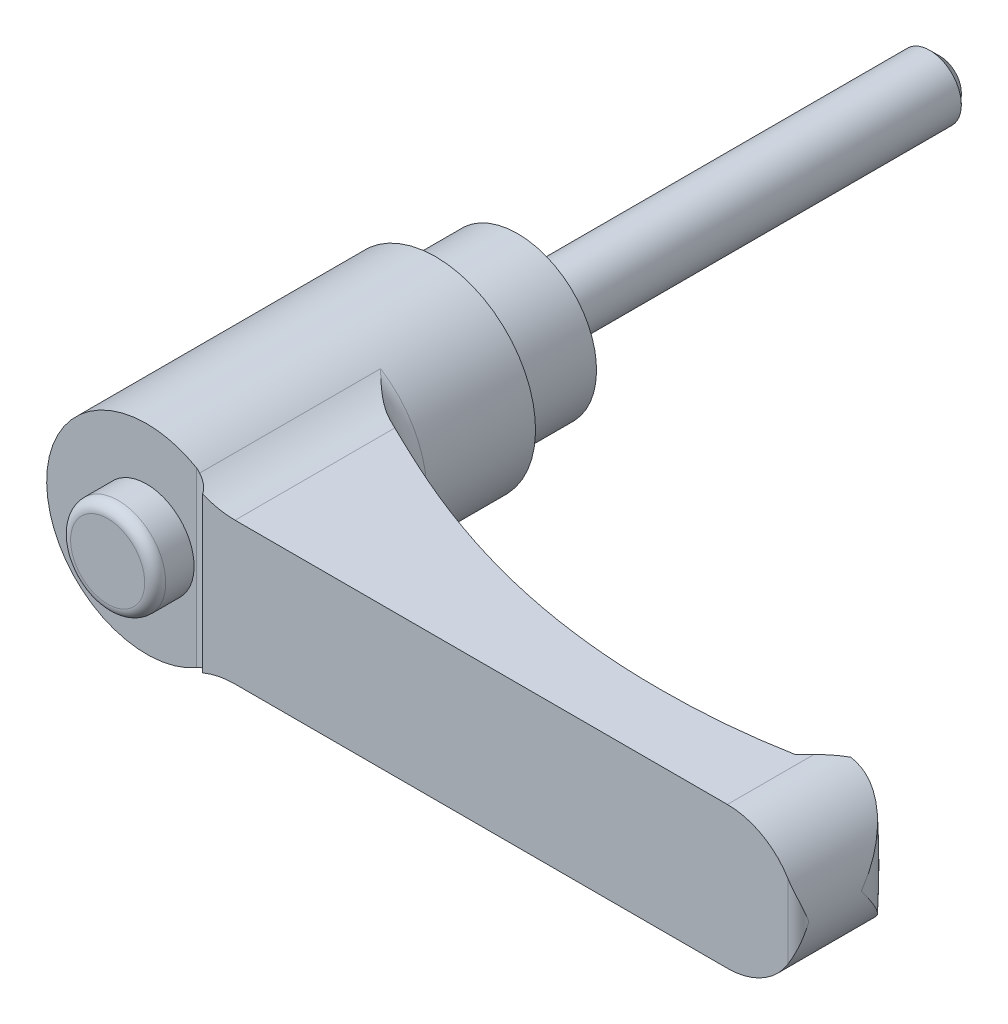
ISO-10303-21;
HEADER;
FILE_DESCRIPTION(('STEP AP214'),'2;1');
FILE_NAME('part.step','',(''),(''),'','','');
FILE_SCHEMA(('AUTOMOTIVE_DESIGN { 1 0 10303 214 1 1 1 1 }'));
ENDSEC;
DATA;
#1=APPLICATION_CONTEXT('core data for automotive mechanical design processes');
#2=APPLICATION_PROTOCOL_DEFINITION('international standard','automotive_design',2000,#1);
#3=PRODUCT_CONTEXT('',#1,'mechanical');
#4=PRODUCT('Part','Part','',(#3));
#5=PRODUCT_RELATED_PRODUCT_CATEGORY('part','',(#4));
#6=PRODUCT_DEFINITION_FORMATION('','',#4);
#7=PRODUCT_DEFINITION_CONTEXT('part definition',#1,'design');
#8=PRODUCT_DEFINITION('design','',#6,#7);
#9=PRODUCT_DEFINITION_SHAPE('','',#8);
#10=(LENGTH_UNIT() NAMED_UNIT(*) SI_UNIT(.MILLI.,.METRE.));
#11=(NAMED_UNIT(*) PLANE_ANGLE_UNIT() SI_UNIT($,.RADIAN.));
#12=(NAMED_UNIT(*) SI_UNIT($,.STERADIAN.) SOLID_ANGLE_UNIT());
#13=UNCERTAINTY_MEASURE_WITH_UNIT(LENGTH_MEASURE(1.E-05),#10,'distance_accuracy_value','');
#14=(GEOMETRIC_REPRESENTATION_CONTEXT(3) GLOBAL_UNCERTAINTY_ASSIGNED_CONTEXT((#13)) GLOBAL_UNIT_ASSIGNED_CONTEXT((#10,
#11,#12)) REPRESENTATION_CONTEXT('',''));
#15=CARTESIAN_POINT('',(0.,0.,0.));
#16=DIRECTION('',(0.,0.,1.));
#17=DIRECTION('',(1.,0.,0.));
#18=AXIS2_PLACEMENT_3D('',#15,#16,#17);
#19=CARTESIAN_POINT('',(6.,0.,0.));
#20=DIRECTION('',(0.,0.,1.));
#21=DIRECTION('',(0.,-1.,0.));
#22=AXIS2_PLACEMENT_3D('',#19,#20,#21);
#23=PLANE('',#22);
#24=CARTESIAN_POINT('',(0.,0.,0.));
#25=DIRECTION('',(0.,0.,-1.));
#26=DIRECTION('',(0.,1.,0.));
#27=AXIS2_PLACEMENT_3D('',#24,#25,#26);
#28=CIRCLE('',#27,3.);
#29=CARTESIAN_POINT('',(0.,3.,0.));
#30=VERTEX_POINT('',#29);
#31=EDGE_CURVE('E423',#30,#30,#28,.T.);
#32=ORIENTED_EDGE('',*,*,#31,.F.);
#33=EDGE_LOOP('',(#32));
#34=FACE_BOUND('',#33,.T.);
#35=CARTESIAN_POINT('',(0.,0.,0.));
#36=DIRECTION('',(0.,0.,-1.));
#37=DIRECTION('',(0.,1.,0.));
#38=AXIS2_PLACEMENT_3D('',#35,#36,#37);
#39=CIRCLE('',#38,6.);
#40=CARTESIAN_POINT('',(0.,6.,0.));
#41=VERTEX_POINT('',#40);
#42=EDGE_CURVE('E347',#41,#41,#39,.T.);
#43=ORIENTED_EDGE('',*,*,#42,.T.);
#44=EDGE_LOOP('',(#43));
#45=FACE_BOUND('',#44,.T.);
#46=ADVANCED_FACE('F14',(#34,#45),#23,.F.);
#47=CARTESIAN_POINT('',(0.,0.,35.5));
#48=DIRECTION('',(0.,0.,-1.));
#49=DIRECTION('',(0.,1.,0.));
#50=AXIS2_PLACEMENT_3D('',#47,#48,#49);
#51=PLANE('',#50);
#52=CARTESIAN_POINT('',(0.,0.,35.5));
#53=DIRECTION('',(0.,0.,-1.));
#54=DIRECTION('',(0.,1.,0.));
#55=AXIS2_PLACEMENT_3D('',#52,#53,#54);
#56=CIRCLE('',#55,9.5);
#57=CARTESIAN_POINT('',(4.75,-8.22724133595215,35.5));
#58=VERTEX_POINT('',#57);
#59=CARTESIAN_POINT('',(4.75,8.22724133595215,35.5));
#60=VERTEX_POINT('',#59);
#61=EDGE_CURVE('E332',#58,#60,#56,.T.);
#62=ORIENTED_EDGE('',*,*,#61,.F.);
#63=DIRECTION('',(0.,1.,0.));
#64=VECTOR('',#63,1.);
#65=CARTESIAN_POINT('',(4.75,-13.5,35.5));
#66=LINE('',#65,#64);
#67=EDGE_CURVE('E383',#58,#60,#66,.T.);
#68=ORIENTED_EDGE('',*,*,#67,.T.);
#69=EDGE_LOOP('',(#62,#68));
#70=FACE_BOUND('',#69,.T.);
#71=CARTESIAN_POINT('',(0.,0.,35.5));
#72=DIRECTION('',(0.,0.,-1.));
#73=DIRECTION('',(0.,1.,0.));
#74=AXIS2_PLACEMENT_3D('',#71,#72,#73);
#75=CIRCLE('',#74,4.52380952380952);
#76=CARTESIAN_POINT('',(0.,4.52380952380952,35.5));
#77=VERTEX_POINT('',#76);
#78=EDGE_CURVE('E183',#77,#77,#75,.F.);
#79=ORIENTED_EDGE('',*,*,#78,.F.);
#80=EDGE_LOOP('',(#79));
#81=FACE_BOUND('',#80,.T.);
#82=ADVANCED_FACE('F158',(#70,#81),#51,.F.);
#83=CARTESIAN_POINT('',(56.25,0.,0.));
#84=DIRECTION('',(0.,0.,1.));
#85=DIRECTION('',(0.,-1.,0.));
#86=AXIS2_PLACEMENT_3D('',#83,#84,#85);
#87=CYLINDRICAL_SURFACE('',#86,6.75);
#88=CARTESIAN_POINT('',(63.,0.,30.5));
#89=CARTESIAN_POINT('',(63.0000000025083,-0.0046874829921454,30.4965903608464));
#90=CARTESIAN_POINT('',(62.9999951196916,-0.0093750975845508,30.4931806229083));
#91=CARTESIAN_POINT('',(62.9990237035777,-0.475524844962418,30.1541065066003));
#92=CARTESIAN_POINT('',(62.9507141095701,-0.938185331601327,29.8175642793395));
#93=CARTESIAN_POINT('',(62.8060463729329,-1.62346497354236,29.3225480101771));
#94=CARTESIAN_POINT('',(62.7456147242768,-1.85084323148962,29.1588881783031));
#95=CARTESIAN_POINT('',(62.6000044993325,-2.30127271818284,28.8365968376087));
#96=CARTESIAN_POINT('',(62.5148384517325,-2.52432607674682,28.6779628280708));
#97=CARTESIAN_POINT('',(62.344804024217,-2.90644000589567,28.4087021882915));
#98=CARTESIAN_POINT('',(62.2657268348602,-3.06692788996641,28.2964051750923));
#99=CARTESIAN_POINT('',(62.0934111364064,-3.38371909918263,28.0768184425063));
#100=CARTESIAN_POINT('',(62.0001726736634,-3.5400224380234,27.9695287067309));
#101=CARTESIAN_POINT('',(61.7993668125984,-3.84715615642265,27.7614384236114));
#102=CARTESIAN_POINT('',(61.6918275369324,-3.99799655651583,27.6606257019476));
#103=CARTESIAN_POINT('',(61.4620426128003,-4.29326696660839,27.4668757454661));
#104=CARTESIAN_POINT('',(61.3398014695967,-4.43769892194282,27.3739361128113));
#105=CARTESIAN_POINT('',(61.0188552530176,-4.78536684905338,27.1560724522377));
#106=CARTESIAN_POINT('',(60.8112818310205,-4.9842025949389,27.0367418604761));
#107=CARTESIAN_POINT('',(60.4758984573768,-5.26551240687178,26.8795376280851));
#108=CARTESIAN_POINT('',(60.3601030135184,-5.35645651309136,26.8307690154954));
#109=CARTESIAN_POINT('',(60.1206554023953,-5.53195453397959,26.7416778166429));
#110=CARTESIAN_POINT('',(59.997005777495,-5.61651049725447,26.7013525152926));
#111=CARTESIAN_POINT('',(59.7699445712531,-5.76076929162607,26.6381973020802));
#112=CARTESIAN_POINT('',(59.667954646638,-5.82188686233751,26.6134697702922));
#113=CARTESIAN_POINT('',(59.4598154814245,-5.93917869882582,26.5707512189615));
#114=CARTESIAN_POINT('',(59.3536672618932,-5.99535416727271,26.5527585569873));
#115=CARTESIAN_POINT('',(59.1377410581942,-6.10229132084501,26.5242546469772));
#116=CARTESIAN_POINT('',(59.0279645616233,-6.15305518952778,26.5137403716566));
#117=CARTESIAN_POINT('',(58.8054681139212,-6.24873887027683,26.5009304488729));
#118=CARTESIAN_POINT('',(58.6927495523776,-6.29366138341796,26.4986309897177));
#119=CARTESIAN_POINT('',(58.4641163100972,-6.37770798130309,26.502966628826));
#120=CARTESIAN_POINT('',(58.3481815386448,-6.41677354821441,26.5096859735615));
#121=CARTESIAN_POINT('',(58.1152313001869,-6.48831686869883,26.5328398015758));
#122=CARTESIAN_POINT('',(57.9982157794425,-6.52079429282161,26.5492747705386));
#123=CARTESIAN_POINT('',(57.7644328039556,-6.57901960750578,26.5923251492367));
#124=CARTESIAN_POINT('',(57.6476652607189,-6.60477054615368,26.618935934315));
#125=CARTESIAN_POINT('',(57.41573023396,-6.64962508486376,26.6826067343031));
#126=CARTESIAN_POINT('',(57.3005622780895,-6.66873068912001,26.7196635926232));
#127=CARTESIAN_POINT('',(57.104290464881,-6.69624244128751,26.7926929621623));
#128=CARTESIAN_POINT('',(57.0224673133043,-6.70614558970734,26.8262017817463));
#129=CARTESIAN_POINT('',(56.8609556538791,-6.72278366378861,26.8986767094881));
#130=CARTESIAN_POINT('',(56.781266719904,-6.72951922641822,26.9376417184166));
#131=CARTESIAN_POINT('',(56.624433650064,-6.74006528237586,27.0209540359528));
#132=CARTESIAN_POINT('',(56.5472927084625,-6.74387222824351,27.0653077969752));
#133=CARTESIAN_POINT('',(56.3961054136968,-6.74884425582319,27.1591719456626));
#134=CARTESIAN_POINT('',(56.3220596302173,-6.75000885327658,27.2086832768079));
#135=CARTESIAN_POINT('',(56.2498,-6.74999999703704,27.2606710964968));
#136=B_SPLINE_CURVE_WITH_KNOTS('',3,(#88,#89,#90,#91,#92,#93,#94,#95,#96,#97,#98,#99,#100,#101,
#102,#103,#104,#105,#106,#107,#108,#109,#110,#111,#112,#113,#114,#115,#116,#117,#118,#119,#120,
#121,#122,#123,#124,#125,#126,#127,#128,#129,#130,#131,#132,#133,#134,#135),.UNSPECIFIED.,.F.,
.F.,(4,2,2,2,2,2,2,2,2,2,2,2,2,2,2,2,2,2,2,2,2,2,2,4),(0.,0.0173896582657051,1.7292315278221,
2.5882674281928,3.44686895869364,4.08007105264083,4.71327107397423,5.34524382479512,
5.97702340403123,6.9068284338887,7.37170994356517,7.83644173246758,8.20045511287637,
8.56437966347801,8.92815681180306,9.29176514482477,9.65879376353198,10.0258407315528,
10.3927210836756,10.7594906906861,11.0261722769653,11.2928002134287,11.5597506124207,
11.8267499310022),.UNSPECIFIED.);
#137=CARTESIAN_POINT('',(58.6622222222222,-6.30425919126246,26.5));
#138=VERTEX_POINT('',#137);
#139=CARTESIAN_POINT('',(63.,0.,30.5));
#140=VERTEX_POINT('',#139);
#141=EDGE_CURVE('E126',#138,#140,#136,.F.);
#142=ORIENTED_EDGE('',*,*,#141,.T.);
#143=CARTESIAN_POINT('',(63.,0.,30.5));
#144=CARTESIAN_POINT('',(63.0000000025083,0.00468748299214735,30.4965903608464));
#145=CARTESIAN_POINT('',(62.9999951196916,0.00937509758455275,30.4931806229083));
#146=CARTESIAN_POINT('',(62.9990237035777,0.47552484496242,30.1541065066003));
#147=CARTESIAN_POINT('',(62.9507141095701,0.938185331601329,29.8175642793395));
#148=CARTESIAN_POINT('',(62.8060463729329,1.62346497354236,29.3225480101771));
#149=CARTESIAN_POINT('',(62.7456147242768,1.85084323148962,29.1588881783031));
#150=CARTESIAN_POINT('',(62.6000044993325,2.30127271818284,28.8365968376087));
#151=CARTESIAN_POINT('',(62.5148384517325,2.52432607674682,28.6779628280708));
#152=CARTESIAN_POINT('',(62.344804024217,2.90644000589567,28.4087021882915));
#153=CARTESIAN_POINT('',(62.2657268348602,3.06692788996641,28.2964051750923));
#154=CARTESIAN_POINT('',(62.0934111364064,3.38371909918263,28.0768184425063));
#155=CARTESIAN_POINT('',(62.0001726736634,3.5400224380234,27.9695287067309));
#156=CARTESIAN_POINT('',(61.7993668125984,3.84715615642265,27.7614384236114));
#157=CARTESIAN_POINT('',(61.6918275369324,3.99799655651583,27.6606257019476));
#158=CARTESIAN_POINT('',(61.4620426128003,4.29326696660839,27.4668757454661));
#159=CARTESIAN_POINT('',(61.3398014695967,4.43769892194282,27.3739361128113));
#160=CARTESIAN_POINT('',(61.0188552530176,4.78536684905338,27.1560724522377));
#161=CARTESIAN_POINT('',(60.8112818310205,4.9842025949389,27.0367418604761));
#162=CARTESIAN_POINT('',(60.4758984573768,5.26551240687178,26.8795376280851));
#163=CARTESIAN_POINT('',(60.3601030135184,5.35645651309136,26.8307690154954));
#164=CARTESIAN_POINT('',(60.1206554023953,5.53195453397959,26.7416778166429));
#165=CARTESIAN_POINT('',(59.997005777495,5.61651049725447,26.7013525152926));
#166=CARTESIAN_POINT('',(59.7699445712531,5.76076929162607,26.6381973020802));
#167=CARTESIAN_POINT('',(59.667954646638,5.82188686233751,26.6134697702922));
#168=CARTESIAN_POINT('',(59.4598154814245,5.93917869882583,26.5707512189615));
#169=CARTESIAN_POINT('',(59.3536672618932,5.99535416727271,26.5527585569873));
#170=CARTESIAN_POINT('',(59.1377410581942,6.10229132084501,26.5242546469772));
#171=CARTESIAN_POINT('',(59.0279645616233,6.15305518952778,26.5137403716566));
#172=CARTESIAN_POINT('',(58.8054681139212,6.24873887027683,26.5009304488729));
#173=CARTESIAN_POINT('',(58.6927495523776,6.29366138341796,26.4986309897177));
#174=CARTESIAN_POINT('',(58.4641163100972,6.37770798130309,26.502966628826));
#175=CARTESIAN_POINT('',(58.3481815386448,6.41677354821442,26.5096859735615));
#176=CARTESIAN_POINT('',(58.1152313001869,6.48831686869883,26.5328398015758));
#177=CARTESIAN_POINT('',(57.9982157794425,6.52079429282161,26.5492747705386));
#178=CARTESIAN_POINT('',(57.7644328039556,6.57901960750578,26.5923251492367));
#179=CARTESIAN_POINT('',(57.6476652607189,6.60477054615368,26.618935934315));
#180=CARTESIAN_POINT('',(57.41573023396,6.64962508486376,26.6826067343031));
#181=CARTESIAN_POINT('',(57.3005622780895,6.66873068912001,26.7196635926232));
#182=CARTESIAN_POINT('',(57.1042904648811,6.69624244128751,26.7926929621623));
#183=CARTESIAN_POINT('',(57.0224673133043,6.70614558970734,26.8262017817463));
#184=CARTESIAN_POINT('',(56.8609556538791,6.72278366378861,26.8986767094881));
#185=CARTESIAN_POINT('',(56.781266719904,6.72951922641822,26.9376417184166));
#186=CARTESIAN_POINT('',(56.624433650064,6.74006528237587,27.0209540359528));
#187=CARTESIAN_POINT('',(56.5472927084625,6.74387222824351,27.0653077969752));
#188=CARTESIAN_POINT('',(56.3961054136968,6.74884425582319,27.1591719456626));
#189=CARTESIAN_POINT('',(56.3220596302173,6.75000885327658,27.2086832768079));
#190=CARTESIAN_POINT('',(56.2498,6.74999999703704,27.2606710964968));
#191=B_SPLINE_CURVE_WITH_KNOTS('',3,(#143,#144,#145,#146,#147,#148,#149,#150,#151,#152,#153,
#154,#155,#156,#157,#158,#159,#160,#161,#162,#163,#164,#165,#166,#167,#168,#169,#170,#171,#172,
#173,#174,#175,#176,#177,#178,#179,#180,#181,#182,#183,#184,#185,#186,#187,#188,#189,#190),
.UNSPECIFIED.,.F.,.F.,(4,2,2,2,2,2,2,2,2,2,2,2,2,2,2,2,2,2,2,2,2,2,2,4),(0.,0.0173896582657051,
1.7292315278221,2.5882674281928,3.44686895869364,4.08007105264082,4.71327107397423,
5.34524382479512,5.97702340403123,6.9068284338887,7.37170994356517,7.83644173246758,
8.20045511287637,8.56437966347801,8.92815681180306,9.29176514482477,9.65879376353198,
10.0258407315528,10.3927210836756,10.7594906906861,11.0261722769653,11.2928002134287,
11.5597506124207,11.8267499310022),.UNSPECIFIED.);
#192=CARTESIAN_POINT('',(58.6622222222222,6.30425919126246,26.5));
#193=VERTEX_POINT('',#192);
#194=EDGE_CURVE('E123',#140,#193,#191,.T.);
#195=ORIENTED_EDGE('',*,*,#194,.T.);
#196=CARTESIAN_POINT('',(56.25,0.,26.5));
#197=DIRECTION('',(0.,0.,-1.));
#198=DIRECTION('',(0.,1.,0.));
#199=AXIS2_PLACEMENT_3D('',#196,#197,#198);
#200=CIRCLE('',#199,6.75);
#201=CARTESIAN_POINT('',(58.,6.51920240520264,26.5));
#202=VERTEX_POINT('',#201);
#203=EDGE_CURVE('E308',#193,#202,#200,.F.);
#204=ORIENTED_EDGE('',*,*,#203,.T.);
#205=CARTESIAN_POINT('',(56.25,0.,28.25));
#206=DIRECTION('',(-0.707106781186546,0.,-0.70710678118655));
#207=DIRECTION('',(-0.70710678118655,0.,0.707106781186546));
#208=AXIS2_PLACEMENT_3D('',#205,#206,#207);
#209=ELLIPSE('',#208,9.54594154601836,6.75);
#210=CARTESIAN_POINT('',(56.25,6.75,28.25));
#211=VERTEX_POINT('',#210);
#212=EDGE_CURVE('E374',#202,#211,#209,.F.);
#213=ORIENTED_EDGE('',*,*,#212,.T.);
#214=DIRECTION('',(0.,0.,1.));
#215=VECTOR('',#214,1.);
#216=CARTESIAN_POINT('',(56.25,6.75,0.));
#217=LINE('',#216,#215);
#218=CARTESIAN_POINT('',(56.25,6.75,36.5));
#219=VERTEX_POINT('',#218);
#220=EDGE_CURVE('E330',#211,#219,#217,.T.);
#221=ORIENTED_EDGE('',*,*,#220,.T.);
#222=CARTESIAN_POINT('',(56.25,0.,36.5));
#223=DIRECTION('',(0.,0.,1.));
#224=DIRECTION('',(0.,-1.,0.));
#225=AXIS2_PLACEMENT_3D('',#222,#223,#224);
#226=CIRCLE('',#225,6.75);
#227=CARTESIAN_POINT('',(62.,3.53553390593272,36.5));
#228=VERTEX_POINT('',#227);
#229=EDGE_CURVE('E322',#228,#219,#226,.T.);
#230=ORIENTED_EDGE('',*,*,#229,.F.);
#231=CARTESIAN_POINT('',(62.,3.53553390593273,36.5));
#232=CARTESIAN_POINT('',(62.0299932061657,3.48675666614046,36.4999933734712));
#233=CARTESIAN_POINT('',(62.0593538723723,3.43761273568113,36.4986515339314));
#234=CARTESIAN_POINT('',(62.1167538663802,3.33870692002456,36.4935798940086));
#235=CARTESIAN_POINT('',(62.1447937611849,3.28894531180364,36.489851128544));
#236=CARTESIAN_POINT('',(62.2267562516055,3.13908056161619,36.4755285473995));
#237=CARTESIAN_POINT('',(62.2786643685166,3.03816514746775,36.4617957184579));
#238=CARTESIAN_POINT('',(62.3766467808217,2.83536966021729,36.4277987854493));
#239=CARTESIAN_POINT('',(62.4227515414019,2.73349792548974,36.4075709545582));
#240=CARTESIAN_POINT('',(62.509502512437,2.52854152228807,36.3618646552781));
#241=CARTESIAN_POINT('',(62.550144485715,2.42545597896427,36.3363821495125));
#242=CARTESIAN_POINT('',(62.6493297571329,2.15471359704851,36.2642737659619));
#243=CARTESIAN_POINT('',(62.7035065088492,1.98634279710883,36.2142841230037));
#244=CARTESIAN_POINT('',(62.7980553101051,1.64812969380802,36.1068184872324));
#245=CARTESIAN_POINT('',(62.8384218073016,1.4782868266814,36.0493394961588));
#246=CARTESIAN_POINT('',(62.9057483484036,1.1374266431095,35.9293690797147));
#247=CARTESIAN_POINT('',(62.9326868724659,0.966407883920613,35.8668697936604));
#248=CARTESIAN_POINT('',(62.9733111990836,0.623942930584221,35.7390768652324));
#249=CARTESIAN_POINT('',(62.9870036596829,0.452496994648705,35.6737846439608));
#250=CARTESIAN_POINT('',(62.997837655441,0.192449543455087,35.5740662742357));
#251=CARTESIAN_POINT('',(62.999781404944,0.103891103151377,35.539987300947));
#252=CARTESIAN_POINT('',(62.9999941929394,0.0102233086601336,35.5039349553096));
#253=CARTESIAN_POINT('',(62.9999999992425,0.00511164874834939,35.5019674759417));
#254=CARTESIAN_POINT('',(63.,0.,35.5));
#255=B_SPLINE_CURVE_WITH_KNOTS('',3,(#231,#232,#233,#234,#235,#236,#237,#238,#239,#240,#241,
#242,#243,#244,#245,#246,#247,#248,#249,#250,#251,#252,#253,#254),.UNSPECIFIED.,.F.,.F.,(4,2,2,
2,2,2,2,2,2,2,2,4),(0.,0.171732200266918,0.343389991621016,0.685890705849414,1.02651095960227,
1.36739390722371,1.91796289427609,2.46875297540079,3.02042294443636,3.57181547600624,
3.85648313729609,3.87291482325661),.UNSPECIFIED.);
#256=CARTESIAN_POINT('',(63.,0.,35.5));
#257=VERTEX_POINT('',#256);
#258=EDGE_CURVE('E169',#257,#228,#255,.F.);
#259=ORIENTED_EDGE('',*,*,#258,.F.);
#260=CARTESIAN_POINT('',(62.,-3.53553390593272,36.5));
#261=CARTESIAN_POINT('',(62.0299932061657,-3.48675666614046,36.4999933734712));
#262=CARTESIAN_POINT('',(62.0593538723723,-3.43761273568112,36.4986515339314));
#263=CARTESIAN_POINT('',(62.1167538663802,-3.33870692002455,36.4935798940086));
#264=CARTESIAN_POINT('',(62.1447937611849,-3.28894531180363,36.489851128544));
#265=CARTESIAN_POINT('',(62.2267562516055,-3.13908056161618,36.4755285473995));
#266=CARTESIAN_POINT('',(62.2786643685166,-3.03816514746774,36.4617957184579));
#267=CARTESIAN_POINT('',(62.3766467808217,-2.83536966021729,36.4277987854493));
#268=CARTESIAN_POINT('',(62.4227515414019,-2.73349792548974,36.4075709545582));
#269=CARTESIAN_POINT('',(62.509502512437,-2.52854152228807,36.3618646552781));
#270=CARTESIAN_POINT('',(62.550144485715,-2.42545597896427,36.3363821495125));
#271=CARTESIAN_POINT('',(62.6493297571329,-2.15471359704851,36.2642737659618));
#272=CARTESIAN_POINT('',(62.7035065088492,-1.98634279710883,36.2142841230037));
#273=CARTESIAN_POINT('',(62.7980553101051,-1.64812969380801,36.1068184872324));
#274=CARTESIAN_POINT('',(62.8384218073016,-1.4782868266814,36.0493394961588));
#275=CARTESIAN_POINT('',(62.9057483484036,-1.1374266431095,35.9293690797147));
#276=CARTESIAN_POINT('',(62.9326868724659,-0.966407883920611,35.8668697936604));
#277=CARTESIAN_POINT('',(62.9733111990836,-0.623942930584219,35.7390768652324));
#278=CARTESIAN_POINT('',(62.9870036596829,-0.452496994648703,35.6737846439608));
#279=CARTESIAN_POINT('',(62.997837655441,-0.192449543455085,35.5740662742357));
#280=CARTESIAN_POINT('',(62.999781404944,-0.103891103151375,35.539987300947));
#281=CARTESIAN_POINT('',(62.9999941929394,-0.0102233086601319,35.5039349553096));
#282=CARTESIAN_POINT('',(62.9999999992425,-0.00511164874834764,35.5019674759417));
#283=CARTESIAN_POINT('',(63.,0.,35.5));
#284=B_SPLINE_CURVE_WITH_KNOTS('',3,(#260,#261,#262,#263,#264,#265,#266,#267,#268,#269,#270,
#271,#272,#273,#274,#275,#276,#277,#278,#279,#280,#281,#282,#283),.UNSPECIFIED.,.F.,.F.,(4,2,2,
2,2,2,2,2,2,2,2,4),(0.,0.171732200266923,0.34338999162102,0.685890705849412,1.02651095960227,
1.36739390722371,1.91796289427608,2.46875297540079,3.02042294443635,3.57181547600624,
3.85648313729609,3.8729148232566),.UNSPECIFIED.);
#285=CARTESIAN_POINT('',(62.,-3.53553390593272,36.5));
#286=VERTEX_POINT('',#285);
#287=EDGE_CURVE('E177',#286,#257,#284,.T.);
#288=ORIENTED_EDGE('',*,*,#287,.F.);
#289=CARTESIAN_POINT('',(56.25,-6.75,36.5));
#290=VERTEX_POINT('',#289);
#291=EDGE_CURVE('E310',#290,#286,#226,.T.);
#292=ORIENTED_EDGE('',*,*,#291,.F.);
#293=DIRECTION('',(0.,0.,1.));
#294=VECTOR('',#293,1.);
#295=CARTESIAN_POINT('',(56.25,-6.75,0.));
#296=LINE('',#295,#294);
#297=CARTESIAN_POINT('',(56.25,-6.75,28.25));
#298=VERTEX_POINT('',#297);
#299=EDGE_CURVE('E355',#298,#290,#296,.T.);
#300=ORIENTED_EDGE('',*,*,#299,.F.);
#301=CARTESIAN_POINT('',(58.,-6.51920240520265,26.5));
#302=VERTEX_POINT('',#301);
#303=EDGE_CURVE('E375',#298,#302,#209,.F.);
#304=ORIENTED_EDGE('',*,*,#303,.T.);
#305=EDGE_CURVE('E134',#302,#138,#200,.F.);
#306=ORIENTED_EDGE('',*,*,#305,.T.);
#307=EDGE_LOOP('',(#142,#195,#204,#213,#221,#230,#259,#288,#292,#300,#304,#306));
#308=FACE_BOUND('',#307,.T.);
#309=ADVANCED_FACE('F132',(#308),#87,.T.);
#310=CARTESIAN_POINT('',(59.,-13.5,26.5));
#311=DIRECTION('',(0.,0.,-1.));
#312=DIRECTION('',(0.,1.,0.));
#313=AXIS2_PLACEMENT_3D('',#310,#311,#312);
#314=PLANE('',#313);
#315=ORIENTED_EDGE('',*,*,#203,.F.);
#316=CARTESIAN_POINT('',(0.,0.,26.5));
#317=DIRECTION('',(0.,0.,-1.));
#318=DIRECTION('',(0.,1.,0.));
#319=AXIS2_PLACEMENT_3D('',#316,#317,#318);
#320=CIRCLE('',#319,59.);
#321=EDGE_CURVE('E37',#193,#138,#320,.T.);
#322=ORIENTED_EDGE('',*,*,#321,.T.);
#323=ORIENTED_EDGE('',*,*,#305,.F.);
#324=DIRECTION('',(0.,1.,0.));
#325=VECTOR('',#324,1.);
#326=CARTESIAN_POINT('',(58.,-13.5,26.5));
#327=LINE('',#326,#325);
#328=EDGE_CURVE('E327',#302,#202,#327,.T.);
#329=ORIENTED_EDGE('',*,*,#328,.T.);
#330=EDGE_LOOP('',(#315,#322,#323,#329));
#331=FACE_BOUND('',#330,.T.);
#332=ADVANCED_FACE('F157',(#331),#314,.T.);
#333=CARTESIAN_POINT('',(0.,0.,36.5));
#334=DIRECTION('',(0.,0.,1.));
#335=DIRECTION('',(0.,-1.,0.));
#336=AXIS2_PLACEMENT_3D('',#333,#334,#335);
#337=PLANE('',#336);
#338=CARTESIAN_POINT('',(9.41740410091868,14.75,36.5));
#339=DIRECTION('',(0.,0.,1.));
#340=DIRECTION('',(1.,0.,0.));
#341=AXIS2_PLACEMENT_3D('',#338,#339,#340);
#342=CIRCLE('',#341,8.);
#343=CARTESIAN_POINT('',(6.33333333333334,7.36836688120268,36.5));
#344=VERTEX_POINT('',#343);
#345=CARTESIAN_POINT('',(9.41740410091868,6.75,36.5));
#346=VERTEX_POINT('',#345);
#347=EDGE_CURVE('E369',#344,#346,#342,.T.);
#348=ORIENTED_EDGE('',*,*,#347,.F.);
#349=DIRECTION('',(0.,1.,0.));
#350=VECTOR('',#349,1.);
#351=CARTESIAN_POINT('',(6.33333333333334,-13.5,36.5));
#352=LINE('',#351,#350);
#353=CARTESIAN_POINT('',(6.33333333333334,-7.36836688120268,36.5));
#354=VERTEX_POINT('',#353);
#355=EDGE_CURVE('E326',#354,#344,#352,.T.);
#356=ORIENTED_EDGE('',*,*,#355,.F.);
#357=CARTESIAN_POINT('',(9.41740410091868,-14.75,36.5));
#358=DIRECTION('',(0.,0.,1.));
#359=DIRECTION('',(1.,0.,0.));
#360=AXIS2_PLACEMENT_3D('',#357,#358,#359);
#361=CIRCLE('',#360,8.);
#362=CARTESIAN_POINT('',(9.41740410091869,-6.75,36.5));
#363=VERTEX_POINT('',#362);
#364=EDGE_CURVE('E361',#363,#354,#361,.T.);
#365=ORIENTED_EDGE('',*,*,#364,.F.);
#366=DIRECTION('',(-1.,0.,0.));
#367=VECTOR('',#366,1.);
#368=CARTESIAN_POINT('',(56.25,-6.75,36.5));
#369=LINE('',#368,#367);
#370=EDGE_CURVE('E364',#290,#363,#369,.T.);
#371=ORIENTED_EDGE('',*,*,#370,.F.);
#372=ORIENTED_EDGE('',*,*,#291,.T.);
#373=DIRECTION('',(0.,1.,0.));
#374=VECTOR('',#373,1.);
#375=CARTESIAN_POINT('',(62.,-13.5,36.5));
#376=LINE('',#375,#374);
#377=EDGE_CURVE('E315',#286,#228,#376,.T.);
#378=ORIENTED_EDGE('',*,*,#377,.T.);
#379=ORIENTED_EDGE('',*,*,#229,.T.);
#380=DIRECTION('',(1.,0.,0.));
#381=VECTOR('',#380,1.);
#382=CARTESIAN_POINT('',(9.41740410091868,6.75,36.5));
#383=LINE('',#382,#381);
#384=EDGE_CURVE('E367',#346,#219,#383,.T.);
#385=ORIENTED_EDGE('',*,*,#384,.F.);
#386=EDGE_LOOP('',(#348,#356,#365,#371,#372,#378,#379,#385));
#387=FACE_BOUND('',#386,.T.);
#388=ADVANCED_FACE('F240',(#387),#337,.T.);
#389=CARTESIAN_POINT('',(0.,0.,0.));
#390=DIRECTION('',(0.,0.,-1.));
#391=DIRECTION('',(0.,1.,0.));
#392=AXIS2_PLACEMENT_3D('',#389,#390,#391);
#393=CYLINDRICAL_SURFACE('',#392,9.5);
#394=CARTESIAN_POINT('',(0.,0.,18.3481601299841));
#395=DIRECTION('',(0.,0.,-1.));
#396=DIRECTION('',(0.,1.,0.));
#397=AXIS2_PLACEMENT_3D('',#394,#395,#396);
#398=CIRCLE('',#397,9.5);
#399=CARTESIAN_POINT('',(5.11230508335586,8.00714285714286,18.3481601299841));
#400=VERTEX_POINT('',#399);
#401=CARTESIAN_POINT('',(5.11230508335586,-8.00714285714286,18.3481601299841));
#402=VERTEX_POINT('',#401);
#403=EDGE_CURVE('E413',#400,#402,#398,.T.);
#404=ORIENTED_EDGE('',*,*,#403,.T.);
#405=DIRECTION('',(0.,0.,1.));
#406=VECTOR('',#405,1.);
#407=CARTESIAN_POINT('',(5.11230508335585,-8.00714285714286,0.));
#408=LINE('',#407,#406);
#409=CARTESIAN_POINT('',(5.11230508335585,-8.00714285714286,35.5614827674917));
#410=VERTEX_POINT('',#409);
#411=EDGE_CURVE('E359',#402,#410,#408,.T.);
#412=ORIENTED_EDGE('',*,*,#411,.T.);
#413=CARTESIAN_POINT('',(4.75,-8.22724133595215,35.5));
#414=CARTESIAN_POINT('',(4.82354897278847,-8.18479174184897,35.5056127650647));
#415=CARTESIAN_POINT('',(4.89626028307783,-8.1414834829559,35.5152432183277));
#416=CARTESIAN_POINT('',(5.03945202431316,-8.05362753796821,35.5421901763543));
#417=CARTESIAN_POINT('',(5.10993308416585,-8.00908020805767,35.5595044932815));
#418=CARTESIAN_POINT('',(5.24861636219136,-7.91889687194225,35.6016146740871));
#419=CARTESIAN_POINT('',(5.31680005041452,-7.87325555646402,35.6264601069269));
#420=CARTESIAN_POINT('',(5.44990684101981,-7.7817124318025,35.6832973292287));
#421=CARTESIAN_POINT('',(5.51483003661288,-7.7358106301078,35.7152889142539));
#422=CARTESIAN_POINT('',(5.69141984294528,-7.6077148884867,35.8145402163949));
#423=CARTESIAN_POINT('',(5.79903338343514,-7.52579740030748,35.8895684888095));
#424=CARTESIAN_POINT('',(5.99917718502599,-7.36722875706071,36.0610902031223));
#425=CARTESIAN_POINT('',(6.09178179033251,-7.29055280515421,36.157471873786));
#426=CARTESIAN_POINT('',(6.20382113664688,-7.19472379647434,36.3011658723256));
#427=CARTESIAN_POINT('',(6.23139044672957,-7.17084441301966,36.33916914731));
#428=CARTESIAN_POINT('',(6.28417716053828,-7.12462925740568,36.4176957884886));
#429=CARTESIAN_POINT('',(6.30939340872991,-7.1022942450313,36.4582203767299));
#430=CARTESIAN_POINT('',(6.33333333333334,-7.08088192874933,36.5));
#431=B_SPLINE_CURVE_WITH_KNOTS('',3,(#413,#414,#415,#416,#417,#418,#419,#420,#421,#422,#423,
#424,#425,#426,#427,#428,#429,#430),.UNSPECIFIED.,.F.,.F.,(4,2,2,2,2,2,2,2,4),(0.,
0.25516766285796,0.510262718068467,0.767074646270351,1.02387922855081,1.48566336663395,
1.94508518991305,2.10299549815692,2.26098294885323),.UNSPECIFIED.);
#432=EDGE_CURVE('E214',#58,#410,#431,.T.);
#433=ORIENTED_EDGE('',*,*,#432,.F.);
#434=ORIENTED_EDGE('',*,*,#61,.T.);
#435=CARTESIAN_POINT('',(6.33333333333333,7.08088192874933,36.5));
#436=CARTESIAN_POINT('',(6.30193651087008,7.10896982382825,36.4452145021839));
#437=CARTESIAN_POINT('',(6.26833956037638,7.13863883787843,36.3925689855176));
#438=CARTESIAN_POINT('',(6.19723055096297,7.20045324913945,36.2916619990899));
#439=CARTESIAN_POINT('',(6.15972345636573,7.23259549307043,36.243395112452));
#440=CARTESIAN_POINT('',(6.08131079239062,7.2986494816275,36.1513438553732));
#441=CARTESIAN_POINT('',(6.04041526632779,7.33255589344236,36.1075470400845));
#442=CARTESIAN_POINT('',(5.95546899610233,7.40171574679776,36.0242830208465));
#443=CARTESIAN_POINT('',(5.91141716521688,7.4369696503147,35.9848173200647));
#444=CARTESIAN_POINT('',(5.7754647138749,7.54368484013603,35.8733623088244));
#445=CARTESIAN_POINT('',(5.67929205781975,7.61650473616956,35.8077657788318));
#446=CARTESIAN_POINT('',(5.47750803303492,7.76289095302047,35.6942705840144));
#447=CARTESIAN_POINT('',(5.37189158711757,7.83645765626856,35.6463815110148));
#448=CARTESIAN_POINT('',(5.1806466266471,7.96370194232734,35.5790108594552));
#449=CARTESIAN_POINT('',(5.09668204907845,8.01772299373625,35.5554125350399));
#450=CARTESIAN_POINT('',(4.92555498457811,8.12398585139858,35.5192948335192));
#451=CARTESIAN_POINT('',(4.83839896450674,8.17623088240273,35.5067542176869));
#452=CARTESIAN_POINT('',(4.75,8.22724133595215,35.5));
#453=B_SPLINE_CURVE_WITH_KNOTS('',3,(#435,#436,#437,#438,#439,#440,#441,#442,#443,#444,#445,
#446,#447,#448,#449,#450,#451,#452),.UNSPECIFIED.,.F.,.F.,(4,2,2,2,2,2,2,2,4),(0.,
0.207163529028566,0.414067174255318,0.620378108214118,0.826760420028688,1.23705708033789,
1.64757566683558,1.9547198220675,2.26127274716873),.UNSPECIFIED.);
#454=CARTESIAN_POINT('',(5.11230508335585,8.00714285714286,35.5614827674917));
#455=VERTEX_POINT('',#454);
#456=EDGE_CURVE('E228',#455,#60,#453,.T.);
#457=ORIENTED_EDGE('',*,*,#456,.F.);
#458=DIRECTION('',(0.,0.,1.));
#459=VECTOR('',#458,1.);
#460=CARTESIAN_POINT('',(5.11230508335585,8.00714285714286,0.));
#461=LINE('',#460,#459);
#462=EDGE_CURVE('E350',#400,#455,#461,.T.);
#463=ORIENTED_EDGE('',*,*,#462,.F.);
#464=EDGE_LOOP('',(#404,#412,#433,#434,#457,#463));
#465=FACE_BOUND('',#464,.T.);
#466=CARTESIAN_POINT('',(0.,0.,8.));
#467=DIRECTION('',(0.,0.,-1.));
#468=DIRECTION('',(0.,1.,0.));
#469=AXIS2_PLACEMENT_3D('',#466,#467,#468);
#470=CIRCLE('',#469,9.5);
#471=CARTESIAN_POINT('',(0.,9.5,8.));
#472=VERTEX_POINT('',#471);
#473=EDGE_CURVE('E333',#472,#472,#470,.T.);
#474=ORIENTED_EDGE('',*,*,#473,.F.);
#475=EDGE_LOOP('',(#474));
#476=FACE_BOUND('',#475,.T.);
#477=ADVANCED_FACE('F238',(#465,#476),#393,.T.);
#478=CARTESIAN_POINT('',(9.41740410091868,14.75,0.));
#479=DIRECTION('',(0.,0.,1.));
#480=DIRECTION('',(0.,-1.,0.));
#481=AXIS2_PLACEMENT_3D('',#478,#479,#480);
#482=CYLINDRICAL_SURFACE('',#481,8.);
#483=DIRECTION('',(0.,0.,1.));
#484=VECTOR('',#483,1.);
#485=CARTESIAN_POINT('',(9.41740410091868,6.75,0.));
#486=LINE('',#485,#484);
#487=CARTESIAN_POINT('',(9.41740410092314,6.75,21.3021638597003));
#488=VERTEX_POINT('',#487);
#489=EDGE_CURVE('E352',#488,#346,#486,.T.);
#490=ORIENTED_EDGE('',*,*,#489,.F.);
#491=CARTESIAN_POINT('',(9.41760410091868,6.7500000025,21.3022609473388));
#492=CARTESIAN_POINT('',(9.34663199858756,6.74999859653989,21.2678090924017));
#493=CARTESIAN_POINT('',(9.27552780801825,6.75094090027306,21.2336266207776));
#494=CARTESIAN_POINT('',(9.13312349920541,6.75473540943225,21.1659081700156));
#495=CARTESIAN_POINT('',(9.06182355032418,6.75758629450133,21.1323717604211));
#496=CARTESIAN_POINT('',(8.91899698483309,6.7652204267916,21.066004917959));
#497=CARTESIAN_POINT('',(8.84747036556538,6.77000369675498,21.0331744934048));
#498=CARTESIAN_POINT('',(8.704162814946,6.78153362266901,20.9682923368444));
#499=CARTESIAN_POINT('',(8.63238174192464,6.78828163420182,20.9362411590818));
#500=CARTESIAN_POINT('',(8.56050869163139,6.79602424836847,20.9046385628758));
#501=B_SPLINE_CURVE_WITH_KNOTS('',3,(#491,#492,#493,#494,#495,#496,#497,#498,#499,#500),
.UNSPECIFIED.,.F.,.F.,(4,2,2,2,4),(0.,0.236671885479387,0.473180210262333,0.709691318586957,
0.946365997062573),.UNSPECIFIED.);
#502=CARTESIAN_POINT('',(8.56096354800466,6.79597525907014,20.9048385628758));
#503=VERTEX_POINT('',#502);
#504=EDGE_CURVE('E246',#488,#503,#501,.T.);
#505=ORIENTED_EDGE('',*,*,#504,.T.);
#506=CARTESIAN_POINT('',(8.56141843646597,6.79592629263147,20.9050385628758));
#507=CARTESIAN_POINT('',(8.47420918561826,6.80531273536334,20.8666951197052));
#508=CARTESIAN_POINT('',(8.38798367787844,6.81604134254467,20.8265142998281));
#509=CARTESIAN_POINT('',(8.21753113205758,6.84002445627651,20.7428900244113));
#510=CARTESIAN_POINT('',(8.13330325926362,6.85327788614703,20.6994479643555));
#511=CARTESIAN_POINT('',(7.88393651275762,6.89653514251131,20.5650030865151));
#512=CARTESIAN_POINT('',(7.72171249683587,6.9300806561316,20.4697011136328));
#513=CARTESIAN_POINT('',(7.40583761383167,7.00533652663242,20.2709379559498));
#514=CARTESIAN_POINT('',(7.25214096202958,7.0469964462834,20.1675294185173));
#515=CARTESIAN_POINT('',(6.95163567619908,7.13786246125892,19.9540740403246));
#516=CARTESIAN_POINT('',(6.80483124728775,7.18707308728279,19.8440232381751));
#517=CARTESIAN_POINT('',(6.52235248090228,7.29074005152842,19.6227797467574));
#518=CARTESIAN_POINT('',(6.38647079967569,7.34497015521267,19.5117441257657));
#519=CARTESIAN_POINT('',(6.12012077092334,7.45966750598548,19.286442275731));
#520=CARTESIAN_POINT('',(5.98965290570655,7.5201353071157,19.1721757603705));
#521=CARTESIAN_POINT('',(5.73356790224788,7.64719834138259,18.9415280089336));
#522=CARTESIAN_POINT('',(5.60795285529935,7.71379617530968,18.825145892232));
#523=CARTESIAN_POINT('',(5.36116691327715,7.853115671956,18.5913699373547));
#524=CARTESIAN_POINT('',(5.23999538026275,7.92583645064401,18.4739762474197));
#525=CARTESIAN_POINT('',(5.11800178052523,8.00350824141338,18.3537764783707));
#526=CARTESIAN_POINT('',(5.11515285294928,8.00532465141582,18.3509683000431));
#527=CARTESIAN_POINT('',(5.11230508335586,8.00714285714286,18.3481601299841));
#528=B_SPLINE_CURVE_WITH_KNOTS('',3,(#506,#507,#508,#509,#510,#511,#512,#513,#514,#515,#516,
#517,#518,#519,#520,#521,#522,#523,#524,#525,#526,#527),.UNSPECIFIED.,.F.,.F.,(4,2,2,2,2,2,2,2,
2,2,4),(0.,0.287104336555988,0.574086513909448,1.14672714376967,1.7159158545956,
2.28544744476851,2.83621563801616,3.38703279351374,3.93808473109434,4.48905724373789,
4.50223731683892),.UNSPECIFIED.);
#529=EDGE_CURVE('E393',#503,#400,#528,.T.);
#530=ORIENTED_EDGE('',*,*,#529,.T.);
#531=ORIENTED_EDGE('',*,*,#462,.T.);
#532=CARTESIAN_POINT('',(6.33333333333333,7.36836688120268,36.5));
#533=CARTESIAN_POINT('',(6.30572631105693,7.37990157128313,36.4517939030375));
#534=CARTESIAN_POINT('',(6.27620115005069,7.39241872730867,36.4049318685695));
#535=CARTESIAN_POINT('',(6.21369042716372,7.41942165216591,36.3142041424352));
#536=CARTESIAN_POINT('',(6.18070621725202,7.433906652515,36.2703372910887));
#537=CARTESIAN_POINT('',(6.11180020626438,7.46478219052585,36.1860768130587));
#538=CARTESIAN_POINT('',(6.07589356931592,7.48116305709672,36.1456672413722));
#539=CARTESIAN_POINT('',(6.001409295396,7.51586753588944,36.0683091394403));
#540=CARTESIAN_POINT('',(5.96283154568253,7.53419123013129,36.0313607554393));
#541=CARTESIAN_POINT('',(5.84377892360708,7.59200134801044,35.9260570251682));
#542=CARTESIAN_POINT('',(5.75985492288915,7.63438377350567,35.8630866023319));
#543=CARTESIAN_POINT('',(5.58613979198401,7.72639161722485,35.7523382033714));
#544=CARTESIAN_POINT('',(5.49634385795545,7.77602300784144,35.7045728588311));
#545=CARTESIAN_POINT('',(5.35683601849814,7.85689272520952,35.6430239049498));
#546=CARTESIAN_POINT('',(5.30809845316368,7.88582630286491,35.6238148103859));
#547=CARTESIAN_POINT('',(5.21035384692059,7.94529574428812,35.5895762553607));
#548=CARTESIAN_POINT('',(5.1613480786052,7.975826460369,35.5745342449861));
#549=CARTESIAN_POINT('',(5.11230508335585,8.00714285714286,35.5614827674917));
#550=B_SPLINE_CURVE_WITH_KNOTS('',3,(#532,#533,#534,#535,#536,#537,#538,#539,#540,#541,#542,
#543,#544,#545,#546,#547,#548,#549),.UNSPECIFIED.,.F.,.F.,(4,2,2,2,2,2,2,2,4),(0.,
0.170139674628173,0.340213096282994,0.50945430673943,0.678702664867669,1.01657399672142,
1.35472528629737,1.53411415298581,1.7129567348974),.UNSPECIFIED.);
#551=EDGE_CURVE('E222',#344,#455,#550,.T.);
#552=ORIENTED_EDGE('',*,*,#551,.F.);
#553=ORIENTED_EDGE('',*,*,#347,.T.);
#554=EDGE_LOOP('',(#490,#505,#530,#531,#552,#553));
#555=FACE_BOUND('',#554,.T.);
#556=ADVANCED_FACE('F234',(#555),#482,.F.);
#557=CARTESIAN_POINT('',(9.41740410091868,6.75,0.));
#558=DIRECTION('',(0.,-1.,0.));
#559=DIRECTION('',(1.,0.,0.));
#560=AXIS2_PLACEMENT_3D('',#557,#558,#559);
#561=PLANE('',#560);
#562=CARTESIAN_POINT('',(43.8904150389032,6.75,-32.7854085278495));
#563=DIRECTION('',(0.,-1.,0.));
#564=DIRECTION('',(1.,0.,0.));
#565=AXIS2_PLACEMENT_3D('',#562,#563,#564);
#566=CIRCLE('',#565,63.);
#567=CARTESIAN_POINT('',(43.630890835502,6.75000000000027,30.2140569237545));
#568=VERTEX_POINT('',#567);
#569=CARTESIAN_POINT('',(55.3333333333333,6.75,29.1666666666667));
#570=VERTEX_POINT('',#569);
#571=EDGE_CURVE('E376',#568,#570,#566,.F.);
#572=ORIENTED_EDGE('',*,*,#571,.F.);
#573=CARTESIAN_POINT('',(31.7211018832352,6.75,29.163677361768));
#574=CARTESIAN_POINT('',(30.4815814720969,6.75,28.9394124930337));
#575=CARTESIAN_POINT('',(29.248337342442,6.75,28.6800208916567));
#576=CARTESIAN_POINT('',(26.798292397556,6.75,28.093381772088));
#577=CARTESIAN_POINT('',(25.5814894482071,6.75,27.7661431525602));
#578=CARTESIAN_POINT('',(23.7726077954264,6.75,27.2275084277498));
#579=CARTESIAN_POINT('',(23.1732161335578,6.75,27.0403034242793));
#580=CARTESIAN_POINT('',(21.9794838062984,6.75,26.6504397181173));
#581=CARTESIAN_POINT('',(21.3851430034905,6.75,26.4477814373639));
#582=CARTESIAN_POINT('',(20.20172109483,6.75,26.027681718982));
#583=CARTESIAN_POINT('',(19.6126399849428,6.75,25.8102402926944));
#584=CARTESIAN_POINT('',(18.4398233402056,6.75,25.3614109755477));
#585=CARTESIAN_POINT('',(17.8560877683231,6.75,25.1300231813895));
#586=CARTESIAN_POINT('',(16.8264520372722,6.75,24.7086305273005));
#587=CARTESIAN_POINT('',(16.3794839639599,6.75,24.5212256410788));
#588=CARTESIAN_POINT('',(15.4885644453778,6.75,24.1393775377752));
#589=CARTESIAN_POINT('',(15.0446130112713,6.75,23.9449342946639));
#590=CARTESIAN_POINT('',(14.1595159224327,6.75,23.5498036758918));
#591=CARTESIAN_POINT('',(13.7183701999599,6.75,23.3491164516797));
#592=CARTESIAN_POINT('',(12.8384969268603,6.75,22.9425083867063));
#593=CARTESIAN_POINT('',(12.3997694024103,6.75,22.7365874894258));
#594=CARTESIAN_POINT('',(11.5213847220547,6.75,22.3195357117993));
#595=CARTESIAN_POINT('',(11.0817393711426,6.75,22.1083800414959));
#596=CARTESIAN_POINT('',(10.2034650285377,6.75,21.6840048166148));
#597=CARTESIAN_POINT('',(9.76483601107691,6.75,21.4707853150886));
#598=CARTESIAN_POINT('',(8.88741279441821,6.75,21.0449308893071));
#599=CARTESIAN_POINT('',(8.4486186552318,6.75,20.832295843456));
#600=CARTESIAN_POINT('',(7.7888040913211,6.75,20.5166390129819));
#601=CARTESIAN_POINT('',(7.56857842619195,6.75,20.4119614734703));
#602=CARTESIAN_POINT('',(7.12729129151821,6.75,20.2043820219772));
#603=CARTESIAN_POINT('',(6.90622982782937,6.75,20.1014800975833));
#604=CARTESIAN_POINT('',(6.48691851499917,6.75,19.9092503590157));
#605=CARTESIAN_POINT('',(6.28878981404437,6.75,19.8196589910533));
#606=CARTESIAN_POINT('',(5.89131318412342,6.75,19.6432260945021));
#607=CARTESIAN_POINT('',(5.69196528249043,6.75,19.5563845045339));
#608=CARTESIAN_POINT('',(5.29178648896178,6.75,19.3863184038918));
#609=CARTESIAN_POINT('',(5.09095599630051,6.75,19.3030929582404));
#610=CARTESIAN_POINT('',(4.68744730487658,6.75,19.1412674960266));
#611=CARTESIAN_POINT('',(4.48476921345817,6.75,19.0626672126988));
#612=CARTESIAN_POINT('',(4.07928382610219,6.75,18.9120884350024));
#613=CARTESIAN_POINT('',(3.87649877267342,6.75,18.8400507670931));
#614=CARTESIAN_POINT('',(3.46854334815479,6.75,18.7031281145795));
#615=CARTESIAN_POINT('',(3.26337283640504,6.75,18.6382435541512));
#616=CARTESIAN_POINT('',(2.64418711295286,6.75,18.4568464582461));
#617=CARTESIAN_POINT('',(2.22603982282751,6.75,18.3534128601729));
#618=CARTESIAN_POINT('',(1.65420364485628,6.75,18.2467177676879));
#619=CARTESIAN_POINT('',(1.50442360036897,6.75,18.2219398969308));
#620=CARTESIAN_POINT('',(1.20392315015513,6.75,18.1790422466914));
#621=CARTESIAN_POINT('',(1.05320291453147,6.75,18.1609212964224));
#622=CARTESIAN_POINT('',(0.751090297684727,6.75,18.1317837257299));
#623=CARTESIAN_POINT('',(0.599697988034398,6.75,18.1207663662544));
#624=CARTESIAN_POINT('',(0.296553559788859,6.75,18.1061196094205));
#625=CARTESIAN_POINT('',(0.144801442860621,6.75,18.1024901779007));
#626=CARTESIAN_POINT('',(-0.159091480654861,6.75,18.1027184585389));
#627=CARTESIAN_POINT('',(-0.311232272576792,6.75,18.1065956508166));
#628=CARTESIAN_POINT('',(-0.615143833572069,6.75,18.121770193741));
#629=CARTESIAN_POINT('',(-0.766914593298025,6.75,18.1330677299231));
#630=CARTESIAN_POINT('',(-1.06969262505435,6.75,18.1627811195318));
#631=CARTESIAN_POINT('',(-1.220700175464,6.75,18.1811941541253));
#632=CARTESIAN_POINT('',(-1.5217232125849,6.75,18.2246820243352));
#633=CARTESIAN_POINT('',(-1.67173881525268,6.75,18.2497560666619));
#634=CARTESIAN_POINT('',(-2.07224275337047,6.75,18.3251477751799));
#635=CARTESIAN_POINT('',(-2.32169003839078,6.75,18.381037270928));
#636=CARTESIAN_POINT('',(-2.81697540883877,6.75,18.507138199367));
#637=CARTESIAN_POINT('',(-3.06281183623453,6.75,18.5773560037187));
#638=CARTESIAN_POINT('',(-3.55135994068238,6.75,18.7293420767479));
#639=CARTESIAN_POINT('',(-3.79406482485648,6.75,18.8111319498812));
#640=CARTESIAN_POINT('',(-4.27623455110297,6.75,18.9835884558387));
#641=CARTESIAN_POINT('',(-4.51569977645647,6.75,19.0742540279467));
#642=CARTESIAN_POINT('',(-4.99367008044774,6.75,19.2630221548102));
#643=CARTESIAN_POINT('',(-5.23215559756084,6.75,19.3611738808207));
#644=CARTESIAN_POINT('',(-5.70695626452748,6.75,19.5625758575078));
#645=CARTESIAN_POINT('',(-5.94327137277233,6.75,19.6658262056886));
#646=CARTESIAN_POINT('',(-6.41402120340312,6.75,19.8759260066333));
#647=CARTESIAN_POINT('',(-6.64845749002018,6.75,19.9827719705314));
#648=CARTESIAN_POINT('',(-7.11612805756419,6.75,20.199046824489));
#649=CARTESIAN_POINT('',(-7.34936235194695,6.75,20.3084756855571));
#650=CARTESIAN_POINT('',(-7.820481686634,6.75,20.5316181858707));
#651=CARTESIAN_POINT('',(-8.05834758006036,6.75,20.6453721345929));
#652=CARTESIAN_POINT('',(-8.53358360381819,6.75,20.8739082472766));
#653=CARTESIAN_POINT('',(-8.77095373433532,6.75,20.9886904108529));
#654=CARTESIAN_POINT('',(-9.48285175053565,6.75,21.3336726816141));
#655=CARTESIAN_POINT('',(-9.95708901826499,6.75,21.5644709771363));
#656=CARTESIAN_POINT('',(-10.904589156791,6.75,22.0230894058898));
#657=CARTESIAN_POINT('',(-11.3778479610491,6.75,22.2509179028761));
#658=CARTESIAN_POINT('',(-12.3264717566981,6.75,22.702156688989));
#659=CARTESIAN_POINT('',(-12.8018367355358,6.75,22.9255670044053));
#660=CARTESIAN_POINT('',(-13.7472574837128,6.75,23.3624658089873));
#661=CARTESIAN_POINT('',(-14.217264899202,6.75,23.5760586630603));
#662=CARTESIAN_POINT('',(-15.160466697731,6.75,23.9960838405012));
#663=CARTESIAN_POINT('',(-15.6336610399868,6.75,24.2025162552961));
#664=CARTESIAN_POINT('',(-16.5835181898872,6.75,24.6072968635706));
#665=CARTESIAN_POINT('',(-17.0601810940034,6.75,24.8056448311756));
#666=CARTESIAN_POINT('',(-18.0170761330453,6.75,25.1935214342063));
#667=CARTESIAN_POINT('',(-18.4973082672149,6.75,25.3830500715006));
#668=CARTESIAN_POINT('',(-19.9446532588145,6.75,25.9379698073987));
#669=CARTESIAN_POINT('',(-20.9172563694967,6.75,26.2891978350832));
#670=CARTESIAN_POINT('',(-22.8764349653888,6.75,26.9503282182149));
#671=CARTESIAN_POINT('',(-23.8630106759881,6.75,27.2602299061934));
#672=CARTESIAN_POINT('',(-25.8434483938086,6.75,27.8346774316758));
#673=CARTESIAN_POINT('',(-26.8372408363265,6.75,28.0994625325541));
#674=CARTESIAN_POINT('',(-28.8357706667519,6.75,28.5839273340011));
#675=CARTESIAN_POINT('',(-29.8405080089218,6.75,28.8036072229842));
#676=CARTESIAN_POINT('',(-31.8589765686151,6.75,29.1964952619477));
#677=CARTESIAN_POINT('',(-32.8727072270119,6.75,29.3697062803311));
#678=CARTESIAN_POINT('',(-34.9071605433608,6.75,29.6686480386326));
#679=CARTESIAN_POINT('',(-35.9278832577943,6.75,29.7943783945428));
#680=CARTESIAN_POINT('',(-37.9963261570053,6.75,29.9997968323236));
#681=CARTESIAN_POINT('',(-39.0441517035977,6.75,30.0784270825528));
#682=CARTESIAN_POINT('',(-41.14239334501,6.75,30.1847467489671));
#683=CARTESIAN_POINT('',(-42.1928094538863,6.75,30.2124358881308));
#684=CARTESIAN_POINT('',(-44.2938118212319,6.75,30.2165051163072));
#685=CARTESIAN_POINT('',(-45.344398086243,6.75,30.1928819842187));
#686=CARTESIAN_POINT('',(-47.4431477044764,6.75,30.0941408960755));
#687=CARTESIAN_POINT('',(-48.4913110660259,6.75,30.0190231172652));
#688=CARTESIAN_POINT('',(-50.5819392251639,6.75,29.8173590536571));
#689=CARTESIAN_POINT('',(-51.6244075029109,6.75,29.6908488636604));
#690=CARTESIAN_POINT('',(-53.7018393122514,6.75,29.3865594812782));
#691=CARTESIAN_POINT('',(-54.7368028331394,6.75,29.2087802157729));
#692=CARTESIAN_POINT('',(-56.796555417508,6.75,28.8022916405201));
#693=CARTESIAN_POINT('',(-57.8213456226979,6.75,28.5735881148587));
#694=CARTESIAN_POINT('',(-59.8583175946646,6.75,28.0657058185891));
#695=CARTESIAN_POINT('',(-60.8704998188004,6.75,27.7865288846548));
#696=CARTESIAN_POINT('',(-62.7386591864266,6.75,27.2210237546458));
#697=CARTESIAN_POINT('',(-63.596613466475,6.75,26.9412039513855));
#698=CARTESIAN_POINT('',(-65.2998711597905,6.75,26.3451620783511));
#699=CARTESIAN_POINT('',(-66.1451735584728,6.75,26.0289371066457));
#700=CARTESIAN_POINT('',(-67.8213142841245,6.75,25.3607166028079));
#701=CARTESIAN_POINT('',(-68.6521555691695,6.75,25.008728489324));
#702=CARTESIAN_POINT('',(-70.2981029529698,6.75,24.2695044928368));
#703=CARTESIAN_POINT('',(-71.1132075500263,6.75,23.8822652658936));
#704=CARTESIAN_POINT('',(-72.7262028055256,6.75,23.0731962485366));
#705=CARTESIAN_POINT('',(-73.524091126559,6.75,22.6513617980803));
#706=CARTESIAN_POINT('',(-75.1011409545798,6.75,21.7738568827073));
#707=CARTESIAN_POINT('',(-75.880300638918,6.75,21.3181831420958));
#708=CARTESIAN_POINT('',(-77.4183136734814,6.75,20.3738879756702));
#709=CARTESIAN_POINT('',(-78.1771685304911,6.75,19.8852690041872));
#710=CARTESIAN_POINT('',(-79.6732930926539,6.75,18.8758914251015));
#711=CARTESIAN_POINT('',(-80.4105607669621,6.75,18.3551298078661));
#712=CARTESIAN_POINT('',(-81.8513021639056,6.75,17.290405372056));
#713=CARTESIAN_POINT('',(-82.5551151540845,6.75,16.746901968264));
#714=CARTESIAN_POINT('',(-83.9391504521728,6.75,15.6306111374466));
#715=CARTESIAN_POINT('',(-84.6193705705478,6.75,15.0578210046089));
#716=CARTESIAN_POINT('',(-86.6226170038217,6.75,13.2971348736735));
#717=CARTESIAN_POINT('',(-87.9086425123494,6.75,12.0666177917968));
#718=CARTESIAN_POINT('',(-90.3715260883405,6.75,9.50168917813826));
#719=CARTESIAN_POINT('',(-91.5484103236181,6.75,8.16730269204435));
#720=CARTESIAN_POINT('',(-93.7851188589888,6.75,5.40369634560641));
#721=CARTESIAN_POINT('',(-94.8449429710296,6.75,3.97447633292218));
#722=CARTESIAN_POINT('',(-96.8361244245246,6.75,1.03692343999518));
#723=CARTESIAN_POINT('',(-97.767942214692,6.75,-0.471097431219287));
#724=CARTESIAN_POINT('',(-99.5010623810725,6.75,-3.56036164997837));
#725=CARTESIAN_POINT('',(-100.302365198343,6.75,-5.14160475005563));
#726=CARTESIAN_POINT('',(-101.768771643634,6.75,-8.36619229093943));
#727=CARTESIAN_POINT('',(-102.433863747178,6.75,-10.0095419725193));
#728=CARTESIAN_POINT('',(-103.622996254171,6.75,-13.3465069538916));
#729=CARTESIAN_POINT('',(-104.147036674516,6.75,-15.0401222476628));
#730=CARTESIAN_POINT('',(-105.049640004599,6.75,-18.4630084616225));
#731=CARTESIAN_POINT('',(-105.428416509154,6.75,-20.1922230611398));
#732=CARTESIAN_POINT('',(-106.038877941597,6.75,-23.6764228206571));
#733=CARTESIAN_POINT('',(-106.270563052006,6.75,-25.4314079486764));
#734=CARTESIAN_POINT('',(-106.585179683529,6.75,-28.9546005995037));
#735=CARTESIAN_POINT('',(-106.668116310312,6.75,-30.7228076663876));
#736=CARTESIAN_POINT('',(-106.684658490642,6.75,-34.2599203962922));
#737=CARTESIAN_POINT('',(-106.618264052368,6.75,-36.0288260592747));
#738=CARTESIAN_POINT('',(-106.336687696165,6.75,-39.5538875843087));
#739=CARTESIAN_POINT('',(-106.121578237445,6.75,-41.3100492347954));
#740=CARTESIAN_POINT('',(-105.544185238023,6.75,-44.7980086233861));
#741=CARTESIAN_POINT('',(-105.181901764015,6.75,-46.5298063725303));
#742=CARTESIAN_POINT('',(-104.312743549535,6.75,-49.9567519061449));
#743=CARTESIAN_POINT('',(-103.805867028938,6.75,-51.651899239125));
#744=CARTESIAN_POINT('',(-102.651145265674,6.75,-54.9934802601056));
#745=CARTESIAN_POINT('',(-102.003299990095,6.75,-56.6399139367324));
#746=CARTESIAN_POINT('',(-100.571184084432,6.75,-59.8725679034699));
#747=CARTESIAN_POINT('',(-99.7868975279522,6.75,-61.4587811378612));
#748=CARTESIAN_POINT('',(-98.0875527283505,6.75,-64.5595376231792));
#749=CARTESIAN_POINT('',(-97.1724945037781,6.75,-66.0740808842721));
#750=CARTESIAN_POINT('',(-95.2181592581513,6.75,-69.02073707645));
#751=CARTESIAN_POINT('',(-94.1788847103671,6.75,-70.452851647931));
#752=CARTESIAN_POINT('',(-91.9835199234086,6.75,-73.2245536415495));
#753=CARTESIAN_POINT('',(-90.8274296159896,6.75,-74.564141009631));
#754=CARTESIAN_POINT('',(-88.4057386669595,6.75,-77.1423361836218));
#755=CARTESIAN_POINT('',(-87.1400537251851,6.75,-78.380864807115));
#756=CARTESIAN_POINT('',(-84.5089879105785,6.75,-80.7470553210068));
#757=CARTESIAN_POINT('',(-83.1436070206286,6.75,-81.8747171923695));
#758=CARTESIAN_POINT('',(-80.3227939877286,6.75,-84.0113309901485));
#759=CARTESIAN_POINT('',(-78.8673570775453,6.75,-85.0202766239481));
#760=CARTESIAN_POINT('',(-75.8769461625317,6.75,-86.9123338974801));
#761=CARTESIAN_POINT('',(-74.3419720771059,6.75,-87.7954454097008));
#762=CARTESIAN_POINT('',(-71.1998351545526,6.75,-89.431561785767));
#763=CARTESIAN_POINT('',(-69.5925280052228,6.75,-90.1842905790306));
#764=CARTESIAN_POINT('',(-67.1388562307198,6.75,-91.2100668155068));
#765=CARTESIAN_POINT('',(-66.3137332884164,6.75,-91.5348094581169));
#766=CARTESIAN_POINT('',(-64.6506068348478,6.75,-92.1493747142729));
#767=CARTESIAN_POINT('',(-63.8126045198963,6.75,-92.4392005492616));
#768=CARTESIAN_POINT('',(-62.1252437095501,6.75,-92.9834437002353));
#769=CARTESIAN_POINT('',(-61.2758857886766,6.75,-93.2378628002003));
#770=CARTESIAN_POINT('',(-59.5673372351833,6.75,-93.7108951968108));
#771=CARTESIAN_POINT('',(-58.7081475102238,6.75,-93.9295117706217));
#772=CARTESIAN_POINT('',(-56.9813119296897,6.75,-94.330650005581));
#773=CARTESIAN_POINT('',(-56.1136653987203,6.75,-94.5131687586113));
#774=CARTESIAN_POINT('',(-54.371590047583,6.75,-94.8418182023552));
#775=CARTESIAN_POINT('',(-53.4971618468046,6.75,-94.9879521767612));
#776=CARTESIAN_POINT('',(-51.7381452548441,6.75,-95.2443772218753));
#777=CARTESIAN_POINT('',(-50.853527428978,6.75,-95.3544663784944));
#778=CARTESIAN_POINT('',(-49.0805458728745,6.75,-95.5375819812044));
#779=CARTESIAN_POINT('',(-48.192182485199,6.75,-95.6106117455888));
#780=CARTESIAN_POINT('',(-46.4130642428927,6.75,-95.7196121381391));
#781=CARTESIAN_POINT('',(-45.5223090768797,6.75,-95.7555776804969));
#782=CARTESIAN_POINT('',(-43.7401549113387,6.75,-95.7905002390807));
#783=CARTESIAN_POINT('',(-42.8487559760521,6.75,-95.7894605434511));
#784=CARTESIAN_POINT('',(-41.0665202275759,6.75,-95.7505392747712));
#785=CARTESIAN_POINT('',(-40.1756836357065,6.75,-95.7126475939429));
#786=CARTESIAN_POINT('',(-38.3964008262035,6.75,-95.6002786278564));
#787=CARTESIAN_POINT('',(-37.5079544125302,6.75,-95.5258044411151));
#788=CARTESIAN_POINT('',(-35.7349776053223,6.75,-95.3406622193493));
#789=CARTESIAN_POINT('',(-34.8504466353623,6.75,-95.2299997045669));
#790=CARTESIAN_POINT('',(-33.0866559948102,6.75,-94.9729961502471));
#791=CARTESIAN_POINT('',(-32.2073960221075,6.75,-94.8266571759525));
#792=CARTESIAN_POINT('',(-30.2088075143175,6.75,-94.4528004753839));
#793=CARTESIAN_POINT('',(-29.0915678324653,6.75,-94.2140271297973));
#794=CARTESIAN_POINT('',(-26.870729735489,6.75,-93.680789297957));
#795=CARTESIAN_POINT('',(-25.7671289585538,6.75,-93.3863346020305));
#796=CARTESIAN_POINT('',(-23.5794007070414,6.75,-92.7452706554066));
#797=CARTESIAN_POINT('',(-22.4952182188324,6.75,-92.3988492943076));
#798=CARTESIAN_POINT('',(-20.8818413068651,6.75,-91.8421742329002));
#799=CARTESIAN_POINT('',(-20.3461750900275,6.75,-91.6504327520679));
#800=CARTESIAN_POINT('',(-19.2791955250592,6.75,-91.2551758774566));
#801=CARTESIAN_POINT('',(-18.7478821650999,6.75,-91.0516605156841));
#802=CARTESIAN_POINT('',(-17.7341015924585,6.75,-90.6511286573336));
#803=CARTESIAN_POINT('',(-17.2512814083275,6.75,-90.4550030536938));
#804=CARTESIAN_POINT('',(-16.2892277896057,6.75,-90.054140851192));
#805=CARTESIAN_POINT('',(-15.8099943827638,6.75,-89.8494041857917));
#806=CARTESIAN_POINT('',(-14.8549276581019,6.75,-89.4321783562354));
#807=CARTESIAN_POINT('',(-14.3790942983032,6.75,-89.2196892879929));
#808=CARTESIAN_POINT('',(-13.4304626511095,6.75,-88.7880630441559));
#809=CARTESIAN_POINT('',(-12.9576643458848,6.75,-88.5689259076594));
#810=CARTESIAN_POINT('',(-12.0107866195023,6.75,-88.1237287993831));
#811=CARTESIAN_POINT('',(-11.5367265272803,6.75,-87.8976278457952));
#812=CARTESIAN_POINT('',(-10.5901348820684,6.75,-87.4422263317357));
#813=CARTESIAN_POINT('',(-10.1176033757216,6.75,-87.2129256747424));
#814=CARTESIAN_POINT('',(-9.40891081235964,6.75,-86.8688571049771));
#815=CARTESIAN_POINT('',(-9.17271619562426,6.75,-86.754157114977));
#816=CARTESIAN_POINT('',(-8.70009930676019,6.75,-86.525227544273));
#817=CARTESIAN_POINT('',(-8.46367703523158,6.75,-86.4109979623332));
#818=CARTESIAN_POINT('',(-7.99032304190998,6.75,-86.1836245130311));
#819=CARTESIAN_POINT('',(-7.75339134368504,6.75,-86.0704805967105));
#820=CARTESIAN_POINT('',(-7.27865658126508,6.75,-85.8460384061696));
#821=CARTESIAN_POINT('',(-7.04085352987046,6.75,-85.7347401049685));
#822=CARTESIAN_POINT('',(-6.59371126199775,6.75,-85.5286626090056));
#823=CARTESIAN_POINT('',(-6.38452366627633,6.75,-85.4335553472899));
#824=CARTESIAN_POINT('',(-5.96482585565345,6.75,-85.2462863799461));
#825=CARTESIAN_POINT('',(-5.75431562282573,6.75,-85.1541247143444));
#826=CARTESIAN_POINT('',(-5.33149356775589,6.75,-84.9736760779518));
#827=CARTESIAN_POINT('',(-5.11918079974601,6.75,-84.8853913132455));
#828=CARTESIAN_POINT('',(-4.69248281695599,6.75,-84.7139542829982));
#829=CARTESIAN_POINT('',(-4.47809761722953,6.75,-84.6308019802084));
#830=CARTESIAN_POINT('',(-4.04974384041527,6.75,-84.4721558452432));
#831=CARTESIAN_POINT('',(-3.83580783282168,6.75,-84.3965746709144));
#832=CARTESIAN_POINT('',(-3.40521230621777,6.75,-84.2535001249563));
#833=CARTESIAN_POINT('',(-3.18855265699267,6.75,-84.1860071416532));
#834=CARTESIAN_POINT('',(-2.7525433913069,6.75,-84.0610936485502));
#835=CARTESIAN_POINT('',(-2.53319651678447,6.75,-84.0036636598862));
#836=CARTESIAN_POINT('',(-2.09168832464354,6.75,-83.9008827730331));
#837=CARTESIAN_POINT('',(-1.86952759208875,6.75,-83.855529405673));
#838=CARTESIAN_POINT('',(-1.49130549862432,6.75,-83.7906550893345));
#839=CARTESIAN_POINT('',(-1.33586865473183,6.75,-83.7674774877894));
#840=CARTESIAN_POINT('',(-1.02408077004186,6.75,-83.7284590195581));
#841=CARTESIAN_POINT('',(-0.867729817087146,6.75,-83.7126174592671));
#842=CARTESIAN_POINT('',(-0.554462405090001,6.75,-83.6887013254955));
#843=CARTESIAN_POINT('',(-0.39754606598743,6.75,-83.680625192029));
#844=CARTESIAN_POINT('',(-0.0835038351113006,6.75,-83.6724647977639));
#845=CARTESIAN_POINT('',(0.0736220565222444,6.75,-83.6723805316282));
#846=CARTESIAN_POINT('',(0.388412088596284,6.75,-83.6802250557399));
#847=CARTESIAN_POINT('',(0.546075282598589,6.75,-83.6881915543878));
#848=CARTESIAN_POINT('',(0.860809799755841,6.75,-83.7119647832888));
#849=CARTESIAN_POINT('',(1.01788109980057,6.75,-83.7277718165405));
#850=CARTESIAN_POINT('',(1.33107186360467,6.75,-83.7667915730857));
#851=CARTESIAN_POINT('',(1.48719146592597,6.75,-83.7900031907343));
#852=CARTESIAN_POINT('',(1.79822732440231,6.75,-83.8432471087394));
#853=CARTESIAN_POINT('',(1.95314372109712,6.75,-83.8732785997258));
#854=CARTESIAN_POINT('',(2.62162776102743,6.75,-84.0167635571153));
#855=CARTESIAN_POINT('',(3.12861672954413,6.75,-84.1613638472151));
#856=CARTESIAN_POINT('',(3.87795406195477,6.75,-84.4106972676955));
#857=CARTESIAN_POINT('',(4.12616139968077,6.75,-84.4993375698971));
#858=CARTESIAN_POINT('',(4.61946607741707,6.75,-84.6849296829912));
#859=CARTESIAN_POINT('',(4.86456379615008,6.75,-84.781880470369));
#860=CARTESIAN_POINT('',(5.35373795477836,6.75,-84.9826129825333));
#861=CARTESIAN_POINT('',(5.59779784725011,6.75,-85.0864344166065));
#862=CARTESIAN_POINT('',(6.08391986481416,6.75,-85.2986549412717));
#863=CARTESIAN_POINT('',(6.32598194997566,6.75,-85.4070541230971));
#864=CARTESIAN_POINT('',(6.80840591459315,6.75,-85.626981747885));
#865=CARTESIAN_POINT('',(7.04876914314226,6.75,-85.738507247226));
#866=CARTESIAN_POINT('',(7.52847328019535,6.75,-85.9637227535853));
#867=CARTESIAN_POINT('',(7.76781419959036,6.75,-86.0774127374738));
#868=CARTESIAN_POINT('',(8.25058393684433,6.75,-86.3083743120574));
#869=CARTESIAN_POINT('',(8.49400009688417,6.75,-86.4256722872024));
#870=CARTESIAN_POINT('',(8.98050911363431,6.75,-86.6609348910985));
#871=CARTESIAN_POINT('',(9.22360197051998,6.75,-86.7788995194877));
#872=CARTESIAN_POINT('',(9.95291032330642,6.75,-87.1329433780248));
#873=CARTESIAN_POINT('',(10.43907279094,6.75,-87.3691324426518));
#874=CARTESIAN_POINT('',(11.4111644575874,6.75,-87.8375363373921));
#875=CARTESIAN_POINT('',(11.8970882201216,6.75,-88.0697623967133));
#876=CARTESIAN_POINT('',(12.8714835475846,6.75,-88.5288181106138));
#877=CARTESIAN_POINT('',(13.3599550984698,6.75,-88.7556477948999));
#878=CARTESIAN_POINT('',(14.3351346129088,6.75,-89.1999837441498));
#879=CARTESIAN_POINT('',(14.8218099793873,6.75,-89.4175613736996));
#880=CARTESIAN_POINT('',(15.7987012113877,6.75,-89.8446134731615));
#881=CARTESIAN_POINT('',(16.2889170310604,6.75,-90.0540880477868));
#882=CARTESIAN_POINT('',(17.2731304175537,6.75,-90.4640285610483));
#883=CARTESIAN_POINT('',(17.7671281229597,6.75,-90.6644941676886));
#884=CARTESIAN_POINT('',(18.7589568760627,6.75,-91.0556890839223));
#885=CARTESIAN_POINT('',(19.2567879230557,6.75,-91.246418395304));
#886=CARTESIAN_POINT('',(20.7571720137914,6.75,-91.8035253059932));
#887=CARTESIAN_POINT('',(21.7655568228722,6.75,-92.1543779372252));
#888=CARTESIAN_POINT('',(23.7968768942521,6.75,-92.8111424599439));
#889=CARTESIAN_POINT('',(24.8198123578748,6.75,-93.1170537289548));
#890=CARTESIAN_POINT('',(26.8755254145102,6.75,-93.6806238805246));
#891=CARTESIAN_POINT('',(27.9082628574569,6.75,-93.938428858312));
#892=CARTESIAN_POINT('',(29.9847437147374,6.75,-94.4051396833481));
#893=CARTESIAN_POINT('',(31.0284871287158,6.75,-94.6140455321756));
#894=CARTESIAN_POINT('',(33.1247380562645,6.75,-94.9815983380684));
#895=CARTESIAN_POINT('',(34.1772450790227,6.75,-95.1402480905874));
#896=CARTESIAN_POINT('',(36.2887235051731,6.75,-95.406294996));
#897=CARTESIAN_POINT('',(37.3476948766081,6.75,-95.513692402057));
#898=CARTESIAN_POINT('',(39.4383732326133,6.75,-95.6741075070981));
#899=CARTESIAN_POINT('',(40.4699645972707,6.75,-95.7286336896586));
#900=CARTESIAN_POINT('',(42.5345754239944,6.75,-95.7882677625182));
#901=CARTESIAN_POINT('',(43.5675948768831,6.75,-95.7933759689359));
#902=CARTESIAN_POINT('',(45.6326882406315,6.75,-95.7539054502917));
#903=CARTESIAN_POINT('',(46.6647621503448,6.75,-95.7093266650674));
#904=CARTESIAN_POINT('',(48.7255562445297,6.75,-95.5703832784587));
#905=CARTESIAN_POINT('',(49.7542764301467,6.75,-95.47601869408));
#906=CARTESIAN_POINT('',(51.8044254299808,6.75,-95.237739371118));
#907=CARTESIAN_POINT('',(52.8258627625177,6.75,-95.0938979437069));
#908=CARTESIAN_POINT('',(54.8605635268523,6.75,-94.756843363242));
#909=CARTESIAN_POINT('',(55.8738269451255,6.75,-94.5636301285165));
#910=CARTESIAN_POINT('',(57.8896776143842,6.75,-94.1282028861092));
#911=CARTESIAN_POINT('',(58.8922657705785,6.75,-93.8859930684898));
#912=CARTESIAN_POINT('',(60.8844423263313,6.75,-93.3530529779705));
#913=CARTESIAN_POINT('',(61.8740311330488,6.75,-93.0623242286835));
#914=CARTESIAN_POINT('',(63.713667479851,6.75,-92.4727675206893));
#915=CARTESIAN_POINT('',(64.565538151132,6.75,-92.1796114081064));
#916=CARTESIAN_POINT('',(66.2560827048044,6.75,-91.5572141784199));
#917=CARTESIAN_POINT('',(67.0947555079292,6.75,-91.2279701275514));
#918=CARTESIAN_POINT('',(68.7571178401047,6.75,-90.5340537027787));
#919=CARTESIAN_POINT('',(69.5808102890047,6.75,-90.1693883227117));
#920=CARTESIAN_POINT('',(71.2119472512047,6.75,-89.4051741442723));
#921=CARTESIAN_POINT('',(72.0193902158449,6.75,-89.0056220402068));
#922=CARTESIAN_POINT('',(73.6167343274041,6.75,-88.1722263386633));
#923=CARTESIAN_POINT('',(74.4066293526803,6.75,-87.73837100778));
#924=CARTESIAN_POINT('',(75.9672090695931,6.75,-86.8372182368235));
#925=CARTESIAN_POINT('',(76.7378918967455,6.75,-86.3699175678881));
#926=CARTESIAN_POINT('',(78.2584875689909,6.75,-85.4027854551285));
#927=CARTESIAN_POINT('',(79.0084019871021,6.75,-84.9029564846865));
#928=CARTESIAN_POINT('',(80.4862020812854,6.75,-83.8715925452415));
#929=CARTESIAN_POINT('',(81.2140856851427,6.75,-83.3400546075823));
#930=CARTESIAN_POINT('',(82.6366380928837,6.75,-82.253731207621));
#931=CARTESIAN_POINT('',(83.3316246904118,6.75,-81.699362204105));
#932=CARTESIAN_POINT('',(84.6975587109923,6.75,-80.5617264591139));
#933=CARTESIAN_POINT('',(85.368503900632,6.75,-79.9784570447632));
#934=CARTESIAN_POINT('',(87.3432818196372,6.75,-78.1869423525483));
#935=CARTESIAN_POINT('',(88.6094629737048,6.75,-76.9366804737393));
#936=CARTESIAN_POINT('',(91.0310464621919,6.75,-74.3340775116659));
#937=CARTESIAN_POINT('',(92.1864789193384,6.75,-72.98176436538));
#938=CARTESIAN_POINT('',(94.3788698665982,6.75,-70.1842028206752));
#939=CARTESIAN_POINT('',(95.4158281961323,6.75,-68.7389542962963));
#940=CARTESIAN_POINT('',(97.360308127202,6.75,-65.7711255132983));
#941=CARTESIAN_POINT('',(98.2682706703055,6.75,-64.2488340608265));
#942=CARTESIAN_POINT('',(99.9525691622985,6.75,-61.1330949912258));
#943=CARTESIAN_POINT('',(100.728905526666,6.75,-59.5396475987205));
#944=CARTESIAN_POINT('',(102.14444719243,6.75,-56.2927997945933));
#945=CARTESIAN_POINT('',(102.783640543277,6.75,-54.6393941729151));
#946=CARTESIAN_POINT('',(103.920229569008,6.75,-51.284541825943));
#947=CARTESIAN_POINT('',(104.417625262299,6.75,-49.5830951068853));
#948=CARTESIAN_POINT('',(105.266449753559,6.75,-46.1467335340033));
#949=CARTESIAN_POINT('',(105.618084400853,6.75,-44.4118695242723));
#950=CARTESIAN_POINT('',(106.173886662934,6.75,-40.918679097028));
#951=CARTESIAN_POINT('',(106.378054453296,6.75,-39.1603527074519));
#952=CARTESIAN_POINT('',(106.63745907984,6.75,-35.6328053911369));
#953=CARTESIAN_POINT('',(106.692700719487,6.75,-33.863584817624));
#954=CARTESIAN_POINT('',(106.653871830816,6.75,-30.3267827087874));
#955=CARTESIAN_POINT('',(106.559801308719,6.75,-28.5592011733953));
#956=CARTESIAN_POINT('',(106.223097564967,6.75,-25.039056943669));
#957=CARTESIAN_POINT('',(105.980531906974,6.75,-23.2864877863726));
#958=CARTESIAN_POINT('',(105.348629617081,6.75,-19.8080128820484));
#959=CARTESIAN_POINT('',(104.959293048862,6.75,-18.0821071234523));
#960=CARTESIAN_POINT('',(104.036625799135,6.75,-14.6692067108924));
#961=CARTESIAN_POINT('',(103.503293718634,6.75,-12.9822124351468));
#962=CARTESIAN_POINT('',(102.296446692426,6.75,-9.65913461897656));
#963=CARTESIAN_POINT('',(101.622931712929,6.75,-8.02305109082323));
#964=CARTESIAN_POINT('',(100.140421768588,6.75,-4.81317579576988));
#965=CARTESIAN_POINT('',(99.331407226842,6.75,-3.23939307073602));
#966=CARTESIAN_POINT('',(97.5837445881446,6.75,-0.165533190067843));
#967=CARTESIAN_POINT('',(96.6450965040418,6.75,1.33454397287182));
#968=CARTESIAN_POINT('',(94.6448869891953,6.75,4.25033983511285));
#969=CARTESIAN_POINT('',(93.5833278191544,6.75,5.66606008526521));
#970=CARTESIAN_POINT('',(91.3448583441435,6.75,8.40316188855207));
#971=CARTESIAN_POINT('',(90.1679479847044,6.75,9.72454339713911));
#972=CARTESIAN_POINT('',(87.7061788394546,6.75,12.2646707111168));
#973=CARTESIAN_POINT('',(86.4212338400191,6.75,13.4833329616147));
#974=CARTESIAN_POINT('',(83.7533888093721,6.75,15.8082511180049));
#975=CARTESIAN_POINT('',(82.3704887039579,6.75,16.9145069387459));
#976=CARTESIAN_POINT('',(79.5164948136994,6.75,19.0069377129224));
#977=CARTESIAN_POINT('',(78.0453946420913,6.75,19.9931039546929));
#978=CARTESIAN_POINT('',(75.0255771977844,6.75,21.8384016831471));
#979=CARTESIAN_POINT('',(73.4768600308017,6.75,22.6975333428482));
#980=CARTESIAN_POINT('',(70.3092725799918,6.75,24.2846363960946));
#981=CARTESIAN_POINT('',(68.6902527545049,6.75,25.0123093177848));
#982=CARTESIAN_POINT('',(65.3968310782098,6.75,26.3291953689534));
#983=CARTESIAN_POINT('',(63.7224285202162,6.75,26.9184067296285));
#984=CARTESIAN_POINT('',(60.3306421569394,6.75,27.9543579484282));
#985=CARTESIAN_POINT('',(58.6132703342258,6.75,28.401137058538));
#986=CARTESIAN_POINT('',(55.1472728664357,6.75,29.1497014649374));
#987=CARTESIAN_POINT('',(53.3986487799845,6.75,29.4514939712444));
#988=CARTESIAN_POINT('',(49.9873848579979,6.75,29.8949635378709));
#989=CARTESIAN_POINT('',(48.325836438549,6.75,30.0451162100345));
#990=CARTESIAN_POINT('',(44.9959240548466,6.75,30.2156585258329));
#991=CARTESIAN_POINT('',(43.3275601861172,6.75,30.2360499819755));
#992=CARTESIAN_POINT('',(40.8278480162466,6.75,30.1700137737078));
#993=CARTESIAN_POINT('',(39.9949434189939,6.75,30.1318832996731));
#994=CARTESIAN_POINT('',(38.3312308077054,6.75,30.0236448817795));
#995=CARTESIAN_POINT('',(37.5004226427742,6.75,29.9535393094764));
#996=CARTESIAN_POINT('',(35.8421572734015,6.75,29.7816602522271));
#997=CARTESIAN_POINT('',(35.0146998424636,6.75,29.6798889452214));
#998=CARTESIAN_POINT('',(33.3642796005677,6.75,29.4450971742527));
#999=CARTESIAN_POINT('',(32.541316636,6.75,29.3120777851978));
#1000=CARTESIAN_POINT('',(31.7211018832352,6.75,29.163677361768));
#1001=B_SPLINE_CURVE_WITH_KNOTS('',3,(#573,#574,#575,#576,#577,#578,#579,#580,#581,#582,#583,
#584,#585,#586,#587,#588,#589,#590,#591,#592,#593,#594,#595,#596,#597,#598,#599,#600,#601,#602,
#603,#604,#605,#606,#607,#608,#609,#610,#611,#612,#613,#614,#615,#616,#617,#618,#619,#620,#621,
#622,#623,#624,#625,#626,#627,#628,#629,#630,#631,#632,#633,#634,#635,#636,#637,#638,#639,#640,
#641,#642,#643,#644,#645,#646,#647,#648,#649,#650,#651,#652,#653,#654,#655,#656,#657,#658,#659,
#660,#661,#662,#663,#664,#665,#666,#667,#668,#669,#670,#671,#672,#673,#674,#675,#676,#677,#678,
#679,#680,#681,#682,#683,#684,#685,#686,#687,#688,#689,#690,#691,#692,#693,#694,#695,#696,#697,
#698,#699,#700,#701,#702,#703,#704,#705,#706,#707,#708,#709,#710,#711,#712,#713,#714,#715,#716,
#717,#718,#719,#720,#721,#722,#723,#724,#725,#726,#727,#728,#729,#730,#731,#732,#733,#734,#735,
#736,#737,#738,#739,#740,#741,#742,#743,#744,#745,#746,#747,#748,#749,#750,#751,#752,#753,#754,
#755,#756,#757,#758,#759,#760,#761,#762,#763,#764,#765,#766,#767,#768,#769,#770,#771,#772,#773,
#774,#775,#776,#777,#778,#779,#780,#781,#782,#783,#784,#785,#786,#787,#788,#789,#790,#791,#792,
#793,#794,#795,#796,#797,#798,#799,#800,#801,#802,#803,#804,#805,#806,#807,#808,#809,#810,#811,
#812,#813,#814,#815,#816,#817,#818,#819,#820,#821,#822,#823,#824,#825,#826,#827,#828,#829,#830,
#831,#832,#833,#834,#835,#836,#837,#838,#839,#840,#841,#842,#843,#844,#845,#846,#847,#848,#849,
#850,#851,#852,#853,#854,#855,#856,#857,#858,#859,#860,#861,#862,#863,#864,#865,#866,#867,#868,
#869,#870,#871,#872,#873,#874,#875,#876,#877,#878,#879,#880,#881,#882,#883,#884,#885,#886,#887,
#888,#889,#890,#891,#892,#893,#894,#895,#896,#897,#898,#899,#900,#901,#902,#903,#904,#905,#906,
#907,#908,#909,#910,#911,#912,#913,#914,#915,#916,#917,#918,#919,#920,#921,#922,#923,#924,#925,
#926,#927,#928,#929,#930,#931,#932,#933,#934,#935,#936,#937,#938,#939,#940,#941,#942,#943,#944,
#945,#946,#947,#948,#949,#950,#951,#952,#953,#954,#955,#956,#957,#958,#959,#960,#961,#962,#963,
#964,#965,#966,#967,#968,#969,#970,#971,#972,#973,#974,#975,#976,#977,#978,#979,#980,#981,#982,
#983,#984,#985,#986,#987,#988,#989,#990,#991,#992,#993,#994,#995,#996,#997,#998,#999,#1000),
.UNSPECIFIED.,.T.,.F.,(4,2,2,2,2,2,2,2,2,2,2,2,2,2,2,2,2,2,2,2,2,2,2,2,2,2,2,2,2,2,2,2,2,2,2,2,
2,2,2,2,2,2,2,2,2,2,2,2,2,2,2,2,2,2,2,2,2,2,2,2,2,2,2,2,2,2,2,2,2,2,2,2,2,2,2,2,2,2,2,2,2,2,2,2,
2,2,2,2,2,2,2,2,2,2,2,2,2,2,2,2,2,2,2,2,2,2,2,2,2,2,2,2,2,2,2,2,2,2,2,2,2,2,2,2,2,2,2,2,2,2,2,2,
2,2,2,2,2,2,2,2,2,2,2,2,2,2,2,2,2,2,2,2,2,2,2,2,2,2,2,2,2,2,2,2,2,2,2,2,2,2,2,2,2,2,2,2,2,2,2,2,
2,2,2,2,2,2,2,2,2,2,2,2,2,2,2,2,2,2,2,2,2,2,2,2,2,2,2,2,2,2,2,2,2,4),(0.,3.77861670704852,
7.5567381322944,9.44040078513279,11.3240120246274,13.2076218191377,15.0912185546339,
16.5451550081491,17.9990968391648,19.4530034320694,20.906925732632,22.370085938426,
23.8332086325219,25.2959995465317,26.027506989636,26.7590093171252,27.411323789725,
28.0636236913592,28.7157539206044,29.3678464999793,30.0133125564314,30.6588168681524,
31.9483552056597,32.4036871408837,32.8589389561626,33.3141433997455,33.7693457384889,
34.2257309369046,34.6821275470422,35.1383435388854,35.5945052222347,36.3608361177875,
37.127508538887,37.8956316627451,38.663663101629,39.4372651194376,40.2108819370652,
40.9837686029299,41.7566465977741,42.5476425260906,43.3386381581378,44.9208898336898,
46.4966058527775,48.0723124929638,49.6210544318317,51.1697765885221,52.7185419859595,
54.2673070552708,57.3686159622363,60.469974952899,63.5543370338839,66.6386862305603,
69.7228449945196,72.8070287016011,75.9581097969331,79.1092080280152,82.2605040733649,
85.4117892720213,88.5608650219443,91.709945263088,94.8586680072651,98.0072761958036,
100.713776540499,103.420492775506,106.126648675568,108.833061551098,111.539839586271,
114.246879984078,116.953718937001,119.660811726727,122.327701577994,124.994838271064,
130.327575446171,135.659030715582,140.990494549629,146.30224829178,151.613984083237,
156.926169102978,162.238353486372,167.542696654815,172.847033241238,178.151187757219,
183.455341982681,188.756913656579,194.058482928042,199.360117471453,204.661753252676,
209.96400829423,215.266262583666,220.568411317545,225.870563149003,231.1768302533,
236.483098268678,241.789647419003,247.096201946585,252.413858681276,255.0734024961,
257.732700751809,260.391864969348,263.05078564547,265.70992044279,268.368815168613,
271.042359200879,273.715663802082,276.389335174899,279.062768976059,281.736936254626,
284.410877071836,287.084410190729,289.757788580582,293.183656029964,296.608921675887,
300.022088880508,301.728823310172,303.435553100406,304.998868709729,306.562196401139,
308.125504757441,309.688803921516,311.26443859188,312.840120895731,313.627836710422,
314.415550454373,315.203228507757,315.990895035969,316.680257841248,317.369630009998,
318.059389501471,318.749143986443,319.429700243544,320.110289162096,320.790233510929,
321.470038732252,321.941350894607,322.412618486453,322.883791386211,323.354963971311,
323.828353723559,324.301761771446,324.775099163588,325.24838041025,326.825981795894,
327.616648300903,328.407217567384,329.202841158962,329.998480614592,330.793394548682,
331.588299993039,332.398910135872,333.209519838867,334.831015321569,336.446685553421,
338.062346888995,339.66157483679,341.260782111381,342.860048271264,344.459314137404,
347.661288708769,350.863307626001,354.055438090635,357.247568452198,360.439521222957,
363.631458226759,366.729382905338,369.82728776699,372.925196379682,376.023103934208,
379.116440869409,382.209782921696,385.302860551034,388.395841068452,391.097749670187,
393.799878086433,396.501474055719,399.20332629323,401.90610672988,404.609148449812,
407.311984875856,410.015074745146,412.681260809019,415.347693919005,420.679032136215,
426.00891613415,431.338807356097,436.650017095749,441.961210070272,447.272865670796,
452.584520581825,457.888648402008,463.192769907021,468.496720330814,473.800670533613,
479.102209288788,484.40374574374,489.70533370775,495.00692294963,500.309278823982,
505.611634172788,510.913892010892,516.216152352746,521.522684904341,526.829221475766,
532.136142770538,537.443056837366,542.761872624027,548.080756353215,553.398173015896,
558.715325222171,563.715371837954,568.715348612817,571.216176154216,573.716818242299,
576.217288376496,578.717672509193),.UNSPECIFIED.);
#1002=EDGE_CURVE('E255',#568,#488,#1001,.T.);
#1003=ORIENTED_EDGE('',*,*,#1002,.T.);
#1004=ORIENTED_EDGE('',*,*,#489,.T.);
#1005=ORIENTED_EDGE('',*,*,#384,.T.);
#1006=ORIENTED_EDGE('',*,*,#220,.F.);
#1007=DIRECTION('',(0.70710678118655,0.,-0.707106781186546));
#1008=VECTOR('',#1007,1.);
#1009=CARTESIAN_POINT('',(46.9587020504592,6.75,37.5412979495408));
#1010=LINE('',#1009,#1008);
#1011=EDGE_CURVE('E372',#570,#211,#1010,.T.);
#1012=ORIENTED_EDGE('',*,*,#1011,.F.);
#1013=EDGE_LOOP('',(#572,#1003,#1004,#1005,#1006,#1012));
#1014=FACE_BOUND('',#1013,.T.);
#1015=ADVANCED_FACE('F162',(#1014),#561,.F.);
#1016=CARTESIAN_POINT('',(56.25,-6.75,0.));
#1017=DIRECTION('',(0.,1.,0.));
#1018=DIRECTION('',(-1.,0.,0.));
#1019=AXIS2_PLACEMENT_3D('',#1016,#1017,#1018);
#1020=PLANE('',#1019);
#1021=DIRECTION('',(0.,0.,1.));
#1022=VECTOR('',#1021,1.);
#1023=CARTESIAN_POINT('',(9.41740410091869,-6.75,0.));
#1024=LINE('',#1023,#1022);
#1025=CARTESIAN_POINT('',(9.4174041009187,-6.75,21.3021638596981));
#1026=VERTEX_POINT('',#1025);
#1027=EDGE_CURVE('E357',#1026,#363,#1024,.T.);
#1028=ORIENTED_EDGE('',*,*,#1027,.F.);
#1029=CARTESIAN_POINT('',(31.7211018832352,-6.75,29.163677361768));
#1030=CARTESIAN_POINT('',(32.6221696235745,-6.75,29.326704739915));
#1031=CARTESIAN_POINT('',(33.5265795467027,-6.75,29.471175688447));
#1032=CARTESIAN_POINT('',(35.3407094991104,-6.75,29.7223484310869));
#1033=CARTESIAN_POINT('',(36.2504299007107,-6.75,29.8290475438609));
#1034=CARTESIAN_POINT('',(38.0737199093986,-6.75,30.0041551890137));
#1035=CARTESIAN_POINT('',(38.9872901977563,-6.75,30.0725566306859));
#1036=CARTESIAN_POINT('',(40.8165927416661,-6.75,30.170661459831));
#1037=CARTESIAN_POINT('',(41.7323251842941,-6.75,30.2003613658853));
#1038=CARTESIAN_POINT('',(43.5625278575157,-6.75,30.2207719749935));
#1039=CARTESIAN_POINT('',(44.476997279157,-6.75,30.2115548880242));
#1040=CARTESIAN_POINT('',(46.3047997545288,-6.75,30.1541435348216));
#1041=CARTESIAN_POINT('',(47.218132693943,-6.75,30.1059456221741));
#1042=CARTESIAN_POINT('',(49.0417644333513,-6.75,29.9705318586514));
#1043=CARTESIAN_POINT('',(49.9520636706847,-6.75,29.8833219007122));
#1044=CARTESIAN_POINT('',(51.7681713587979,-6.75,29.6699256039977));
#1045=CARTESIAN_POINT('',(52.6739793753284,-6.75,29.543735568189));
#1046=CARTESIAN_POINT('',(54.4764363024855,-6.75,29.2529912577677));
#1047=CARTESIAN_POINT('',(55.3731052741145,-6.75,29.088561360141));
#1048=CARTESIAN_POINT('',(57.1586413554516,-6.75,28.7213295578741));
#1049=CARTESIAN_POINT('',(58.0475077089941,-6.75,28.5185239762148));
#1050=CARTESIAN_POINT('',(59.8156260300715,-6.75,28.0748800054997));
#1051=CARTESIAN_POINT('',(60.6948787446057,-6.75,27.8340445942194));
#1052=CARTESIAN_POINT('',(62.4422754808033,-6.75,27.3147013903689));
#1053=CARTESIAN_POINT('',(63.3104184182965,-6.75,27.0361899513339));
#1054=CARTESIAN_POINT('',(65.0345493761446,-6.75,26.441750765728));
#1055=CARTESIAN_POINT('',(65.890527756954,-6.75,26.1257950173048));
#1056=CARTESIAN_POINT('',(67.5880601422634,-6.75,25.457196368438));
#1057=CARTESIAN_POINT('',(68.429612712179,-6.75,25.1045498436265));
#1058=CARTESIAN_POINT('',(70.930037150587,-6.75,23.9925432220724));
#1059=CARTESIAN_POINT('',(72.5651973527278,-6.75,23.1789362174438));
#1060=CARTESIAN_POINT('',(75.7229837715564,-6.75,21.4331598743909));
#1061=CARTESIAN_POINT('',(77.2473091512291,-6.75,20.50405007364));
#1062=CARTESIAN_POINT('',(80.2118464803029,-6.75,18.5200477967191));
#1063=CARTESIAN_POINT('',(81.6520597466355,-6.75,17.4651572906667));
#1064=CARTESIAN_POINT('',(84.4373441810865,-6.75,15.2375248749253));
#1065=CARTESIAN_POINT('',(85.7824510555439,-6.75,14.0648275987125));
#1066=CARTESIAN_POINT('',(88.3684002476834,-6.75,11.6096020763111));
#1067=CARTESIAN_POINT('',(89.6092425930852,-6.75,10.3270738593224));
#1068=CARTESIAN_POINT('',(91.9710228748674,-6.75,7.66884410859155));
#1069=CARTESIAN_POINT('',(93.0925929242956,-6.75,6.29370412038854));
#1070=CARTESIAN_POINT('',(95.2156780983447,-6.75,3.45368029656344));
#1071=CARTESIAN_POINT('',(96.2171937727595,-6.75,1.9887968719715));
#1072=CARTESIAN_POINT('',(98.0930692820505,-6.75,-1.02042751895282));
#1073=CARTESIAN_POINT('',(98.9674174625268,-6.75,-2.56477575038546));
#1074=CARTESIAN_POINT('',(100.582569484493,-6.75,-5.72179634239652));
#1075=CARTESIAN_POINT('',(101.323373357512,-6.75,-7.33446868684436));
#1076=CARTESIAN_POINT('',(102.664699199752,-6.75,-10.6131654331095));
#1077=CARTESIAN_POINT('',(103.265513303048,-6.75,-12.2790703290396));
#1078=CARTESIAN_POINT('',(104.324559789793,-6.75,-15.6555993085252));
#1079=CARTESIAN_POINT('',(104.78279241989,-6.75,-17.3662233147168));
#1080=CARTESIAN_POINT('',(105.553385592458,-6.75,-20.819963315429));
#1081=CARTESIAN_POINT('',(105.865750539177,-6.75,-22.5630783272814));
#1082=CARTESIAN_POINT('',(106.342393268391,-6.75,-26.0694392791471));
#1083=CARTESIAN_POINT('',(106.506671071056,-6.75,-27.8326852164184));
#1084=CARTESIAN_POINT('',(106.685893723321,-6.75,-31.3653673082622));
#1085=CARTESIAN_POINT('',(106.700955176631,-6.75,-33.1347975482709));
#1086=CARTESIAN_POINT('',(106.581941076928,-6.75,-36.6686344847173));
#1087=CARTESIAN_POINT('',(106.447865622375,-6.75,-38.4330411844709));
#1088=CARTESIAN_POINT('',(106.031535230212,-6.75,-41.9442908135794));
#1089=CARTESIAN_POINT('',(105.749279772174,-6.75,-43.6911336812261));
#1090=CARTESIAN_POINT('',(105.038606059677,-6.75,-47.1548299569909));
#1091=CARTESIAN_POINT('',(104.610187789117,-6.75,-48.8716833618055));
#1092=CARTESIAN_POINT('',(103.610305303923,-6.75,-52.2630098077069));
#1093=CARTESIAN_POINT('',(103.038856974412,-6.75,-53.9374875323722));
#1094=CARTESIAN_POINT('',(101.7569725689,-6.75,-57.232368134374));
#1095=CARTESIAN_POINT('',(101.046536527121,-6.75,-58.8527710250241));
#1096=CARTESIAN_POINT('',(99.491754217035,-6.75,-62.0279950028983));
#1097=CARTESIAN_POINT('',(98.6474086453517,-6.75,-63.5828164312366));
#1098=CARTESIAN_POINT('',(96.8308327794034,-6.75,-66.6158648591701));
#1099=CARTESIAN_POINT('',(95.8586024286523,-6.75,-68.0940918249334));
#1100=CARTESIAN_POINT('',(93.7926967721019,-6.75,-70.9641802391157));
#1101=CARTESIAN_POINT('',(92.6989630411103,-6.75,-72.3559996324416));
#1102=CARTESIAN_POINT('',(90.3982440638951,-6.75,-75.042651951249));
#1103=CARTESIAN_POINT('',(89.1912588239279,-6.75,-76.3374848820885));
#1104=CARTESIAN_POINT('',(86.6726051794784,-6.75,-78.8210764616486));
#1105=CARTESIAN_POINT('',(85.3609331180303,-6.75,-80.0098314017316));
#1106=CARTESIAN_POINT('',(82.6423023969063,-6.75,-82.2728625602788));
#1107=CARTESIAN_POINT('',(81.235343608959,-6.75,-83.3471386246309));
#1108=CARTESIAN_POINT('',(78.333931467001,-6.75,-85.3752569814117));
#1109=CARTESIAN_POINT('',(76.8393479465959,-6.75,-86.328913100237));
#1110=CARTESIAN_POINT('',(73.7753858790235,-6.75,-88.1072173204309));
#1111=CARTESIAN_POINT('',(72.2060073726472,-6.75,-88.9318654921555));
#1112=CARTESIAN_POINT('',(69.0036771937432,-6.75,-90.4464325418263));
#1113=CARTESIAN_POINT('',(67.3707387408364,-6.75,-91.1363792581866));
#1114=CARTESIAN_POINT('',(64.8827114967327,-6.75,-92.0667665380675));
#1115=CARTESIAN_POINT('',(64.0468175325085,-6.75,-92.3595058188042));
#1116=CARTESIAN_POINT('',(62.3635248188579,-6.75,-92.9097177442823));
#1117=CARTESIAN_POINT('',(61.5161271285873,-6.75,-93.1671936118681));
#1118=CARTESIAN_POINT('',(59.8084206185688,-6.75,-93.6472831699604));
#1119=CARTESIAN_POINT('',(58.9480777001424,-6.75,-93.8697753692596));
#1120=CARTESIAN_POINT('',(57.218898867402,-6.75,-94.2784901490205));
#1121=CARTESIAN_POINT('',(56.3500637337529,-6.75,-94.4647160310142));
#1122=CARTESIAN_POINT('',(54.6052922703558,-6.75,-94.8006694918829));
#1123=CARTESIAN_POINT('',(53.7293553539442,-6.75,-94.9503940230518));
#1124=CARTESIAN_POINT('',(51.972074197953,-6.75,-95.2131245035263));
#1125=CARTESIAN_POINT('',(51.0907304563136,-6.75,-95.3261337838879));
#1126=CARTESIAN_POINT('',(49.323243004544,-6.75,-95.5154348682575));
#1127=CARTESIAN_POINT('',(48.4370954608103,-6.75,-95.5916908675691));
#1128=CARTESIAN_POINT('',(46.6624770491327,-6.75,-95.707290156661));
#1129=CARTESIAN_POINT('',(45.7740063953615,-6.75,-95.7466367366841));
#1130=CARTESIAN_POINT('',(43.9961083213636,-6.75,-95.7884918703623));
#1131=CARTESIAN_POINT('',(43.1066808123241,-6.75,-95.7909966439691));
#1132=CARTESIAN_POINT('',(41.3285593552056,-6.75,-95.7593135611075));
#1133=CARTESIAN_POINT('',(40.4398653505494,-6.75,-95.7251288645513));
#1134=CARTESIAN_POINT('',(38.653238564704,-6.75,-95.6196524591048));
#1135=CARTESIAN_POINT('',(37.75533356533,-6.75,-95.5478902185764));
#1136=CARTESIAN_POINT('',(35.9633257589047,-6.75,-95.3673754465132));
#1137=CARTESIAN_POINT('',(35.0692226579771,-6.75,-95.2586258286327));
#1138=CARTESIAN_POINT('',(33.2862132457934,-6.75,-95.0046428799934));
#1139=CARTESIAN_POINT('',(32.397306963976,-6.75,-94.8594093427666));
#1140=CARTESIAN_POINT('',(30.6261033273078,-6.75,-94.5331196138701));
#1141=CARTESIAN_POINT('',(29.7438059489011,-6.75,-94.352063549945));
#1142=CARTESIAN_POINT('',(27.9908400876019,-6.75,-93.9558125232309));
#1143=CARTESIAN_POINT('',(27.120138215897,-6.75,-93.7407650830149));
#1144=CARTESIAN_POINT('',(25.3877340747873,-6.75,-93.2770464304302));
#1145=CARTESIAN_POINT('',(24.5260319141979,-6.75,-93.0283748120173));
#1146=CARTESIAN_POINT('',(22.8127176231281,-6.75,-92.4988153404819));
#1147=CARTESIAN_POINT('',(21.9611042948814,-6.75,-92.2179313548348));
#1148=CARTESIAN_POINT('',(20.2685720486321,-6.75,-91.6257191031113));
#1149=CARTESIAN_POINT('',(19.4276527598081,-6.75,-91.3143918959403));
#1150=CARTESIAN_POINT('',(18.092544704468,-6.75,-90.7945361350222));
#1151=CARTESIAN_POINT('',(17.5948346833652,-6.75,-90.5949801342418));
#1152=CARTESIAN_POINT('',(16.6032436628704,-6.75,-90.1865768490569));
#1153=CARTESIAN_POINT('',(16.1093626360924,-6.75,-89.9777296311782));
#1154=CARTESIAN_POINT('',(15.1253228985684,-6.75,-89.5516567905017));
#1155=CARTESIAN_POINT('',(14.6351636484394,-6.75,-89.3344324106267));
#1156=CARTESIAN_POINT('',(13.6581342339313,-6.75,-88.8927212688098));
#1157=CARTESIAN_POINT('',(13.17126407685,-6.75,-88.6682344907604));
#1158=CARTESIAN_POINT('',(12.1958801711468,-6.75,-88.2115032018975));
#1159=CARTESIAN_POINT('',(11.7073905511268,-6.75,-87.9792073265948));
#1160=CARTESIAN_POINT('',(10.7321683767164,-6.75,-87.5109370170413));
#1161=CARTESIAN_POINT('',(10.2454358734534,-6.75,-87.2749624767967));
#1162=CARTESIAN_POINT('',(9.51555044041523,-6.75,-86.9206428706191));
#1163=CARTESIAN_POINT('',(9.27230614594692,-6.75,-86.8024841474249));
#1164=CARTESIAN_POINT('',(8.7856127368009,-6.75,-86.566589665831));
#1165=CARTESIAN_POINT('',(8.54216362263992,-6.75,-86.4488539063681));
#1166=CARTESIAN_POINT('',(8.0547592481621,-6.75,-86.214461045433));
#1167=CARTESIAN_POINT('',(7.81080401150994,-6.75,-86.0978038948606));
#1168=CARTESIAN_POINT('',(7.32199848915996,-6.75,-85.8663828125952));
#1169=CARTESIAN_POINT('',(7.07714821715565,-6.75,-85.7516188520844));
#1170=CARTESIAN_POINT('',(6.61768174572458,-6.75,-85.539594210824));
#1171=CARTESIAN_POINT('',(6.40322858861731,-6.75,-85.4419812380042));
#1172=CARTESIAN_POINT('',(5.97293942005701,-6.75,-85.2498316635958));
#1173=CARTESIAN_POINT('',(5.75710338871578,-6.75,-85.155295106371));
#1174=CARTESIAN_POINT('',(5.32353035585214,-6.75,-84.9702971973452));
#1175=CARTESIAN_POINT('',(5.10579229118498,-6.75,-84.8798383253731));
#1176=CARTESIAN_POINT('',(4.66812465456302,-6.75,-84.7043572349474));
#1177=CARTESIAN_POINT('',(4.44819509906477,-6.75,-84.6193349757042));
#1178=CARTESIAN_POINT('',(4.00923021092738,-6.75,-84.4576048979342));
#1179=CARTESIAN_POINT('',(3.79023580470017,-6.75,-84.3807867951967));
#1180=CARTESIAN_POINT('',(3.34937489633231,-6.75,-84.2357596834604));
#1181=CARTESIAN_POINT('',(3.12750824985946,-6.75,-84.1675511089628));
#1182=CARTESIAN_POINT('',(2.68096607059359,-6.75,-84.0418891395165));
#1183=CARTESIAN_POINT('',(2.45629367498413,-6.75,-83.9844247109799));
#1184=CARTESIAN_POINT('',(2.00403485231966,-6.75,-83.8824032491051));
#1185=CARTESIAN_POINT('',(1.7764490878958,-6.75,-83.8378433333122));
#1186=CARTESIAN_POINT('',(1.38954722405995,-6.75,-83.7751878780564));
#1187=CARTESIAN_POINT('',(1.23086312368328,-6.75,-83.7531694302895));
#1188=CARTESIAN_POINT('',(0.912616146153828,-6.75,-83.7168752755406));
#1189=CARTESIAN_POINT('',(0.753053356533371,-6.75,-83.7025988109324));
#1190=CARTESIAN_POINT('',(0.43344695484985,-6.75,-83.6821990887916));
#1191=CARTESIAN_POINT('',(0.273403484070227,-6.75,-83.676073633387));
#1192=CARTESIAN_POINT('',(-0.0467865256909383,-6.75,-83.6721516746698));
#1193=CARTESIAN_POINT('',(-0.20693306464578,-6.75,-83.6743551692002));
#1194=CARTESIAN_POINT('',(-0.528067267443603,-6.75,-83.687071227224));
#1195=CARTESIAN_POINT('',(-0.689052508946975,-6.75,-83.697644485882));
#1196=CARTESIAN_POINT('',(-1.01028975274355,-6.75,-83.7268606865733));
#1197=CARTESIAN_POINT('',(-1.17054171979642,-6.75,-83.7455040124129));
#1198=CARTESIAN_POINT('',(-1.48997428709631,-6.75,-83.7903410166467));
#1199=CARTESIAN_POINT('',(-1.6491549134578,-6.75,-83.8165345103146));
#1200=CARTESIAN_POINT('',(-1.96618153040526,-6.75,-83.8758044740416));
#1201=CARTESIAN_POINT('',(-2.12402778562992,-6.75,-83.908879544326));
#1202=CARTESIAN_POINT('',(-2.59294502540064,-6.75,-84.01676947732));
#1203=CARTESIAN_POINT('',(-2.90194686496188,-6.75,-84.1006301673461));
#1204=CARTESIAN_POINT('',(-3.5143825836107,-6.75,-84.2868428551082));
#1205=CARTESIAN_POINT('',(-3.81781271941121,-6.75,-84.3892068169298));
#1206=CARTESIAN_POINT('',(-4.42049244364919,-6.75,-84.6076421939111));
#1207=CARTESIAN_POINT('',(-4.71972977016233,-6.75,-84.723747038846));
#1208=CARTESIAN_POINT('',(-5.31422892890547,-6.75,-84.965446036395));
#1209=CARTESIAN_POINT('',(-5.60949157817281,-6.75,-85.0910382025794));
#1210=CARTESIAN_POINT('',(-6.19939618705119,-6.75,-85.3496919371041));
#1211=CARTESIAN_POINT('',(-6.49401618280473,-6.75,-85.4828032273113));
#1212=CARTESIAN_POINT('',(-7.08129088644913,-6.75,-85.753293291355));
#1213=CARTESIAN_POINT('',(-7.37394552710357,-6.75,-85.8906722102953));
#1214=CARTESIAN_POINT('',(-7.95766182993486,-6.75,-86.1677627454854));
#1215=CARTESIAN_POINT('',(-8.24872510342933,-6.75,-86.3074709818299));
#1216=CARTESIAN_POINT('',(-8.8302695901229,-6.75,-86.5880780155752));
#1217=CARTESIAN_POINT('',(-9.12075081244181,-6.75,-86.7289767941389));
#1218=CARTESIAN_POINT('',(-9.70681861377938,-6.75,-87.0134711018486));
#1219=CARTESIAN_POINT('',(-10.0024036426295,-6.75,-87.1570698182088));
#1220=CARTESIAN_POINT('',(-10.593890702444,-6.75,-87.4436157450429));
#1221=CARTESIAN_POINT('',(-10.8897927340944,-6.75,-87.5865629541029));
#1222=CARTESIAN_POINT('',(-11.482317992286,-6.75,-87.871188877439));
#1223=CARTESIAN_POINT('',(-11.778941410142,-6.75,-88.0128671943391));
#1224=CARTESIAN_POINT('',(-12.3730588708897,-6.75,-88.2943857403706));
#1225=CARTESIAN_POINT('',(-12.6705529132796,-6.75,-88.4342259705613));
#1226=CARTESIAN_POINT('',(-13.5623243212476,-6.75,-88.8492520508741));
#1227=CARTESIAN_POINT('',(-14.1581856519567,-6.75,-89.1210541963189));
#1228=CARTESIAN_POINT('',(-15.355068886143,-6.75,-89.6530141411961));
#1229=CARTESIAN_POINT('',(-15.9560905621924,-6.75,-89.9131724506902));
#1230=CARTESIAN_POINT('',(-17.0316803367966,-6.75,-90.3646174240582));
#1231=CARTESIAN_POINT('',(-17.5051495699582,-6.75,-90.5585205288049));
#1232=CARTESIAN_POINT('',(-18.4556070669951,-6.75,-90.9374749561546));
#1233=CARTESIAN_POINT('',(-18.9325952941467,-6.75,-91.1225263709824));
#1234=CARTESIAN_POINT('',(-20.368937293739,-6.75,-91.6635981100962));
#1235=CARTESIAN_POINT('',(-21.3336559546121,-6.75,-92.0055306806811));
#1236=CARTESIAN_POINT('',(-23.2777656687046,-6.75,-92.6488997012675));
#1237=CARTESIAN_POINT('',(-24.2571726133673,-6.75,-92.9502881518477));
#1238=CARTESIAN_POINT('',(-26.2282679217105,-6.75,-93.5098075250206));
#1239=CARTESIAN_POINT('',(-27.219955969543,-6.75,-93.7679395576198));
#1240=CARTESIAN_POINT('',(-29.2151919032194,-6.75,-94.2395212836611));
#1241=CARTESIAN_POINT('',(-30.2187527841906,-6.75,-94.4529160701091));
#1242=CARTESIAN_POINT('',(-32.2346440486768,-6.75,-94.8333270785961));
#1243=CARTESIAN_POINT('',(-33.2469744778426,-6.75,-95.0003430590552));
#1244=CARTESIAN_POINT('',(-35.2781891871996,-6.75,-95.286990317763));
#1245=CARTESIAN_POINT('',(-36.2970725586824,-6.75,-95.4066280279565));
#1246=CARTESIAN_POINT('',(-38.3393421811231,-6.75,-95.5978201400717));
#1247=CARTESIAN_POINT('',(-39.3627283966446,-6.75,-95.6693749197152));
#1248=CARTESIAN_POINT('',(-41.3768642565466,-6.75,-95.7622786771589));
#1249=CARTESIAN_POINT('',(-42.3675391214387,-6.75,-95.785253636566));
#1250=CARTESIAN_POINT('',(-44.3490059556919,-6.75,-95.7855618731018));
#1251=CARTESIAN_POINT('',(-45.3397979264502,-6.75,-95.7628903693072));
#1252=CARTESIAN_POINT('',(-47.3191691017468,-6.75,-95.6717514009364));
#1253=CARTESIAN_POINT('',(-48.3077485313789,-6.75,-95.6032888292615));
#1254=CARTESIAN_POINT('',(-50.2807757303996,-6.75,-95.4205517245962));
#1255=CARTESIAN_POINT('',(-51.265223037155,-6.75,-95.3062721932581));
#1256=CARTESIAN_POINT('',(-53.2244949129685,-6.75,-95.0324731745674));
#1257=CARTESIAN_POINT('',(-54.1993405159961,-6.75,-94.8731042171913));
#1258=CARTESIAN_POINT('',(-56.1405722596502,-6.75,-94.5092149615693));
#1259=CARTESIAN_POINT('',(-57.1069583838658,-6.75,-94.3046945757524));
#1260=CARTESIAN_POINT('',(-59.0290967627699,-6.75,-93.8508755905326));
#1261=CARTESIAN_POINT('',(-59.9848496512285,-6.75,-93.6015796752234));
#1262=CARTESIAN_POINT('',(-61.8836808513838,-6.75,-93.0586732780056));
#1263=CARTESIAN_POINT('',(-62.826759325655,-6.75,-92.7650633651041));
#1264=CARTESIAN_POINT('',(-64.614144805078,-6.75,-92.1624428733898));
#1265=CARTESIAN_POINT('',(-65.4597182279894,-6.75,-91.8571812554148));
#1266=CARTESIAN_POINT('',(-67.1371835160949,-6.75,-91.2109144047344));
#1267=CARTESIAN_POINT('',(-67.9690742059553,-6.75,-90.8699061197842));
#1268=CARTESIAN_POINT('',(-69.617436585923,-6.75,-90.1528142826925));
#1269=CARTESIAN_POINT('',(-70.4339107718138,-6.75,-89.7767364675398));
#1270=CARTESIAN_POINT('',(-72.0501580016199,-6.75,-88.9900806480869));
#1271=CARTESIAN_POINT('',(-72.8499294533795,-6.75,-88.5794993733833));
#1272=CARTESIAN_POINT('',(-74.4320628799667,-6.75,-87.7241332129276));
#1273=CARTESIAN_POINT('',(-75.2144058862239,-6.75,-87.2793132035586));
#1274=CARTESIAN_POINT('',(-76.7593932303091,-6.75,-86.3566434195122));
#1275=CARTESIAN_POINT('',(-77.5220356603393,-6.75,-85.8787904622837));
#1276=CARTESIAN_POINT('',(-79.7781472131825,-6.75,-84.3970019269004));
#1277=CARTESIAN_POINT('',(-81.2402217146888,-6.75,-83.3446089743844));
#1278=CARTESIAN_POINT('',(-84.0513631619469,-6.75,-81.1325241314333));
#1279=CARTESIAN_POINT('',(-85.4016008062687,-6.75,-79.9743145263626));
#1280=CARTESIAN_POINT('',(-87.9993973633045,-6.75,-77.5478912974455));
#1281=CARTESIAN_POINT('',(-89.2469577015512,-6.75,-76.2796792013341));
#1282=CARTESIAN_POINT('',(-91.629803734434,-6.75,-73.6429131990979));
#1283=CARTESIAN_POINT('',(-92.7651405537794,-6.75,-72.274405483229));
#1284=CARTESIAN_POINT('',(-94.9160314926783,-6.75,-69.4462789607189));
#1285=CARTESIAN_POINT('',(-95.9315855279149,-6.75,-67.9866600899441));
#1286=CARTESIAN_POINT('',(-97.8324584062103,-6.75,-64.9916720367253));
#1287=CARTESIAN_POINT('',(-98.718193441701,-6.75,-63.456566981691));
#1288=CARTESIAN_POINT('',(-100.357042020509,-6.75,-60.3171281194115));
#1289=CARTESIAN_POINT('',(-101.110155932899,-6.75,-58.7127945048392));
#1290=CARTESIAN_POINT('',(-102.478457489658,-6.75,-55.4461017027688));
#1291=CARTESIAN_POINT('',(-103.09362695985,-6.75,-53.7837349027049));
#1292=CARTESIAN_POINT('',(-104.181503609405,-6.75,-50.4130213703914));
#1293=CARTESIAN_POINT('',(-104.654210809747,-6.75,-48.7046746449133));
#1294=CARTESIAN_POINT('',(-105.453221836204,-6.75,-45.2565660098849));
#1295=CARTESIAN_POINT('',(-105.779726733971,-6.75,-43.5168506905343));
#1296=CARTESIAN_POINT('',(-106.284952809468,-6.75,-40.0160931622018));
#1297=CARTESIAN_POINT('',(-106.463674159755,-6.75,-38.2550509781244));
#1298=CARTESIAN_POINT('',(-106.672050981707,-6.75,-34.7242454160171));
#1299=CARTESIAN_POINT('',(-106.7017128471,-6.75,-32.9544824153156));
#1300=CARTESIAN_POINT('',(-106.611775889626,-6.75,-29.4187529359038));
#1301=CARTESIAN_POINT('',(-106.492177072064,-6.75,-27.6527864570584));
#1302=CARTESIAN_POINT('',(-106.104656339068,-6.75,-24.1379621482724));
#1303=CARTESIAN_POINT('',(-105.836797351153,-6.75,-22.3890973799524));
#1304=CARTESIAN_POINT('',(-105.154713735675,-6.75,-18.9201479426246));
#1305=CARTESIAN_POINT('',(-104.740489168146,-6.75,-17.2000632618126));
#1306=CARTESIAN_POINT('',(-103.768625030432,-6.75,-13.8008665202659));
#1307=CARTESIAN_POINT('',(-103.210982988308,-6.75,-12.1217551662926));
#1308=CARTESIAN_POINT('',(-101.956270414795,-6.75,-8.81646079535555));
#1309=CARTESIAN_POINT('',(-101.259199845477,-6.75,-7.19027779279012));
#1310=CARTESIAN_POINT('',(-99.7304743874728,-6.75,-4.00210198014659));
#1311=CARTESIAN_POINT('',(-98.898795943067,-6.75,-2.44012046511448));
#1312=CARTESIAN_POINT('',(-97.1068819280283,-6.75,0.608272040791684));
#1313=CARTESIAN_POINT('',(-96.1466463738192,-6.75,2.09468304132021));
#1314=CARTESIAN_POINT('',(-94.1045112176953,-6.75,4.98135485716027));
#1315=CARTESIAN_POINT('',(-93.0226160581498,-6.75,6.38161881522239));
#1316=CARTESIAN_POINT('',(-90.744854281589,-6.75,9.08615819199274));
#1317=CARTESIAN_POINT('',(-89.548987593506,-6.75,10.3904335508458));
#1318=CARTESIAN_POINT('',(-87.0507711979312,-6.75,12.8948425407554));
#1319=CARTESIAN_POINT('',(-85.7483337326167,-6.75,14.0948886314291));
#1320=CARTESIAN_POINT('',(-83.0471443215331,-6.75,16.3811760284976));
#1321=CARTESIAN_POINT('',(-81.6483923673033,-6.75,17.4674173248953));
#1322=CARTESIAN_POINT('',(-78.7643657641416,-6.75,19.5186163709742));
#1323=CARTESIAN_POINT('',(-77.2790813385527,-6.75,20.4835603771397));
#1324=CARTESIAN_POINT('',(-74.2327929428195,-6.75,22.285295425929));
#1325=CARTESIAN_POINT('',(-72.6717888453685,-6.75,23.1220862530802));
#1326=CARTESIAN_POINT('',(-69.4811505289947,-6.75,24.6636681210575));
#1327=CARTESIAN_POINT('',(-67.8513645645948,-6.75,25.3681463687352));
#1328=CARTESIAN_POINT('',(-65.3670865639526,-6.75,26.3202979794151));
#1329=CARTESIAN_POINT('',(-64.5322799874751,-6.75,26.620287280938));
#1330=CARTESIAN_POINT('',(-62.8508377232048,-6.75,27.1849745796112));
#1331=CARTESIAN_POINT('',(-62.0042031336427,-6.75,27.4496758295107));
#1332=CARTESIAN_POINT('',(-60.300813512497,-6.75,27.9432996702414));
#1333=CARTESIAN_POINT('',(-59.4440610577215,-6.75,28.1722311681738));
#1334=CARTESIAN_POINT('',(-57.7218041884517,-6.75,28.5940330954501));
#1335=CARTESIAN_POINT('',(-56.8563005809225,-6.75,28.7869068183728));
#1336=CARTESIAN_POINT('',(-55.1179198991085,-6.75,29.136353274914));
#1337=CARTESIAN_POINT('',(-54.2450421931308,-6.75,29.2929228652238));
#1338=CARTESIAN_POINT('',(-52.4935984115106,-6.75,29.5695250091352));
#1339=CARTESIAN_POINT('',(-51.6150328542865,-6.75,29.689560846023));
#1340=CARTESIAN_POINT('',(-49.848460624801,-6.75,29.8935915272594));
#1341=CARTESIAN_POINT('',(-48.9604288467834,-6.75,29.9773689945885));
#1342=CARTESIAN_POINT('',(-47.1817244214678,-6.75,30.1077969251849));
#1343=CARTESIAN_POINT('',(-46.2910520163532,-6.75,30.1544506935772));
#1344=CARTESIAN_POINT('',(-44.508440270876,-6.75,30.2106906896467));
#1345=CARTESIAN_POINT('',(-43.6165008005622,-6.75,30.2202727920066));
#1346=CARTESIAN_POINT('',(-41.8330711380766,-6.75,30.2024953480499));
#1347=CARTESIAN_POINT('',(-40.9415809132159,-6.75,30.175139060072));
#1348=CARTESIAN_POINT('',(-39.159828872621,-6.75,30.0836929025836));
#1349=CARTESIAN_POINT('',(-38.2695684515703,-6.75,30.0195759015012));
#1350=CARTESIAN_POINT('',(-36.4924961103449,-6.75,29.8549399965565));
#1351=CARTESIAN_POINT('',(-35.6056839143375,-6.75,29.754424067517));
#1352=CARTESIAN_POINT('',(-33.8369505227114,-6.75,29.5174682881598));
#1353=CARTESIAN_POINT('',(-32.9550289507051,-6.75,29.3810312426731));
#1354=CARTESIAN_POINT('',(-31.1974056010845,-6.75,29.0728398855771));
#1355=CARTESIAN_POINT('',(-30.3217035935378,-6.75,28.9010868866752));
#1356=CARTESIAN_POINT('',(-28.7865909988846,-6.75,28.5683104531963));
#1357=CARTESIAN_POINT('',(-28.125591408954,-6.75,28.4145628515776));
#1358=CARTESIAN_POINT('',(-26.8084494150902,-6.75,28.0875182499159));
#1359=CARTESIAN_POINT('',(-26.1523069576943,-6.75,27.9142214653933));
#1360=CARTESIAN_POINT('',(-24.8454648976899,-6.75,27.5486202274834));
#1361=CARTESIAN_POINT('',(-24.1947643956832,-6.75,27.3563189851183));
#1362=CARTESIAN_POINT('',(-22.8990899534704,-6.75,26.9533036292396));
#1363=CARTESIAN_POINT('',(-22.2541160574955,-6.75,26.7425893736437));
#1364=CARTESIAN_POINT('',(-20.972701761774,-6.75,26.304367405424));
#1365=CARTESIAN_POINT('',(-20.3362379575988,-6.75,26.0769280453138));
#1366=CARTESIAN_POINT('',(-19.0694736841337,-6.75,25.6054868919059));
#1367=CARTESIAN_POINT('',(-18.4391732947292,-6.75,25.3614848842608));
#1368=CARTESIAN_POINT('',(-17.1847802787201,-6.75,24.8581631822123));
#1369=CARTESIAN_POINT('',(-16.5606872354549,-6.75,24.5988445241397));
#1370=CARTESIAN_POINT('',(-15.318396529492,-6.75,24.0664879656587));
#1371=CARTESIAN_POINT('',(-14.7001988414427,-6.75,23.7934501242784));
#1372=CARTESIAN_POINT('',(-13.6992886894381,-6.75,23.3402014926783));
#1373=CARTESIAN_POINT('',(-13.3149910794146,-6.75,23.1634723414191));
#1374=CARTESIAN_POINT('',(-12.5481366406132,-6.75,22.8062768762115));
#1375=CARTESIAN_POINT('',(-12.165579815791,-6.75,22.6258105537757));
#1376=CARTESIAN_POINT('',(-11.4017091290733,-6.75,22.2620448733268));
#1377=CARTESIAN_POINT('',(-11.0203955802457,-6.75,22.0787448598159));
#1378=CARTESIAN_POINT('',(-10.2585227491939,-6.75,21.7106025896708));
#1379=CARTESIAN_POINT('',(-9.877963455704,-6.75,21.5257603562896));
#1380=CARTESIAN_POINT('',(-9.11370355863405,-6.75,21.1547167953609));
#1381=CARTESIAN_POINT('',(-8.73000243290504,-6.75,20.9685165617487));
#1382=CARTESIAN_POINT('',(-7.96135236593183,-6.75,20.5985931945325));
#1383=CARTESIAN_POINT('',(-7.57640331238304,-6.75,20.4148702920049));
#1384=CARTESIAN_POINT('',(-6.99697646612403,-6.75,20.1437579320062));
#1385=CARTESIAN_POINT('',(-6.80353952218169,-6.75,20.0541500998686));
#1386=CARTESIAN_POINT('',(-6.41572937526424,-6.75,19.8769871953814));
#1387=CARTESIAN_POINT('',(-6.22135618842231,-6.75,19.7894320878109));
#1388=CARTESIAN_POINT('',(-5.83143353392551,-6.75,19.6170551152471));
#1389=CARTESIAN_POINT('',(-5.63588425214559,-6.75,19.5322328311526));
#1390=CARTESIAN_POINT('',(-5.24329260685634,-6.75,19.3661258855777));
#1391=CARTESIAN_POINT('',(-5.0462503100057,-6.75,19.28484106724));
#1392=CARTESIAN_POINT('',(-4.66241268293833,-6.75,19.1316026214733));
#1393=CARTESIAN_POINT('',(-4.47572430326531,-6.75,19.0593822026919));
#1394=CARTESIAN_POINT('',(-4.10049310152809,-6.75,18.9198935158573));
#1395=CARTESIAN_POINT('',(-3.91195025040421,-6.75,18.8526253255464));
#1396=CARTESIAN_POINT('',(-3.53275773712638,-6.75,18.7241613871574));
#1397=CARTESIAN_POINT('',(-3.34210772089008,-6.75,18.6629666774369));
#1398=CARTESIAN_POINT('',(-2.95858032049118,-6.75,18.5479490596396));
#1399=CARTESIAN_POINT('',(-2.76570295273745,-6.75,18.4941260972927));
#1400=CARTESIAN_POINT('',(-2.3812628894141,-6.75,18.3961640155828));
#1401=CARTESIAN_POINT('',(-2.18974132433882,-6.75,18.3518649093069));
#1402=CARTESIAN_POINT('',(-1.80469589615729,-6.75,18.2730796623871));
#1403=CARTESIAN_POINT('',(-1.61117231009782,-6.75,18.2385921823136));
#1404=CARTESIAN_POINT('',(-1.22261169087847,-6.75,18.1806912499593));
#1405=CARTESIAN_POINT('',(-1.02757597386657,-6.75,18.1572690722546));
#1406=CARTESIAN_POINT('',(-0.636426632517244,-6.75,18.1224205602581));
#1407=CARTESIAN_POINT('',(-0.440313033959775,-6.75,18.1109939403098));
#1408=CARTESIAN_POINT('',(-0.0445844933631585,-6.75,18.100562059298));
#1409=CARTESIAN_POINT('',(0.155035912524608,-6.75,18.101760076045));
#1410=CARTESIAN_POINT('',(0.553781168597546,-6.75,18.1170122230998));
#1411=CARTESIAN_POINT('',(0.752906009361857,-6.75,18.1310665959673));
#1412=CARTESIAN_POINT('',(1.15002945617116,-6.75,18.1714059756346));
#1413=CARTESIAN_POINT('',(1.34802722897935,-6.75,18.1976990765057));
#1414=CARTESIAN_POINT('',(1.74220640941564,-6.75,18.261429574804));
#1415=CARTESIAN_POINT('',(1.93838774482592,-6.75,18.298867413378));
#1416=CARTESIAN_POINT('',(2.33241533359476,-6.75,18.3843665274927));
#1417=CARTESIAN_POINT('',(2.53021921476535,-6.75,18.4326210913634));
#1418=CARTESIAN_POINT('',(2.92348846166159,-6.75,18.5378055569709));
#1419=CARTESIAN_POINT('',(3.11895377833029,-6.75,18.5947356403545));
#1420=CARTESIAN_POINT('',(3.50765250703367,-6.75,18.7158337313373));
#1421=CARTESIAN_POINT('',(3.70088549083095,-6.75,18.7800031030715));
#1422=CARTESIAN_POINT('',(4.08525373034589,-6.75,18.9142636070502));
#1423=CARTESIAN_POINT('',(4.27638912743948,-6.75,18.9843543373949));
#1424=CARTESIAN_POINT('',(4.78536183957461,-6.75,19.1782812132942));
#1425=CARTESIAN_POINT('',(5.10154981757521,-6.75,19.3064333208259));
#1426=CARTESIAN_POINT('',(5.73010115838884,-6.75,19.5718375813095));
#1427=CARTESIAN_POINT('',(6.04246373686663,-6.75,19.7090915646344));
#1428=CARTESIAN_POINT('',(6.66471057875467,-6.75,19.9896151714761));
#1429=CARTESIAN_POINT('',(6.97459305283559,-6.75,20.1328887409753));
#1430=CARTESIAN_POINT('',(7.59264126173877,-6.75,20.4230088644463));
#1431=CARTESIAN_POINT('',(7.90080712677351,-6.75,20.5698551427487));
#1432=CARTESIAN_POINT('',(8.51664288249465,-6.75,20.8655792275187));
#1433=CARTESIAN_POINT('',(8.82431163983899,-6.75,21.014459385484));
#1434=CARTESIAN_POINT('',(9.43939575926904,-6.75,21.3127518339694));
#1435=CARTESIAN_POINT('',(9.74681111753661,-6.75,21.4621641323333));
#1436=CARTESIAN_POINT('',(10.3617605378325,-6.75,21.7604517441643));
#1437=CARTESIAN_POINT('',(10.6692945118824,-6.75,21.9093272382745));
#1438=CARTESIAN_POINT('',(11.2849692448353,-6.75,22.2058172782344));
#1439=CARTESIAN_POINT('',(11.5931100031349,-6.75,22.3534318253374));
#1440=CARTESIAN_POINT('',(12.5138448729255,-6.75,22.7910210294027));
#1441=CARTESIAN_POINT('',(13.1277745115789,-6.75,23.078204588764));
#1442=CARTESIAN_POINT('',(14.3607611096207,-6.75,23.6415471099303));
#1443=CARTESIAN_POINT('',(14.9798185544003,-6.75,23.9177050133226));
#1444=CARTESIAN_POINT('',(16.2234633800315,-6.75,24.4564467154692));
#1445=CARTESIAN_POINT('',(16.8480478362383,-6.75,24.7190372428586));
#1446=CARTESIAN_POINT('',(18.1033505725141,-6.75,25.2290536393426));
#1447=CARTESIAN_POINT('',(18.7340686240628,-6.75,25.4764800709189));
#1448=CARTESIAN_POINT('',(20.3663267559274,-6.75,26.0924581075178));
#1449=CARTESIAN_POINT('',(21.3725066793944,-6.75,26.4488275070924));
#1450=CARTESIAN_POINT('',(23.3995616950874,-6.75,27.1170262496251));
#1451=CARTESIAN_POINT('',(24.4204367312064,-6.75,27.4288557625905));
#1452=CARTESIAN_POINT('',(26.4812779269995,-6.75,28.0070763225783));
#1453=CARTESIAN_POINT('',(27.5213197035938,-6.75,28.273198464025));
#1454=CARTESIAN_POINT('',(29.6130757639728,-6.75,28.7559464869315));
#1455=CARTESIAN_POINT('',(30.6647923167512,-6.75,28.9725625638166));
#1456=CARTESIAN_POINT('',(31.7211018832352,-6.75,29.163677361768));
#1457=B_SPLINE_CURVE_WITH_KNOTS('',3,(#1029,#1030,#1031,#1032,#1033,#1034,#1035,#1036,#1037,
#1038,#1039,#1040,#1041,#1042,#1043,#1044,#1045,#1046,#1047,#1048,#1049,#1050,#1051,#1052,#1053,
#1054,#1055,#1056,#1057,#1058,#1059,#1060,#1061,#1062,#1063,#1064,#1065,#1066,#1067,#1068,#1069,
#1070,#1071,#1072,#1073,#1074,#1075,#1076,#1077,#1078,#1079,#1080,#1081,#1082,#1083,#1084,#1085,
#1086,#1087,#1088,#1089,#1090,#1091,#1092,#1093,#1094,#1095,#1096,#1097,#1098,#1099,#1100,#1101,
#1102,#1103,#1104,#1105,#1106,#1107,#1108,#1109,#1110,#1111,#1112,#1113,#1114,#1115,#1116,#1117,
#1118,#1119,#1120,#1121,#1122,#1123,#1124,#1125,#1126,#1127,#1128,#1129,#1130,#1131,#1132,#1133,
#1134,#1135,#1136,#1137,#1138,#1139,#1140,#1141,#1142,#1143,#1144,#1145,#1146,#1147,#1148,#1149,
#1150,#1151,#1152,#1153,#1154,#1155,#1156,#1157,#1158,#1159,#1160,#1161,#1162,#1163,#1164,#1165,
#1166,#1167,#1168,#1169,#1170,#1171,#1172,#1173,#1174,#1175,#1176,#1177,#1178,#1179,#1180,#1181,
#1182,#1183,#1184,#1185,#1186,#1187,#1188,#1189,#1190,#1191,#1192,#1193,#1194,#1195,#1196,#1197,
#1198,#1199,#1200,#1201,#1202,#1203,#1204,#1205,#1206,#1207,#1208,#1209,#1210,#1211,#1212,#1213,
#1214,#1215,#1216,#1217,#1218,#1219,#1220,#1221,#1222,#1223,#1224,#1225,#1226,#1227,#1228,#1229,
#1230,#1231,#1232,#1233,#1234,#1235,#1236,#1237,#1238,#1239,#1240,#1241,#1242,#1243,#1244,#1245,
#1246,#1247,#1248,#1249,#1250,#1251,#1252,#1253,#1254,#1255,#1256,#1257,#1258,#1259,#1260,#1261,
#1262,#1263,#1264,#1265,#1266,#1267,#1268,#1269,#1270,#1271,#1272,#1273,#1274,#1275,#1276,#1277,
#1278,#1279,#1280,#1281,#1282,#1283,#1284,#1285,#1286,#1287,#1288,#1289,#1290,#1291,#1292,#1293,
#1294,#1295,#1296,#1297,#1298,#1299,#1300,#1301,#1302,#1303,#1304,#1305,#1306,#1307,#1308,#1309,
#1310,#1311,#1312,#1313,#1314,#1315,#1316,#1317,#1318,#1319,#1320,#1321,#1322,#1323,#1324,#1325,
#1326,#1327,#1328,#1329,#1330,#1331,#1332,#1333,#1334,#1335,#1336,#1337,#1338,#1339,#1340,#1341,
#1342,#1343,#1344,#1345,#1346,#1347,#1348,#1349,#1350,#1351,#1352,#1353,#1354,#1355,#1356,#1357,
#1358,#1359,#1360,#1361,#1362,#1363,#1364,#1365,#1366,#1367,#1368,#1369,#1370,#1371,#1372,#1373,
#1374,#1375,#1376,#1377,#1378,#1379,#1380,#1381,#1382,#1383,#1384,#1385,#1386,#1387,#1388,#1389,
#1390,#1391,#1392,#1393,#1394,#1395,#1396,#1397,#1398,#1399,#1400,#1401,#1402,#1403,#1404,#1405,
#1406,#1407,#1408,#1409,#1410,#1411,#1412,#1413,#1414,#1415,#1416,#1417,#1418,#1419,#1420,#1421,
#1422,#1423,#1424,#1425,#1426,#1427,#1428,#1429,#1430,#1431,#1432,#1433,#1434,#1435,#1436,#1437,
#1438,#1439,#1440,#1441,#1442,#1443,#1444,#1445,#1446,#1447,#1448,#1449,#1450,#1451,#1452,#1453,
#1454,#1455,#1456),.UNSPECIFIED.,.T.,.F.,(4,2,2,2,2,2,2,2,2,2,2,2,2,2,2,2,2,2,2,2,2,2,2,2,2,2,2,
2,2,2,2,2,2,2,2,2,2,2,2,2,2,2,2,2,2,2,2,2,2,2,2,2,2,2,2,2,2,2,2,2,2,2,2,2,2,2,2,2,2,2,2,2,2,2,2,
2,2,2,2,2,2,2,2,2,2,2,2,2,2,2,2,2,2,2,2,2,2,2,2,2,2,2,2,2,2,2,2,2,2,2,2,2,2,2,2,2,2,2,2,2,2,2,2,
2,2,2,2,2,2,2,2,2,2,2,2,2,2,2,2,2,2,2,2,2,2,2,2,2,2,2,2,2,2,2,2,2,2,2,2,2,2,2,2,2,2,2,2,2,2,2,2,
2,2,2,2,2,2,2,2,2,2,2,2,2,2,2,2,2,2,2,2,2,2,2,2,2,2,2,2,2,2,2,2,2,2,2,2,2,2,2,2,2,2,4),(0.,
2.74686574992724,5.49392645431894,8.24149560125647,10.9893118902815,13.732031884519,
16.4750084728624,19.217570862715,21.9603934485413,24.6944166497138,27.4287019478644,
30.1627732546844,32.8971093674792,35.6335033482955,38.3701678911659,43.8418472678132,
49.1911196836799,54.5403083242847,59.8874779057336,65.234646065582,70.5518922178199,
75.8691140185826,81.1868228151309,86.5045303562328,91.8110393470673,97.1175391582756,
102.423878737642,107.730217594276,113.032409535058,118.334597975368,123.636805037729,
128.939012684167,134.240631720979,139.542249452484,144.843839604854,150.145432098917,
155.44958500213,160.753737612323,166.058075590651,171.362420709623,176.674855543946,
181.987287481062,187.2986203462,189.955001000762,192.611138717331,195.276306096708,
197.941230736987,200.606377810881,203.27128301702,205.938779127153,208.606037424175,
211.273569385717,213.940871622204,216.642400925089,219.343717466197,222.045049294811,
224.746371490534,227.436276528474,230.126214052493,232.815828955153,235.505350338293,
237.113941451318,238.72252104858,240.330862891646,241.939208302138,243.561911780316,
245.184662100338,245.995935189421,246.807206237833,247.618440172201,248.429661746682,
249.136515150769,249.843378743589,250.550666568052,251.25794908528,251.954038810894,
252.650163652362,253.345569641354,254.040820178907,254.521265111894,255.001663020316,
255.481931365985,255.962199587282,256.445982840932,256.929789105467,257.413583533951,
257.897279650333,258.856953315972,259.81724973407,260.779932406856,261.742414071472,
262.712246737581,263.682112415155,264.650675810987,265.619223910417,266.605083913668,
267.590946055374,268.577106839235,269.563267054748,271.527939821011,273.49252643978,
275.027348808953,276.562155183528,279.631808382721,282.705064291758,285.77824132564,
288.855168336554,291.932111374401,295.008636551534,298.085137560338,301.05692206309,
304.029017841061,307.000796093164,309.972898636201,312.93519365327,315.897494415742,
318.859617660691,321.821702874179,324.517866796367,327.2142611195,329.91021511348,
332.606424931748,335.305438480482,338.004712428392,343.401828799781,348.732427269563,
354.062951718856,359.391036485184,364.719125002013,370.029739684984,375.340339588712,
380.651638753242,385.962937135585,391.266908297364,396.570873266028,401.874610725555,
407.178347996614,412.47983587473,417.781321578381,423.082898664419,428.384477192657,
433.686984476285,438.989491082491,444.291804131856,449.594120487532,454.900847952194,
460.207575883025,465.514904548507,470.822242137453,476.141972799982,478.802548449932,
481.462878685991,484.122545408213,486.781969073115,489.441622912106,492.10103765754,
494.776182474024,497.451089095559,500.126293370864,502.80126168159,505.478206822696,
508.154933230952,510.831450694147,513.507868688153,515.543517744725,517.579144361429,
519.614427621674,521.649726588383,523.677126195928,525.704552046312,527.731840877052,
529.759120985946,531.028061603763,532.297005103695,533.566246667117,534.835469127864,
536.114952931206,537.394555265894,538.034098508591,538.673630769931,539.313064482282,
539.952469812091,540.552926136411,541.153391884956,541.75396011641,542.354523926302,
542.944035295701,543.533466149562,544.122431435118,544.711382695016,545.309831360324,
545.908291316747,546.507147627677,547.106027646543,547.716609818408,548.327204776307,
548.937914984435,549.548583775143,550.571858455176,551.595339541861,552.619502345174,
553.643586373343,554.66897611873,555.694381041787,556.719400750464,557.744419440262,
559.777674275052,561.811123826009,563.843555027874,565.875910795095,569.077167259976,
572.278411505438,575.497888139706,578.71800183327),.UNSPECIFIED.);
#1458=CARTESIAN_POINT('',(43.630890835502,-6.75000000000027,30.2140569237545));
#1459=VERTEX_POINT('',#1458);
#1460=EDGE_CURVE('E287',#1026,#1459,#1457,.T.);
#1461=ORIENTED_EDGE('',*,*,#1460,.T.);
#1462=CARTESIAN_POINT('',(43.8904150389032,-6.75,-32.7854085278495));
#1463=DIRECTION('',(0.,1.,0.));
#1464=DIRECTION('',(-1.,0.,0.));
#1465=AXIS2_PLACEMENT_3D('',#1462,#1463,#1464);
#1466=CIRCLE('',#1465,63.);
#1467=CARTESIAN_POINT('',(55.3333333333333,-6.75,29.1666666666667));
#1468=VERTEX_POINT('',#1467);
#1469=EDGE_CURVE('E304',#1468,#1459,#1466,.F.);
#1470=ORIENTED_EDGE('',*,*,#1469,.F.);
#1471=DIRECTION('',(-0.70710678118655,0.,0.707106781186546));
#1472=VECTOR('',#1471,1.);
#1473=CARTESIAN_POINT('',(70.375,-6.75,14.125));
#1474=LINE('',#1473,#1472);
#1475=EDGE_CURVE('E307',#298,#1468,#1474,.T.);
#1476=ORIENTED_EDGE('',*,*,#1475,.F.);
#1477=ORIENTED_EDGE('',*,*,#299,.T.);
#1478=ORIENTED_EDGE('',*,*,#370,.T.);
#1479=EDGE_LOOP('',(#1028,#1461,#1470,#1476,#1477,#1478));
#1480=FACE_BOUND('',#1479,.T.);
#1481=ADVANCED_FACE('F159',(#1480),#1020,.F.);
#1482=CARTESIAN_POINT('',(9.41740410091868,-14.75,0.));
#1483=DIRECTION('',(0.,0.,1.));
#1484=DIRECTION('',(0.,-1.,0.));
#1485=AXIS2_PLACEMENT_3D('',#1482,#1483,#1484);
#1486=CYLINDRICAL_SURFACE('',#1485,8.);
#1487=CARTESIAN_POINT('',(5.11230508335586,-8.00714285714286,18.3481601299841));
#1488=CARTESIAN_POINT('',(5.11515285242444,-8.00532465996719,18.3509682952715));
#1489=CARTESIAN_POINT('',(5.11800177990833,-8.00350824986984,18.3537764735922));
#1490=CARTESIAN_POINT('',(5.32693843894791,-7.87048031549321,18.5596411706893));
#1491=CARTESIAN_POINT('',(5.5390965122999,-7.74860731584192,18.7627289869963));
#1492=CARTESIAN_POINT('',(5.97792429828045,-7.52290056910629,19.1638675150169));
#1493=CARTESIAN_POINT('',(6.20461026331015,-7.41908752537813,19.361912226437));
#1494=CARTESIAN_POINT('',(6.55694757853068,-7.27780743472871,19.6500680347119));
#1495=CARTESIAN_POINT('',(6.67623412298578,-7.23318355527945,19.7444836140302));
#1496=CARTESIAN_POINT('',(6.91941978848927,-7.14890447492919,19.9295871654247));
#1497=CARTESIAN_POINT('',(7.04331949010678,-7.10924990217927,20.020274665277));
#1498=CARTESIAN_POINT('',(7.2957985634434,-7.0353350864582,20.1966810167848));
#1499=CARTESIAN_POINT('',(7.42436827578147,-7.00106441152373,20.2824092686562));
#1500=CARTESIAN_POINT('',(7.68666300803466,-6.93829660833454,20.4478244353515));
#1501=CARTESIAN_POINT('',(7.82038589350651,-6.90979711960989,20.527513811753));
#1502=CARTESIAN_POINT('',(8.0547262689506,-6.86628064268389,20.6579859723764));
#1503=CARTESIAN_POINT('',(8.15404693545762,-6.8497278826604,20.7105838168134));
#1504=CARTESIAN_POINT('',(8.35558558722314,-6.82012499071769,20.8113334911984));
#1505=CARTESIAN_POINT('',(8.45780717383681,-6.80707944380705,20.8594794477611));
#1506=CARTESIAN_POINT('',(8.56141843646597,-6.79592629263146,20.9050385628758));
#1507=B_SPLINE_CURVE_WITH_KNOTS('',3,(#1487,#1488,#1489,#1490,#1491,#1492,#1493,#1494,#1495,
#1496,#1497,#1498,#1499,#1500,#1501,#1502,#1503,#1504,#1505,#1506),.UNSPECIFIED.,.F.,.F.,(4,2,2,
2,2,2,2,2,2,4),(0.,0.0131800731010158,0.966215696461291,1.9203367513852,2.39580274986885,
2.87132878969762,3.34592176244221,3.82032022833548,4.16095664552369,4.50203623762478),.UNSPECIFIED.);
#1508=CARTESIAN_POINT('',(8.56096354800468,-6.79597525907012,20.9048385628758));
#1509=VERTEX_POINT('',#1508);
#1510=EDGE_CURVE('E399',#402,#1509,#1507,.T.);
#1511=ORIENTED_EDGE('',*,*,#1510,.T.);
#1512=CARTESIAN_POINT('',(8.56050869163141,-6.79602424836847,20.9046385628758));
#1513=CARTESIAN_POINT('',(8.63238174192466,-6.78828163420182,20.9362411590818));
#1514=CARTESIAN_POINT('',(8.70416281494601,-6.78153362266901,20.9682923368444));
#1515=CARTESIAN_POINT('',(8.8474703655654,-6.77000369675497,21.0331744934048));
#1516=CARTESIAN_POINT('',(8.91899698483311,-6.7652204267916,21.066004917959));
#1517=CARTESIAN_POINT('',(9.0618235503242,-6.75758629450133,21.1323717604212));
#1518=CARTESIAN_POINT('',(9.13312349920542,-6.75473540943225,21.1659081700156));
#1519=CARTESIAN_POINT('',(9.27552780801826,-6.75094090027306,21.2336266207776));
#1520=CARTESIAN_POINT('',(9.34663199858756,-6.74999859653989,21.2678090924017));
#1521=CARTESIAN_POINT('',(9.41760410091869,-6.7500000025,21.3022609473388));
#1522=B_SPLINE_CURVE_WITH_KNOTS('',3,(#1512,#1513,#1514,#1515,#1516,#1517,#1518,#1519,#1520,
#1521),.UNSPECIFIED.,.F.,.F.,(4,2,2,2,4),(0.,0.236674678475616,0.473185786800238,
0.709694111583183,0.946365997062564),.UNSPECIFIED.);
#1523=EDGE_CURVE('E254',#1509,#1026,#1522,.T.);
#1524=ORIENTED_EDGE('',*,*,#1523,.T.);
#1525=ORIENTED_EDGE('',*,*,#1027,.T.);
#1526=ORIENTED_EDGE('',*,*,#364,.T.);
#1527=CARTESIAN_POINT('',(5.11230508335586,-8.00714285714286,35.5614827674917));
#1528=CARTESIAN_POINT('',(5.16377998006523,-7.9742735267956,35.5751823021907));
#1529=CARTESIAN_POINT('',(5.21521094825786,-7.94227159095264,35.5910725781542));
#1530=CARTESIAN_POINT('',(5.31763218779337,-7.88010522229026,35.6273910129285));
#1531=CARTESIAN_POINT('',(5.36862210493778,-7.84994216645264,35.6478225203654));
#1532=CARTESIAN_POINT('',(5.5207779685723,-7.76215273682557,35.7163504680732));
#1533=CARTESIAN_POINT('',(5.62062061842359,-7.7075490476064,35.7715498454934));
#1534=CARTESIAN_POINT('',(5.81286065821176,-7.60723469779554,35.9012652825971));
#1535=CARTESIAN_POINT('',(5.90522051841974,-7.56156741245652,35.9758716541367));
#1536=CARTESIAN_POINT('',(6.03399380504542,-7.50053065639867,36.1008803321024));
#1537=CARTESIAN_POINT('',(6.07523145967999,-7.4814540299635,36.1446515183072));
#1538=CARTESIAN_POINT('',(6.15400935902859,-7.4457466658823,36.2363047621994));
#1539=CARTESIAN_POINT('',(6.19155226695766,-7.42911416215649,36.2841838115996));
#1540=CARTESIAN_POINT('',(6.24596616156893,-7.40545020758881,36.3605770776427));
#1541=CARTESIAN_POINT('',(6.26434450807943,-7.39754542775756,36.3877656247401));
#1542=CARTESIAN_POINT('',(6.29981673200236,-7.38243464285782,36.4431445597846));
#1543=CARTESIAN_POINT('',(6.31691096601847,-7.37522844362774,36.4713346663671));
#1544=CARTESIAN_POINT('',(6.33333333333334,-7.36836688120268,36.5));
#1545=B_SPLINE_CURVE_WITH_KNOTS('',3,(#1527,#1528,#1529,#1530,#1531,#1532,#1533,#1534,#1535,
#1536,#1537,#1538,#1539,#1540,#1541,#1542,#1543,#1544),.UNSPECIFIED.,.F.,.F.,(4,2,2,2,2,2,2,2,
4),(0.,0.187697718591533,0.375534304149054,0.753037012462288,1.13232890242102,1.32136254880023,
1.5102589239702,1.61148640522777,1.71268567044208),.UNSPECIFIED.);
#1546=EDGE_CURVE('E204',#410,#354,#1545,.T.);
#1547=ORIENTED_EDGE('',*,*,#1546,.F.);
#1548=ORIENTED_EDGE('',*,*,#411,.F.);
#1549=EDGE_LOOP('',(#1511,#1524,#1525,#1526,#1547,#1548));
#1550=FACE_BOUND('',#1549,.T.);
#1551=ADVANCED_FACE('F199',(#1550),#1486,.F.);
#1552=CARTESIAN_POINT('',(9.5,0.,8.));
#1553=DIRECTION('',(0.,0.,1.));
#1554=DIRECTION('',(0.,-1.,0.));
#1555=AXIS2_PLACEMENT_3D('',#1552,#1553,#1554);
#1556=PLANE('',#1555);
#1557=CARTESIAN_POINT('',(0.,0.,8.));
#1558=DIRECTION('',(0.,0.,-1.));
#1559=DIRECTION('',(0.,1.,0.));
#1560=AXIS2_PLACEMENT_3D('',#1557,#1558,#1559);
#1561=CIRCLE('',#1560,7.5);
#1562=CARTESIAN_POINT('',(0.,7.5,8.));
#1563=VERTEX_POINT('',#1562);
#1564=EDGE_CURVE('E338',#1563,#1563,#1561,.T.);
#1565=ORIENTED_EDGE('',*,*,#1564,.F.);
#1566=EDGE_LOOP('',(#1565));
#1567=FACE_BOUND('',#1566,.T.);
#1568=ORIENTED_EDGE('',*,*,#473,.T.);
#1569=EDGE_LOOP('',(#1568));
#1570=FACE_BOUND('',#1569,.T.);
#1571=ADVANCED_FACE('F447',(#1567,#1570),#1556,.F.);
#1572=CARTESIAN_POINT('',(0.,0.,0.));
#1573=DIRECTION('',(0.,0.,-1.));
#1574=DIRECTION('',(0.,1.,0.));
#1575=AXIS2_PLACEMENT_3D('',#1572,#1573,#1574);
#1576=CYLINDRICAL_SURFACE('',#1575,7.5);
#1577=CARTESIAN_POINT('',(0.,0.,0.2));
#1578=DIRECTION('',(0.,0.,-1.));
#1579=DIRECTION('',(0.,1.,0.));
#1580=AXIS2_PLACEMENT_3D('',#1577,#1578,#1579);
#1581=CIRCLE('',#1580,7.5);
#1582=CARTESIAN_POINT('',(0.,7.5,0.2));
#1583=VERTEX_POINT('',#1582);
#1584=EDGE_CURVE('E341',#1583,#1583,#1581,.T.);
#1585=ORIENTED_EDGE('',*,*,#1584,.F.);
#1586=EDGE_LOOP('',(#1585));
#1587=FACE_BOUND('',#1586,.T.);
#1588=ORIENTED_EDGE('',*,*,#1564,.T.);
#1589=EDGE_LOOP('',(#1588));
#1590=FACE_BOUND('',#1589,.T.);
#1591=ADVANCED_FACE('F441',(#1587,#1590),#1576,.T.);
#1592=CARTESIAN_POINT('',(7.5,0.,0.2));
#1593=DIRECTION('',(0.,0.,1.));
#1594=DIRECTION('',(0.,-1.,0.));
#1595=AXIS2_PLACEMENT_3D('',#1592,#1593,#1594);
#1596=PLANE('',#1595);
#1597=CARTESIAN_POINT('',(0.,0.,0.200000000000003));
#1598=DIRECTION('',(0.,0.,-1.));
#1599=DIRECTION('',(0.,1.,0.));
#1600=AXIS2_PLACEMENT_3D('',#1597,#1598,#1599);
#1601=CIRCLE('',#1600,6.);
#1602=CARTESIAN_POINT('',(0.,6.,0.200000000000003));
#1603=VERTEX_POINT('',#1602);
#1604=EDGE_CURVE('E344',#1603,#1603,#1601,.T.);
#1605=ORIENTED_EDGE('',*,*,#1604,.F.);
#1606=EDGE_LOOP('',(#1605));
#1607=FACE_BOUND('',#1606,.T.);
#1608=ORIENTED_EDGE('',*,*,#1584,.T.);
#1609=EDGE_LOOP('',(#1608));
#1610=FACE_BOUND('',#1609,.T.);
#1611=ADVANCED_FACE('F435',(#1607,#1610),#1596,.F.);
#1612=CARTESIAN_POINT('',(0.,0.,0.));
#1613=DIRECTION('',(0.,0.,-1.));
#1614=DIRECTION('',(0.,1.,0.));
#1615=AXIS2_PLACEMENT_3D('',#1612,#1613,#1614);
#1616=CYLINDRICAL_SURFACE('',#1615,6.);
#1617=ORIENTED_EDGE('',*,*,#42,.F.);
#1618=EDGE_LOOP('',(#1617));
#1619=FACE_BOUND('',#1618,.T.);
#1620=ORIENTED_EDGE('',*,*,#1604,.T.);
#1621=EDGE_LOOP('',(#1620));
#1622=FACE_BOUND('',#1621,.T.);
#1623=ADVANCED_FACE('F197',(#1619,#1622),#1616,.T.);
#1624=CARTESIAN_POINT('',(4.59795375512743,-13.5,37.4942121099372));
#1625=DIRECTION('',(0.,1.,0.));
#1626=DIRECTION('',(-1.,0.,0.));
#1627=AXIS2_PLACEMENT_3D('',#1624,#1625,#1626);
#1628=CYLINDRICAL_SURFACE('',#1627,1.99999999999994);
#1629=ORIENTED_EDGE('',*,*,#456,.T.);
#1630=ORIENTED_EDGE('',*,*,#67,.F.);
#1631=ORIENTED_EDGE('',*,*,#432,.T.);
#1632=ORIENTED_EDGE('',*,*,#1546,.T.);
#1633=ORIENTED_EDGE('',*,*,#355,.T.);
#1634=ORIENTED_EDGE('',*,*,#551,.T.);
#1635=EDGE_LOOP('',(#1629,#1630,#1631,#1632,#1633,#1634));
#1636=FACE_BOUND('',#1635,.T.);
#1637=ADVANCED_FACE('F192',(#1636),#1628,.F.);
#1638=CARTESIAN_POINT('',(43.8904150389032,-13.5,-32.7854085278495));
#1639=DIRECTION('',(0.,1.,0.));
#1640=DIRECTION('',(-1.,0.,0.));
#1641=AXIS2_PLACEMENT_3D('',#1638,#1639,#1640);
#1642=CYLINDRICAL_SURFACE('',#1641,63.);
#1643=ORIENTED_EDGE('',*,*,#571,.T.);
#1644=DIRECTION('',(0.,1.,0.));
#1645=VECTOR('',#1644,1.);
#1646=CARTESIAN_POINT('',(55.3333333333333,-13.5,29.1666666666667));
#1647=LINE('',#1646,#1645);
#1648=EDGE_CURVE('E305',#1468,#570,#1647,.T.);
#1649=ORIENTED_EDGE('',*,*,#1648,.F.);
#1650=ORIENTED_EDGE('',*,*,#1469,.T.);
#1651=CARTESIAN_POINT('',(43.8904150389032,0.,-95.7854085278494));
#1652=CARTESIAN_POINT('',(43.8904150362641,-0.0987597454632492,-95.7854085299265));
#1653=CARTESIAN_POINT('',(43.8902483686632,-0.197519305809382,-95.7854085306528));
#1654=CARTESIAN_POINT('',(43.8894468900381,-0.434981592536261,-95.7854085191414));
#1655=CARTESIAN_POINT('',(43.8886499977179,-0.573683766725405,-95.7854085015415));
#1656=CARTESIAN_POINT('',(43.8830216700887,-1.26720709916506,-95.7854083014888));
#1657=CARTESIAN_POINT('',(43.8732587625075,-1.82199555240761,-95.7854077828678));
#1658=CARTESIAN_POINT('',(43.8390417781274,-3.08576917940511,-95.785390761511));
#1659=CARTESIAN_POINT('',(43.8112533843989,-3.79466650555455,-95.7853698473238));
#1660=CARTESIAN_POINT('',(43.741530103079,-5.15384076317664,-95.7852409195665));
#1661=CARTESIAN_POINT('',(43.7009321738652,-5.80418828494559,-95.7851401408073));
#1662=CARTESIAN_POINT('',(43.5574950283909,-7.7549786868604,-95.7846046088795));
#1663=CARTESIAN_POINT('',(43.4330487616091,-9.053925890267,-95.7839364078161));
#1664=CARTESIAN_POINT('',(43.2039182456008,-10.9973973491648,-95.7817129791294));
#1665=CARTESIAN_POINT('',(43.1204446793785,-11.6445186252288,-95.7807680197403));
#1666=CARTESIAN_POINT('',(42.9394948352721,-12.9368728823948,-95.7782966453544));
#1667=CARTESIAN_POINT('',(42.8420171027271,-13.5821056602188,-95.7767701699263));
#1668=CARTESIAN_POINT('',(42.525851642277,-15.5329344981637,-95.7709868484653));
#1669=CARTESIAN_POINT('',(42.2856223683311,-16.8350966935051,-95.765536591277));
#1670=CARTESIAN_POINT('',(41.7500214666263,-19.4281385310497,-95.7496077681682));
#1671=CARTESIAN_POINT('',(41.4546414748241,-20.7190164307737,-95.7391284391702));
#1672=CARTESIAN_POINT('',(40.8106663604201,-23.2881248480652,-95.7109125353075));
#1673=CARTESIAN_POINT('',(40.4620410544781,-24.5663477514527,-95.6931718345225));
#1674=CARTESIAN_POINT('',(39.7140602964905,-27.1076070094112,-95.6479441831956));
#1675=CARTESIAN_POINT('',(39.3147067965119,-28.3706439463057,-95.6204576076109));
#1676=CARTESIAN_POINT('',(38.4666573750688,-30.8834333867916,-95.5529497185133));
#1677=CARTESIAN_POINT('',(38.01783363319,-32.1331418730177,-95.5128954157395));
#1678=CARTESIAN_POINT('',(37.0744038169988,-34.6145979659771,-95.417403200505));
#1679=CARTESIAN_POINT('',(36.5797936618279,-35.8463439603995,-95.3619639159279));
#1680=CARTESIAN_POINT('',(35.0316977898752,-39.5122682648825,-95.1681382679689));
#1681=CARTESIAN_POINT('',(33.9136131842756,-41.9181102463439,-95.0022224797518));
#1682=CARTESIAN_POINT('',(31.533239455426,-46.6368465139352,-94.573406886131));
#1683=CARTESIAN_POINT('',(30.2714944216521,-48.9500494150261,-94.3108651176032));
#1684=CARTESIAN_POINT('',(27.6240895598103,-53.4872818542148,-93.6644946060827));
#1685=CARTESIAN_POINT('',(26.238420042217,-55.7113043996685,-93.2806563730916));
#1686=CARTESIAN_POINT('',(23.3695555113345,-60.0616606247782,-92.3686066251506));
#1687=CARTESIAN_POINT('',(21.8864613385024,-62.1880915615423,-91.8405426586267));
#1688=CARTESIAN_POINT('',(18.8478891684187,-66.3386220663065,-90.6175224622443));
#1689=CARTESIAN_POINT('',(17.2924245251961,-68.3627403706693,-89.9225969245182));
#1690=CARTESIAN_POINT('',(14.3950562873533,-71.9789376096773,-88.4738349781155));
#1691=CARTESIAN_POINT('',(13.05978596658,-73.5875695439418,-87.7481777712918));
#1692=CARTESIAN_POINT('',(11.0475013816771,-75.9379409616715,-86.5529833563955));
#1693=CARTESIAN_POINT('',(10.3751016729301,-76.7110508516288,-86.1367484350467));
#1694=CARTESIAN_POINT('',(9.02958280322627,-78.2355827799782,-85.2674410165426));
#1695=CARTESIAN_POINT('',(8.35646370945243,-78.987006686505,-84.8143717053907));
#1696=CARTESIAN_POINT('',(7.01257518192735,-80.4666497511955,-83.8706174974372));
#1697=CARTESIAN_POINT('',(6.3418042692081,-81.1948875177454,-83.3799638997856));
#1698=CARTESIAN_POINT('',(5.00475241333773,-82.6277478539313,-82.3597198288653));
#1699=CARTESIAN_POINT('',(4.33847117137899,-83.3323720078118,-81.8301319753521));
#1700=CARTESIAN_POINT('',(3.01332125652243,-84.7167599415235,-80.7312511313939));
#1701=CARTESIAN_POINT('',(2.35445053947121,-85.396530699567,-80.1619694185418));
#1702=CARTESIAN_POINT('',(1.04672335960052,-86.7303557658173,-78.9827415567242));
#1703=CARTESIAN_POINT('',(0.397869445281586,-87.3844035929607,-78.3727852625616));
#1704=CARTESIAN_POINT('',(-1.26057712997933,-89.0382481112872,-76.7446528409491));
#1705=CARTESIAN_POINT('',(-2.26032628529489,-90.0177172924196,-75.6955080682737));
#1706=CARTESIAN_POINT('',(-4.21385465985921,-91.9029589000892,-73.4934463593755));
#1707=CARTESIAN_POINT('',(-5.16764392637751,-92.8087474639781,-72.3405522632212));
#1708=CARTESIAN_POINT('',(-6.55368814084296,-94.1075882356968,-70.5341730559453));
#1709=CARTESIAN_POINT('',(-7.0083405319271,-94.5306320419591,-69.919089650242));
#1710=CARTESIAN_POINT('',(-7.90100584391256,-95.3559544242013,-68.6635597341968));
#1711=CARTESIAN_POINT('',(-8.33902150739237,-95.7582364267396,-68.0231174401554));
#1712=CARTESIAN_POINT('',(-9.19673274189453,-96.5412923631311,-66.7171803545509));
#1713=CARTESIAN_POINT('',(-9.61642641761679,-96.9220640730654,-66.0516829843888));
#1714=CARTESIAN_POINT('',(-10.4356862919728,-97.6612366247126,-64.6962500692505));
#1715=CARTESIAN_POINT('',(-10.8352515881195,-98.0196364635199,-64.0063134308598));
#1716=CARTESIAN_POINT('',(-11.6160313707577,-98.7163936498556,-62.5963093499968));
#1717=CARTESIAN_POINT('',(-11.997042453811,-99.0545354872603,-61.8760225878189));
#1718=CARTESIAN_POINT('',(-12.7348904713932,-99.7062627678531,-60.4123240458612));
#1719=CARTESIAN_POINT('',(-13.0917277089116,-100.019848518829,-59.6689125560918));
#1720=CARTESIAN_POINT('',(-13.7794632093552,-100.621618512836,-58.1600529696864));
#1721=CARTESIAN_POINT('',(-14.1103598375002,-100.909801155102,-57.3946034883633));
#1722=CARTESIAN_POINT('',(-14.7444500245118,-101.459893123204,-55.8430521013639));
#1723=CARTESIAN_POINT('',(-15.0476436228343,-101.72180248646,-55.056950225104));
#1724=CARTESIAN_POINT('',(-15.6244345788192,-102.218332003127,-53.4662651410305));
#1725=CARTESIAN_POINT('',(-15.898055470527,-102.452973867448,-52.6616972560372));
#1726=CARTESIAN_POINT('',(-16.4144164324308,-102.894436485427,-51.035210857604));
#1727=CARTESIAN_POINT('',(-16.657157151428,-103.101257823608,-50.2132927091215));
#1728=CARTESIAN_POINT('',(-17.1102976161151,-103.486344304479,-48.5541273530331));
#1729=CARTESIAN_POINT('',(-17.3207022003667,-103.664613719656,-47.7168824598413));
#1730=CARTESIAN_POINT('',(-17.707925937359,-103.9919891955,-46.0290472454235));
#1731=CARTESIAN_POINT('',(-17.884746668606,-104.141096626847,-45.1784575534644));
#1732=CARTESIAN_POINT('',(-18.1795258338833,-104.389246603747,-43.5959789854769));
#1733=CARTESIAN_POINT('',(-18.3023439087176,-104.49245203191,-42.8656413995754));
#1734=CARTESIAN_POINT('',(-18.5224666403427,-104.677207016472,-41.3983381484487));
#1735=CARTESIAN_POINT('',(-18.6197693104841,-104.758754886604,-40.661371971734));
#1736=CARTESIAN_POINT('',(-18.7883734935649,-104.899938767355,-39.1825340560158));
#1737=CARTESIAN_POINT('',(-18.8596802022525,-104.959579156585,-38.4406633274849));
#1738=CARTESIAN_POINT('',(-18.9759894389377,-105.056807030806,-36.9533404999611));
#1739=CARTESIAN_POINT('',(-19.0209891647,-105.094392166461,-36.2078880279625));
#1740=CARTESIAN_POINT('',(-19.0844413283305,-105.147377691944,-34.7154424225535));
#1741=CARTESIAN_POINT('',(-19.1029071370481,-105.162789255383,-33.9684502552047));
#1742=CARTESIAN_POINT('',(-19.1132468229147,-105.171419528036,-32.4741542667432));
#1743=CARTESIAN_POINT('',(-19.1051206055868,-105.164638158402,-31.7268504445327));
#1744=CARTESIAN_POINT('',(-19.062312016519,-105.128899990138,-30.2335479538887));
#1745=CARTESIAN_POINT('',(-19.0276305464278,-105.09994394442,-29.487549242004));
#1746=CARTESIAN_POINT('',(-18.9318925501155,-105.019951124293,-27.9984930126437));
#1747=CARTESIAN_POINT('',(-18.8708363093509,-104.968914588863,-27.2554354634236));
#1748=CARTESIAN_POINT('',(-18.661097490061,-104.7934196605,-25.1589606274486));
#1749=CARTESIAN_POINT('',(-18.4817404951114,-104.643175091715,-23.8105552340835));
#1750=CARTESIAN_POINT('',(-18.038391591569,-104.270602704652,-21.1381667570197));
#1751=CARTESIAN_POINT('',(-17.7744061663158,-104.048280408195,-19.8141818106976));
#1752=CARTESIAN_POINT('',(-17.1658037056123,-103.533556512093,-17.1988630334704));
#1753=CARTESIAN_POINT('',(-16.8211910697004,-103.241158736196,-15.9075274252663));
#1754=CARTESIAN_POINT('',(-16.056315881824,-102.588761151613,-13.3650017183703));
#1755=CARTESIAN_POINT('',(-15.6360501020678,-102.228758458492,-12.1138133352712));
#1756=CARTESIAN_POINT('',(-14.7109472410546,-101.431338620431,-9.61845706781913));
#1757=CARTESIAN_POINT('',(-14.20381847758,-100.991798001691,-8.37581898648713));
#1758=CARTESIAN_POINT('',(-13.1220851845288,-100.04714981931,-5.94619469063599));
#1759=CARTESIAN_POINT('',(-12.5474799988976,-99.5420416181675,-4.75920901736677));
#1760=CARTESIAN_POINT('',(-11.3380201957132,-98.4697071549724,-2.44525914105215));
#1761=CARTESIAN_POINT('',(-10.7031527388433,-97.9024676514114,-1.31830780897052));
#1762=CARTESIAN_POINT('',(-9.38078808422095,-96.709547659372,0.871919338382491));
#1763=CARTESIAN_POINT('',(-8.69328807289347,-96.0838640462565,1.93519174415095));
#1764=CARTESIAN_POINT('',(-7.18429056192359,-94.6958290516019,4.12470226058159));
#1765=CARTESIAN_POINT('',(-6.35678997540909,-93.9261728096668,5.24217386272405));
#1766=CARTESIAN_POINT('',(-4.65515659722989,-92.3221768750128,7.39178695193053));
#1767=CARTESIAN_POINT('',(-3.78102131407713,-91.4878337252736,8.42392387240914));
#1768=CARTESIAN_POINT('',(-1.99584596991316,-89.75865407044,10.4028731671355));
#1769=CARTESIAN_POINT('',(-1.08479094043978,-88.8637929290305,11.3496504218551));
#1770=CARTESIAN_POINT('',(0.764469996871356,-87.0178964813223,13.1583157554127));
#1771=CARTESIAN_POINT('',(1.7026790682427,-86.066854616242,14.0201938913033));
#1772=CARTESIAN_POINT('',(3.3644929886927,-84.352485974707,15.4592137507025));
#1773=CARTESIAN_POINT('',(4.08424252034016,-83.6003884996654,16.0543157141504));
#1774=CARTESIAN_POINT('',(5.53046030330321,-82.0678043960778,17.1982275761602));
#1775=CARTESIAN_POINT('',(6.25692915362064,-81.2873152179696,17.7470333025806));
#1776=CARTESIAN_POINT('',(7.71322703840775,-79.6991714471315,18.7996526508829));
#1777=CARTESIAN_POINT('',(8.4430569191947,-78.8915096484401,19.3034542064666));
#1778=CARTESIAN_POINT('',(9.90268027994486,-77.2503500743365,20.2673849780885));
#1779=CARTESIAN_POINT('',(10.6324737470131,-76.4168494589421,20.7275093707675));
#1780=CARTESIAN_POINT('',(12.0901650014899,-74.7236419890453,21.6064081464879));
#1781=CARTESIAN_POINT('',(12.8180568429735,-73.8638898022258,22.0251050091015));
#1782=CARTESIAN_POINT('',(14.2676336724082,-72.1206262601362,22.8219208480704));
#1783=CARTESIAN_POINT('',(14.9893180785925,-71.2371127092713,23.2000360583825));
#1784=CARTESIAN_POINT('',(17.140438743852,-68.5526878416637,24.2760380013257));
#1785=CARTESIAN_POINT('',(18.5564133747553,-66.7173484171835,24.9158604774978));
#1786=CARTESIAN_POINT('',(21.4843703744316,-62.7534482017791,26.1191362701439));
#1787=CARTESIAN_POINT('',(22.9895635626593,-60.6149529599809,26.6662295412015));
#1788=CARTESIAN_POINT('',(25.9016582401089,-56.2398645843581,27.6111839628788));
#1789=CARTESIAN_POINT('',(27.3085395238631,-54.0032514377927,28.0090145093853));
#1790=CARTESIAN_POINT('',(29.9960911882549,-49.4419240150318,28.6789156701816));
#1791=CARTESIAN_POINT('',(31.2769468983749,-47.1173462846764,28.9511731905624));
#1792=CARTESIAN_POINT('',(33.6899289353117,-42.3841138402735,29.395415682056));
#1793=CARTESIAN_POINT('',(34.8221129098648,-39.9754921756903,29.5674396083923));
#1794=CARTESIAN_POINT('',(36.8686919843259,-35.188295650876,29.8301919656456));
#1795=CARTESIAN_POINT('',(37.7904917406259,-32.8130832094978,29.9241721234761));
#1796=CARTESIAN_POINT('',(39.040465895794,-29.2046651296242,30.0290180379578));
#1797=CARTESIAN_POINT('',(39.4349111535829,-27.9946043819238,30.0579429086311));
#1798=CARTESIAN_POINT('',(40.1775266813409,-25.560162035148,30.1061889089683));
#1799=CARTESIAN_POINT('',(40.5256987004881,-24.3357809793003,30.1255104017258));
#1800=CARTESIAN_POINT('',(41.2419983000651,-21.6143949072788,30.1601264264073));
#1801=CARTESIAN_POINT('',(41.5988327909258,-20.1143821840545,30.1737107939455));
#1802=CARTESIAN_POINT('',(42.2380572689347,-17.0986439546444,30.1937321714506));
#1803=CARTESIAN_POINT('',(42.5204562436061,-15.5829203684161,30.2001700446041));
#1804=CARTESIAN_POINT('',(42.9166265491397,-13.1097474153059,30.207247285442));
#1805=CARTESIAN_POINT('',(43.0539267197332,-12.1560156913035,30.2091556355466));
#1806=CARTESIAN_POINT('',(43.2978057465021,-10.2446427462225,30.2119226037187));
#1807=CARTESIAN_POINT('',(43.4043852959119,-9.28700161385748,30.212781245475));
#1808=CARTESIAN_POINT('',(43.6073517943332,-7.14757381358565,30.2140564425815));
#1809=CARTESIAN_POINT('',(43.6957235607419,-5.96501300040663,30.2143254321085));
#1810=CARTESIAN_POINT('',(43.7986098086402,-4.07613001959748,30.2145352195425));
#1811=CARTESIAN_POINT('',(43.8285399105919,-3.37061148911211,30.2145647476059));
#1812=CARTESIAN_POINT('',(43.8622804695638,-2.25918239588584,30.2145863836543));
#1813=CARTESIAN_POINT('',(43.8717858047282,-1.853441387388,30.2145890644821));
#1814=CARTESIAN_POINT('',(43.884806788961,-1.06389151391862,30.2145915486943));
#1815=CARTESIAN_POINT('',(43.8886195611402,-0.680087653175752,30.2145915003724));
#1816=CARTESIAN_POINT('',(43.8902483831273,-0.197519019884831,30.2145914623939));
#1817=CARTESIAN_POINT('',(43.8904150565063,-0.0987593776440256,30.2145914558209));
#1818=CARTESIAN_POINT('',(43.8904150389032,0.,30.2145914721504));
#1819=B_SPLINE_CURVE_WITH_KNOTS('',3,(#1651,#1652,#1653,#1654,#1655,#1656,#1657,#1658,#1659,
#1660,#1661,#1662,#1663,#1664,#1665,#1666,#1667,#1668,#1669,#1670,#1671,#1672,#1673,#1674,#1675,
#1676,#1677,#1678,#1679,#1680,#1681,#1682,#1683,#1684,#1685,#1686,#1687,#1688,#1689,#1690,#1691,
#1692,#1693,#1694,#1695,#1696,#1697,#1698,#1699,#1700,#1701,#1702,#1703,#1704,#1705,#1706,#1707,
#1708,#1709,#1710,#1711,#1712,#1713,#1714,#1715,#1716,#1717,#1718,#1719,#1720,#1721,#1722,#1723,
#1724,#1725,#1726,#1727,#1728,#1729,#1730,#1731,#1732,#1733,#1734,#1735,#1736,#1737,#1738,#1739,
#1740,#1741,#1742,#1743,#1744,#1745,#1746,#1747,#1748,#1749,#1750,#1751,#1752,#1753,#1754,#1755,
#1756,#1757,#1758,#1759,#1760,#1761,#1762,#1763,#1764,#1765,#1766,#1767,#1768,#1769,#1770,#1771,
#1772,#1773,#1774,#1775,#1776,#1777,#1778,#1779,#1780,#1781,#1782,#1783,#1784,#1785,#1786,#1787,
#1788,#1789,#1790,#1791,#1792,#1793,#1794,#1795,#1796,#1797,#1798,#1799,#1800,#1801,#1802,#1803,
#1804,#1805,#1806,#1807,#1808,#1809,#1810,#1811,#1812,#1813,#1814,#1815,#1816,#1817,#1818),
.UNSPECIFIED.,.F.,.F.,(4,2,2,2,2,2,2,2,2,2,2,2,2,2,2,2,2,2,2,2,2,2,2,2,2,2,2,2,2,2,2,2,2,2,2,2,
2,2,2,2,2,2,2,2,2,2,2,2,2,2,2,2,2,2,2,2,2,2,2,2,2,2,2,2,2,2,2,2,2,2,2,2,2,2,2,2,2,2,2,2,2,2,2,
4),(0.,0.296278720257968,0.71239105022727,2.37691045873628,4.50500920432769,6.45973152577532,
10.3729051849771,12.3302351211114,14.2877685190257,18.2588667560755,22.2305677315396,
26.2045285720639,30.1783365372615,34.1626639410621,38.1473468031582,46.1136219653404,
54.0506713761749,61.9883419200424,69.9179221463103,77.8460449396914,84.4787413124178,
87.7958243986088,91.1126208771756,94.4266846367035,97.740525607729,101.053428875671,
104.36716157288,109.609579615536,114.850846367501,117.472421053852,120.093561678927,
122.71497280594,125.336501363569,127.982225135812,130.627915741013,133.273772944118,
135.919626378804,138.563358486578,141.207035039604,143.850315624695,146.493471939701,
148.735971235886,150.978645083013,153.220870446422,155.463334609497,157.704668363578,
159.946010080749,162.187275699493,164.428517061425,168.528974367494,172.629117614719,
176.729037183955,180.829131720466,185.061551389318,189.294012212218,193.52737682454,
197.760967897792,202.524249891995,207.287786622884,212.053274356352,216.819319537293,
220.41540603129,224.011816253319,227.609187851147,231.206956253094,234.811334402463,
238.41604675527,245.623162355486,253.630261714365,261.639001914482,269.635782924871,
277.629453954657,285.270465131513,289.088833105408,292.907056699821,297.531008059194,
302.154400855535,305.044646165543,307.934826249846,311.49134824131,313.609617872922,
314.827138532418,315.978570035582,316.274848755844),.UNSPECIFIED.);
#1820=CARTESIAN_POINT('',(43.8904150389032,0.,30.2145914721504));
#1821=VERTEX_POINT('',#1820);
#1822=EDGE_CURVE('E130',#1821,#1459,#1819,.F.);
#1823=ORIENTED_EDGE('',*,*,#1822,.F.);
#1824=CARTESIAN_POINT('',(43.8904150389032,0.,-95.7854085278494));
#1825=CARTESIAN_POINT('',(43.8904150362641,0.0987597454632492,-95.7854085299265));
#1826=CARTESIAN_POINT('',(43.8902483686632,0.197519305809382,-95.7854085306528));
#1827=CARTESIAN_POINT('',(43.8894468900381,0.434981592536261,-95.7854085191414));
#1828=CARTESIAN_POINT('',(43.8886499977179,0.573683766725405,-95.7854085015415));
#1829=CARTESIAN_POINT('',(43.8830216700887,1.26720709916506,-95.7854083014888));
#1830=CARTESIAN_POINT('',(43.8732587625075,1.82199555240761,-95.7854077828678));
#1831=CARTESIAN_POINT('',(43.8390417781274,3.08576917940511,-95.785390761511));
#1832=CARTESIAN_POINT('',(43.8112533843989,3.79466650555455,-95.7853698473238));
#1833=CARTESIAN_POINT('',(43.741530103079,5.15384076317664,-95.7852409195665));
#1834=CARTESIAN_POINT('',(43.7009321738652,5.80418828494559,-95.7851401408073));
#1835=CARTESIAN_POINT('',(43.5574950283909,7.7549786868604,-95.7846046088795));
#1836=CARTESIAN_POINT('',(43.4330487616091,9.053925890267,-95.7839364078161));
#1837=CARTESIAN_POINT('',(43.2039182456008,10.9973973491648,-95.7817129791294));
#1838=CARTESIAN_POINT('',(43.1204446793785,11.6445186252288,-95.7807680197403));
#1839=CARTESIAN_POINT('',(42.9394948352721,12.9368728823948,-95.7782966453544));
#1840=CARTESIAN_POINT('',(42.8420171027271,13.5821056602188,-95.7767701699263));
#1841=CARTESIAN_POINT('',(42.525851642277,15.5329344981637,-95.7709868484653));
#1842=CARTESIAN_POINT('',(42.2856223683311,16.8350966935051,-95.765536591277));
#1843=CARTESIAN_POINT('',(41.7500214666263,19.4281385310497,-95.7496077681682));
#1844=CARTESIAN_POINT('',(41.4546414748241,20.7190164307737,-95.7391284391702));
#1845=CARTESIAN_POINT('',(40.8106663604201,23.2881248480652,-95.7109125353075));
#1846=CARTESIAN_POINT('',(40.4620410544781,24.5663477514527,-95.6931718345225));
#1847=CARTESIAN_POINT('',(39.7140602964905,27.1076070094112,-95.6479441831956));
#1848=CARTESIAN_POINT('',(39.3147067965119,28.3706439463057,-95.6204576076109));
#1849=CARTESIAN_POINT('',(38.4666573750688,30.8834333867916,-95.5529497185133));
#1850=CARTESIAN_POINT('',(38.01783363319,32.1331418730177,-95.5128954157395));
#1851=CARTESIAN_POINT('',(37.0744038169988,34.6145979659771,-95.417403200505));
#1852=CARTESIAN_POINT('',(36.5797936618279,35.8463439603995,-95.3619639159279));
#1853=CARTESIAN_POINT('',(35.0316977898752,39.5122682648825,-95.1681382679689));
#1854=CARTESIAN_POINT('',(33.9136131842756,41.9181102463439,-95.0022224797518));
#1855=CARTESIAN_POINT('',(31.533239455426,46.6368465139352,-94.573406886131));
#1856=CARTESIAN_POINT('',(30.2714944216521,48.9500494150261,-94.3108651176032));
#1857=CARTESIAN_POINT('',(27.6240895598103,53.4872818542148,-93.6644946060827));
#1858=CARTESIAN_POINT('',(26.238420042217,55.7113043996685,-93.2806563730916));
#1859=CARTESIAN_POINT('',(23.3695555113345,60.0616606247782,-92.3686066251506));
#1860=CARTESIAN_POINT('',(21.8864613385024,62.1880915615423,-91.8405426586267));
#1861=CARTESIAN_POINT('',(18.8478891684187,66.3386220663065,-90.6175224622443));
#1862=CARTESIAN_POINT('',(17.2924245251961,68.3627403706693,-89.9225969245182));
#1863=CARTESIAN_POINT('',(14.3950562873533,71.9789376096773,-88.4738349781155));
#1864=CARTESIAN_POINT('',(13.05978596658,73.5875695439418,-87.7481777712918));
#1865=CARTESIAN_POINT('',(11.0475013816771,75.9379409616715,-86.5529833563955));
#1866=CARTESIAN_POINT('',(10.3751016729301,76.7110508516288,-86.1367484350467));
#1867=CARTESIAN_POINT('',(9.02958280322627,78.2355827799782,-85.2674410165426));
#1868=CARTESIAN_POINT('',(8.35646370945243,78.987006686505,-84.8143717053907));
#1869=CARTESIAN_POINT('',(7.01257518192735,80.4666497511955,-83.8706174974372));
#1870=CARTESIAN_POINT('',(6.3418042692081,81.1948875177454,-83.3799638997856));
#1871=CARTESIAN_POINT('',(5.00475241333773,82.6277478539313,-82.3597198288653));
#1872=CARTESIAN_POINT('',(4.33847117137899,83.3323720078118,-81.8301319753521));
#1873=CARTESIAN_POINT('',(3.01332125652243,84.7167599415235,-80.7312511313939));
#1874=CARTESIAN_POINT('',(2.35445053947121,85.396530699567,-80.1619694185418));
#1875=CARTESIAN_POINT('',(1.04672335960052,86.7303557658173,-78.9827415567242));
#1876=CARTESIAN_POINT('',(0.397869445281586,87.3844035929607,-78.3727852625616));
#1877=CARTESIAN_POINT('',(-1.26057712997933,89.0382481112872,-76.7446528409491));
#1878=CARTESIAN_POINT('',(-2.26032628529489,90.0177172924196,-75.6955080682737));
#1879=CARTESIAN_POINT('',(-4.21385465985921,91.9029589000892,-73.4934463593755));
#1880=CARTESIAN_POINT('',(-5.16764392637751,92.8087474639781,-72.3405522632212));
#1881=CARTESIAN_POINT('',(-6.55368814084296,94.1075882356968,-70.5341730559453));
#1882=CARTESIAN_POINT('',(-7.0083405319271,94.5306320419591,-69.919089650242));
#1883=CARTESIAN_POINT('',(-7.90100584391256,95.3559544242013,-68.6635597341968));
#1884=CARTESIAN_POINT('',(-8.33902150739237,95.7582364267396,-68.0231174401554));
#1885=CARTESIAN_POINT('',(-9.19673274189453,96.5412923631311,-66.7171803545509));
#1886=CARTESIAN_POINT('',(-9.61642641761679,96.9220640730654,-66.0516829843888));
#1887=CARTESIAN_POINT('',(-10.4356862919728,97.6612366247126,-64.6962500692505));
#1888=CARTESIAN_POINT('',(-10.8352515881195,98.0196364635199,-64.0063134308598));
#1889=CARTESIAN_POINT('',(-11.6160313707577,98.7163936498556,-62.5963093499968));
#1890=CARTESIAN_POINT('',(-11.997042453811,99.0545354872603,-61.8760225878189));
#1891=CARTESIAN_POINT('',(-12.7348904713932,99.7062627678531,-60.4123240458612));
#1892=CARTESIAN_POINT('',(-13.0917277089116,100.019848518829,-59.6689125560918));
#1893=CARTESIAN_POINT('',(-13.7794632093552,100.621618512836,-58.1600529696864));
#1894=CARTESIAN_POINT('',(-14.1103598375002,100.909801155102,-57.3946034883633));
#1895=CARTESIAN_POINT('',(-14.7444500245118,101.459893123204,-55.8430521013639));
#1896=CARTESIAN_POINT('',(-15.0476436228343,101.72180248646,-55.056950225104));
#1897=CARTESIAN_POINT('',(-15.6244345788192,102.218332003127,-53.4662651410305));
#1898=CARTESIAN_POINT('',(-15.898055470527,102.452973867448,-52.6616972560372));
#1899=CARTESIAN_POINT('',(-16.4144164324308,102.894436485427,-51.035210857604));
#1900=CARTESIAN_POINT('',(-16.657157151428,103.101257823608,-50.2132927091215));
#1901=CARTESIAN_POINT('',(-17.1102976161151,103.486344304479,-48.5541273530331));
#1902=CARTESIAN_POINT('',(-17.3207022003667,103.664613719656,-47.7168824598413));
#1903=CARTESIAN_POINT('',(-17.707925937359,103.9919891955,-46.0290472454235));
#1904=CARTESIAN_POINT('',(-17.884746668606,104.141096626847,-45.1784575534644));
#1905=CARTESIAN_POINT('',(-18.1795258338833,104.389246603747,-43.5959789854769));
#1906=CARTESIAN_POINT('',(-18.3023439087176,104.49245203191,-42.8656413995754));
#1907=CARTESIAN_POINT('',(-18.5224666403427,104.677207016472,-41.3983381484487));
#1908=CARTESIAN_POINT('',(-18.6197693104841,104.758754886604,-40.661371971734));
#1909=CARTESIAN_POINT('',(-18.7883734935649,104.899938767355,-39.1825340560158));
#1910=CARTESIAN_POINT('',(-18.8596802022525,104.959579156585,-38.4406633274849));
#1911=CARTESIAN_POINT('',(-18.9759894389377,105.056807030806,-36.9533404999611));
#1912=CARTESIAN_POINT('',(-19.0209891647,105.094392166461,-36.2078880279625));
#1913=CARTESIAN_POINT('',(-19.0844413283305,105.147377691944,-34.7154424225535));
#1914=CARTESIAN_POINT('',(-19.1029071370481,105.162789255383,-33.9684502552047));
#1915=CARTESIAN_POINT('',(-19.1132468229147,105.171419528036,-32.4741542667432));
#1916=CARTESIAN_POINT('',(-19.1051206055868,105.164638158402,-31.7268504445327));
#1917=CARTESIAN_POINT('',(-19.062312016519,105.128899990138,-30.2335479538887));
#1918=CARTESIAN_POINT('',(-19.0276305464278,105.09994394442,-29.487549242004));
#1919=CARTESIAN_POINT('',(-18.9318925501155,105.019951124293,-27.9984930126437));
#1920=CARTESIAN_POINT('',(-18.8708363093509,104.968914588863,-27.2554354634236));
#1921=CARTESIAN_POINT('',(-18.661097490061,104.7934196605,-25.1589606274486));
#1922=CARTESIAN_POINT('',(-18.4817404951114,104.643175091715,-23.8105552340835));
#1923=CARTESIAN_POINT('',(-18.038391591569,104.270602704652,-21.1381667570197));
#1924=CARTESIAN_POINT('',(-17.7744061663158,104.048280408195,-19.8141818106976));
#1925=CARTESIAN_POINT('',(-17.1658037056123,103.533556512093,-17.1988630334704));
#1926=CARTESIAN_POINT('',(-16.8211910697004,103.241158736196,-15.9075274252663));
#1927=CARTESIAN_POINT('',(-16.056315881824,102.588761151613,-13.3650017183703));
#1928=CARTESIAN_POINT('',(-15.6360501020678,102.228758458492,-12.1138133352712));
#1929=CARTESIAN_POINT('',(-14.7109472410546,101.431338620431,-9.61845706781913));
#1930=CARTESIAN_POINT('',(-14.20381847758,100.991798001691,-8.37581898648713));
#1931=CARTESIAN_POINT('',(-13.1220851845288,100.04714981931,-5.94619469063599));
#1932=CARTESIAN_POINT('',(-12.5474799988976,99.5420416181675,-4.75920901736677));
#1933=CARTESIAN_POINT('',(-11.3380201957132,98.4697071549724,-2.44525914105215));
#1934=CARTESIAN_POINT('',(-10.7031527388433,97.9024676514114,-1.31830780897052));
#1935=CARTESIAN_POINT('',(-9.38078808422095,96.709547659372,0.871919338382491));
#1936=CARTESIAN_POINT('',(-8.69328807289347,96.0838640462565,1.93519174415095));
#1937=CARTESIAN_POINT('',(-7.18429056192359,94.6958290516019,4.12470226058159));
#1938=CARTESIAN_POINT('',(-6.35678997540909,93.9261728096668,5.24217386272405));
#1939=CARTESIAN_POINT('',(-4.65515659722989,92.3221768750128,7.39178695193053));
#1940=CARTESIAN_POINT('',(-3.78102131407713,91.4878337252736,8.42392387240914));
#1941=CARTESIAN_POINT('',(-1.99584596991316,89.75865407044,10.4028731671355));
#1942=CARTESIAN_POINT('',(-1.08479094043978,88.8637929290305,11.3496504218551));
#1943=CARTESIAN_POINT('',(0.764469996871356,87.0178964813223,13.1583157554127));
#1944=CARTESIAN_POINT('',(1.7026790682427,86.066854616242,14.0201938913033));
#1945=CARTESIAN_POINT('',(3.3644929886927,84.352485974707,15.4592137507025));
#1946=CARTESIAN_POINT('',(4.08424252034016,83.6003884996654,16.0543157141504));
#1947=CARTESIAN_POINT('',(5.53046030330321,82.0678043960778,17.1982275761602));
#1948=CARTESIAN_POINT('',(6.25692915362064,81.2873152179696,17.7470333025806));
#1949=CARTESIAN_POINT('',(7.71322703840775,79.6991714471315,18.7996526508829));
#1950=CARTESIAN_POINT('',(8.4430569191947,78.8915096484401,19.3034542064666));
#1951=CARTESIAN_POINT('',(9.90268027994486,77.2503500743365,20.2673849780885));
#1952=CARTESIAN_POINT('',(10.6324737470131,76.4168494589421,20.7275093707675));
#1953=CARTESIAN_POINT('',(12.0901650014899,74.7236419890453,21.6064081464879));
#1954=CARTESIAN_POINT('',(12.8180568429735,73.8638898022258,22.0251050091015));
#1955=CARTESIAN_POINT('',(14.2676336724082,72.1206262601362,22.8219208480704));
#1956=CARTESIAN_POINT('',(14.9893180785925,71.2371127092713,23.2000360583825));
#1957=CARTESIAN_POINT('',(17.140438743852,68.5526878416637,24.2760380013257));
#1958=CARTESIAN_POINT('',(18.5564133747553,66.7173484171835,24.9158604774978));
#1959=CARTESIAN_POINT('',(21.4843703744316,62.7534482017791,26.1191362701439));
#1960=CARTESIAN_POINT('',(22.9895635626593,60.6149529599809,26.6662295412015));
#1961=CARTESIAN_POINT('',(25.9016582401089,56.2398645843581,27.6111839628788));
#1962=CARTESIAN_POINT('',(27.3085395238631,54.0032514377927,28.0090145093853));
#1963=CARTESIAN_POINT('',(29.9960911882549,49.4419240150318,28.6789156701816));
#1964=CARTESIAN_POINT('',(31.2769468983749,47.1173462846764,28.9511731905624));
#1965=CARTESIAN_POINT('',(33.6899289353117,42.3841138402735,29.395415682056));
#1966=CARTESIAN_POINT('',(34.8221129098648,39.9754921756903,29.5674396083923));
#1967=CARTESIAN_POINT('',(36.8686919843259,35.188295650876,29.8301919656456));
#1968=CARTESIAN_POINT('',(37.7904917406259,32.8130832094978,29.9241721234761));
#1969=CARTESIAN_POINT('',(39.040465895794,29.2046651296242,30.0290180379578));
#1970=CARTESIAN_POINT('',(39.4349111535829,27.9946043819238,30.0579429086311));
#1971=CARTESIAN_POINT('',(40.1775266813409,25.560162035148,30.1061889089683));
#1972=CARTESIAN_POINT('',(40.5256987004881,24.3357809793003,30.1255104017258));
#1973=CARTESIAN_POINT('',(41.2419983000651,21.6143949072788,30.1601264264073));
#1974=CARTESIAN_POINT('',(41.5988327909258,20.1143821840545,30.1737107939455));
#1975=CARTESIAN_POINT('',(42.2380572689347,17.0986439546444,30.1937321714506));
#1976=CARTESIAN_POINT('',(42.5204562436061,15.5829203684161,30.2001700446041));
#1977=CARTESIAN_POINT('',(42.9166265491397,13.1097474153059,30.207247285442));
#1978=CARTESIAN_POINT('',(43.0539267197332,12.1560156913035,30.2091556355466));
#1979=CARTESIAN_POINT('',(43.2978057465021,10.2446427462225,30.2119226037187));
#1980=CARTESIAN_POINT('',(43.4043852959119,9.28700161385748,30.212781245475));
#1981=CARTESIAN_POINT('',(43.6073517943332,7.14757381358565,30.2140564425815));
#1982=CARTESIAN_POINT('',(43.6957235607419,5.96501300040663,30.2143254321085));
#1983=CARTESIAN_POINT('',(43.7986098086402,4.07613001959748,30.2145352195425));
#1984=CARTESIAN_POINT('',(43.8285399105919,3.37061148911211,30.2145647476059));
#1985=CARTESIAN_POINT('',(43.8622804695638,2.25918239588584,30.2145863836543));
#1986=CARTESIAN_POINT('',(43.8717858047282,1.853441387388,30.2145890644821));
#1987=CARTESIAN_POINT('',(43.884806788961,1.06389151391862,30.2145915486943));
#1988=CARTESIAN_POINT('',(43.8886195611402,0.680087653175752,30.2145915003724));
#1989=CARTESIAN_POINT('',(43.8902483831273,0.197519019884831,30.2145914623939));
#1990=CARTESIAN_POINT('',(43.8904150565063,0.0987593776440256,30.2145914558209));
#1991=CARTESIAN_POINT('',(43.8904150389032,0.,30.2145914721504));
#1992=B_SPLINE_CURVE_WITH_KNOTS('',3,(#1824,#1825,#1826,#1827,#1828,#1829,#1830,#1831,#1832,
#1833,#1834,#1835,#1836,#1837,#1838,#1839,#1840,#1841,#1842,#1843,#1844,#1845,#1846,#1847,#1848,
#1849,#1850,#1851,#1852,#1853,#1854,#1855,#1856,#1857,#1858,#1859,#1860,#1861,#1862,#1863,#1864,
#1865,#1866,#1867,#1868,#1869,#1870,#1871,#1872,#1873,#1874,#1875,#1876,#1877,#1878,#1879,#1880,
#1881,#1882,#1883,#1884,#1885,#1886,#1887,#1888,#1889,#1890,#1891,#1892,#1893,#1894,#1895,#1896,
#1897,#1898,#1899,#1900,#1901,#1902,#1903,#1904,#1905,#1906,#1907,#1908,#1909,#1910,#1911,#1912,
#1913,#1914,#1915,#1916,#1917,#1918,#1919,#1920,#1921,#1922,#1923,#1924,#1925,#1926,#1927,#1928,
#1929,#1930,#1931,#1932,#1933,#1934,#1935,#1936,#1937,#1938,#1939,#1940,#1941,#1942,#1943,#1944,
#1945,#1946,#1947,#1948,#1949,#1950,#1951,#1952,#1953,#1954,#1955,#1956,#1957,#1958,#1959,#1960,
#1961,#1962,#1963,#1964,#1965,#1966,#1967,#1968,#1969,#1970,#1971,#1972,#1973,#1974,#1975,#1976,
#1977,#1978,#1979,#1980,#1981,#1982,#1983,#1984,#1985,#1986,#1987,#1988,#1989,#1990,#1991),
.UNSPECIFIED.,.F.,.F.,(4,2,2,2,2,2,2,2,2,2,2,2,2,2,2,2,2,2,2,2,2,2,2,2,2,2,2,2,2,2,2,2,2,2,2,2,
2,2,2,2,2,2,2,2,2,2,2,2,2,2,2,2,2,2,2,2,2,2,2,2,2,2,2,2,2,2,2,2,2,2,2,2,2,2,2,2,2,2,2,2,2,2,2,
4),(0.,0.296278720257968,0.71239105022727,2.37691045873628,4.50500920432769,6.45973152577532,
10.3729051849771,12.3302351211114,14.2877685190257,18.2588667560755,22.2305677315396,
26.2045285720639,30.1783365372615,34.1626639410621,38.1473468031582,46.1136219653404,
54.0506713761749,61.9883419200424,69.9179221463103,77.8460449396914,84.4787413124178,
87.7958243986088,91.1126208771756,94.4266846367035,97.740525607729,101.053428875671,
104.36716157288,109.609579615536,114.850846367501,117.472421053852,120.093561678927,
122.71497280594,125.336501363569,127.982225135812,130.627915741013,133.273772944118,
135.919626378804,138.563358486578,141.207035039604,143.850315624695,146.493471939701,
148.735971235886,150.978645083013,153.220870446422,155.463334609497,157.704668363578,
159.946010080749,162.187275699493,164.428517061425,168.528974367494,172.629117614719,
176.729037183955,180.829131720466,185.061551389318,189.294012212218,193.52737682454,
197.760967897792,202.524249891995,207.287786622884,212.053274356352,216.819319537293,
220.41540603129,224.011816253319,227.609187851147,231.206956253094,234.811334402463,
238.41604675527,245.623162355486,253.630261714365,261.639001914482,269.635782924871,
277.629453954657,285.270465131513,289.088833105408,292.907056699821,297.531008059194,
302.154400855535,305.044646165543,307.934826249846,311.49134824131,313.609617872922,
314.827138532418,315.978570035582,316.274848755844),.UNSPECIFIED.);
#1993=EDGE_CURVE('E29',#568,#1821,#1992,.T.);
#1994=ORIENTED_EDGE('',*,*,#1993,.F.);
#1995=EDGE_LOOP('',(#1643,#1649,#1650,#1823,#1994));
#1996=FACE_BOUND('',#1995,.T.);
#1997=ADVANCED_FACE('F196',(#1996),#1642,.F.);
#1998=CARTESIAN_POINT('',(58.,-13.5,26.5));
#1999=DIRECTION('',(-0.707106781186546,0.,-0.70710678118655));
#2000=DIRECTION('',(0.70710678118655,0.,-0.707106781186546));
#2001=AXIS2_PLACEMENT_3D('',#1998,#1999,#2000);
#2002=PLANE('',#2001);
#2003=ORIENTED_EDGE('',*,*,#212,.F.);
#2004=ORIENTED_EDGE('',*,*,#328,.F.);
#2005=ORIENTED_EDGE('',*,*,#303,.F.);
#2006=ORIENTED_EDGE('',*,*,#1475,.T.);
#2007=ORIENTED_EDGE('',*,*,#1648,.T.);
#2008=ORIENTED_EDGE('',*,*,#1011,.T.);
#2009=EDGE_LOOP('',(#2003,#2004,#2005,#2006,#2007,#2008));
#2010=FACE_BOUND('',#2009,.T.);
#2011=ADVANCED_FACE('F189',(#2010),#2002,.T.);
#2012=CARTESIAN_POINT('',(62.,-13.5,35.5));
#2013=DIRECTION('',(0.,1.,0.));
#2014=DIRECTION('',(-1.,0.,0.));
#2015=AXIS2_PLACEMENT_3D('',#2012,#2013,#2014);
#2016=CYLINDRICAL_SURFACE('',#2015,1.);
#2017=ORIENTED_EDGE('',*,*,#287,.T.);
#2018=ORIENTED_EDGE('',*,*,#258,.T.);
#2019=ORIENTED_EDGE('',*,*,#377,.F.);
#2020=EDGE_LOOP('',(#2017,#2018,#2019));
#2021=FACE_BOUND('',#2020,.T.);
#2022=ADVANCED_FACE('F184',(#2021),#2016,.T.);
#2023=CARTESIAN_POINT('',(0.,0.,30.5));
#2024=DIRECTION('',(0.,0.,-1.));
#2025=DIRECTION('',(0.,1.,0.));
#2026=AXIS2_PLACEMENT_3D('',#2023,#2024,#2025);
#2027=TOROIDAL_SURFACE('',#2026,59.,4.);
#2028=ORIENTED_EDGE('',*,*,#194,.F.);
#2029=ORIENTED_EDGE('',*,*,#141,.F.);
#2030=ORIENTED_EDGE('',*,*,#321,.F.);
#2031=EDGE_LOOP('',(#2028,#2029,#2030));
#2032=FACE_BOUND('',#2031,.T.);
#2033=ADVANCED_FACE('F125',(#2032),#2027,.T.);
#2034=CARTESIAN_POINT('',(0.,0.,18.3481601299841));
#2035=DIRECTION('',(0.,0.,-1.));
#2036=DIRECTION('',(0.,1.,0.));
#2037=AXIS2_PLACEMENT_3D('',#2034,#2035,#2036);
#2038=TOROIDAL_SURFACE('',#2037,12.5,3.);
#2039=CARTESIAN_POINT('',(0.,0.,20.9048385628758));
#2040=DIRECTION('',(0.,0.,-1.));
#2041=DIRECTION('',(0.,1.,0.));
#2042=AXIS2_PLACEMENT_3D('',#2039,#2040,#2041);
#2043=CIRCLE('',#2042,10.9304792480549);
#2044=EDGE_CURVE('E136',#503,#1509,#2043,.T.);
#2045=ORIENTED_EDGE('',*,*,#2044,.T.);
#2046=ORIENTED_EDGE('',*,*,#1510,.F.);
#2047=ORIENTED_EDGE('',*,*,#403,.F.);
#2048=ORIENTED_EDGE('',*,*,#529,.F.);
#2049=EDGE_LOOP('',(#2045,#2046,#2047,#2048));
#2050=FACE_BOUND('',#2049,.T.);
#2051=ADVANCED_FACE('F270',(#2050),#2038,.F.);
#2052=CARTESIAN_POINT('',(0.,0.,-32.7854085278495));
#2053=DIRECTION('',(0.,0.,-1.));
#2054=DIRECTION('',(0.,1.,0.));
#2055=AXIS2_PLACEMENT_3D('',#2052,#2053,#2054);
#2056=DEGENERATE_TOROIDAL_SURFACE('',#2055,43.8904150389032,63.,.T.);
#2057=ORIENTED_EDGE('',*,*,#2044,.F.);
#2058=ORIENTED_EDGE('',*,*,#504,.F.);
#2059=ORIENTED_EDGE('',*,*,#1002,.F.);
#2060=ORIENTED_EDGE('',*,*,#1993,.T.);
#2061=ORIENTED_EDGE('',*,*,#1822,.T.);
#2062=ORIENTED_EDGE('',*,*,#1460,.F.);
#2063=ORIENTED_EDGE('',*,*,#1523,.F.);
#2064=EDGE_LOOP('',(#2057,#2058,#2059,#2060,#2061,#2062,#2063));
#2065=FACE_BOUND('',#2064,.T.);
#2066=ADVANCED_FACE('F265',(#2065),#2056,.F.);
#2067=CARTESIAN_POINT('',(0.,0.,39.2));
#2068=DIRECTION('',(0.,0.,-1.));
#2069=DIRECTION('',(0.,1.,0.));
#2070=AXIS2_PLACEMENT_3D('',#2067,#2068,#2069);
#2071=PLANE('',#2070);
#2072=CARTESIAN_POINT('',(0.,0.,39.2));
#2073=DIRECTION('',(0.,0.,-1.));
#2074=DIRECTION('',(0.,1.,0.));
#2075=AXIS2_PLACEMENT_3D('',#2072,#2073,#2074);
#2076=CIRCLE('',#2075,3.52380952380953);
#2077=CARTESIAN_POINT('',(0.,3.52380952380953,39.2));
#2078=VERTEX_POINT('',#2077);
#2079=EDGE_CURVE('E415',#2078,#2078,#2076,.T.);
#2080=ORIENTED_EDGE('',*,*,#2079,.F.);
#2081=EDGE_LOOP('',(#2080));
#2082=FACE_BOUND('',#2081,.T.);
#2083=ADVANCED_FACE('F269',(#2082),#2071,.F.);
#2084=CARTESIAN_POINT('',(0.,0.,38.2));
#2085=DIRECTION('',(0.,0.,-1.));
#2086=DIRECTION('',(0.,1.,0.));
#2087=AXIS2_PLACEMENT_3D('',#2084,#2085,#2086);
#2088=TOROIDAL_SURFACE('',#2087,3.52380952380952,1.);
#2089=ORIENTED_EDGE('',*,*,#2079,.T.);
#2090=EDGE_LOOP('',(#2089));
#2091=FACE_BOUND('',#2090,.T.);
#2092=CARTESIAN_POINT('',(0.,0.,38.2));
#2093=DIRECTION('',(0.,0.,-1.));
#2094=DIRECTION('',(0.,1.,0.));
#2095=AXIS2_PLACEMENT_3D('',#2092,#2093,#2094);
#2096=CIRCLE('',#2095,4.52380952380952);
#2097=CARTESIAN_POINT('',(0.,4.52380952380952,38.2));
#2098=VERTEX_POINT('',#2097);
#2099=EDGE_CURVE('E420',#2098,#2098,#2096,.T.);
#2100=ORIENTED_EDGE('',*,*,#2099,.F.);
#2101=EDGE_LOOP('',(#2100));
#2102=FACE_BOUND('',#2101,.T.);
#2103=ADVANCED_FACE('F579',(#2091,#2102),#2088,.T.);
#2104=CARTESIAN_POINT('',(0.,0.,35.5));
#2105=DIRECTION('',(0.,0.,-1.));
#2106=DIRECTION('',(0.,1.,0.));
#2107=AXIS2_PLACEMENT_3D('',#2104,#2105,#2106);
#2108=CYLINDRICAL_SURFACE('',#2107,4.52380952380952);
#2109=ORIENTED_EDGE('',*,*,#78,.T.);
#2110=EDGE_LOOP('',(#2109));
#2111=FACE_BOUND('',#2110,.T.);
#2112=ORIENTED_EDGE('',*,*,#2099,.T.);
#2113=EDGE_LOOP('',(#2112));
#2114=FACE_BOUND('',#2113,.T.);
#2115=ADVANCED_FACE('F588',(#2111,#2114),#2108,.T.);
#2116=CARTESIAN_POINT('',(0.,0.,-16.));
#2117=DIRECTION('',(0.,0.,-1.));
#2118=DIRECTION('',(0.,1.,0.));
#2119=AXIS2_PLACEMENT_3D('',#2116,#2117,#2118);
#2120=CYLINDRICAL_SURFACE('',#2119,3.);
#2121=CARTESIAN_POINT('',(0.,0.,-39.));
#2122=DIRECTION('',(0.,0.,-1.));
#2123=DIRECTION('',(0.,1.,0.));
#2124=AXIS2_PLACEMENT_3D('',#2121,#2122,#2123);
#2125=CIRCLE('',#2124,3.);
#2126=CARTESIAN_POINT('',(0.,3.,-39.));
#2127=VERTEX_POINT('',#2126);
#2128=EDGE_CURVE('E9',#2127,#2127,#2125,.F.);
#2129=ORIENTED_EDGE('',*,*,#2128,.T.);
#2130=EDGE_LOOP('',(#2129));
#2131=FACE_BOUND('',#2130,.T.);
#2132=ORIENTED_EDGE('',*,*,#31,.T.);
#2133=EDGE_LOOP('',(#2132));
#2134=FACE_BOUND('',#2133,.T.);
#2135=ADVANCED_FACE('F427',(#2131,#2134),#2120,.T.);
#2136=CARTESIAN_POINT('',(0.,0.,-40.));
#2137=DIRECTION('',(0.,0.,-1.));
#2138=DIRECTION('',(0.,1.,0.));
#2139=AXIS2_PLACEMENT_3D('',#2136,#2137,#2138);
#2140=PLANE('',#2139);
#2141=CARTESIAN_POINT('',(0.,0.,-40.));
#2142=DIRECTION('',(0.,0.,-1.));
#2143=DIRECTION('',(0.,1.,0.));
#2144=AXIS2_PLACEMENT_3D('',#2141,#2142,#2143);
#2145=CIRCLE('',#2144,2.);
#2146=CARTESIAN_POINT('',(0.,2.,-40.));
#2147=VERTEX_POINT('',#2146);
#2148=EDGE_CURVE('E22',#2147,#2147,#2145,.T.);
#2149=ORIENTED_EDGE('',*,*,#2148,.T.);
#2150=EDGE_LOOP('',(#2149));
#2151=FACE_BOUND('',#2150,.T.);
#2152=ADVANCED_FACE('F607',(#2151),#2140,.T.);
#2153=CARTESIAN_POINT('',(0.,0.,-40.));
#2154=DIRECTION('',(0.,0.,1.));
#2155=DIRECTION('',(0.,-1.,0.));
#2156=AXIS2_PLACEMENT_3D('',#2153,#2154,#2155);
#2157=CONICAL_SURFACE('',#2156,2.,0.78539816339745);
#2158=ORIENTED_EDGE('',*,*,#2128,.F.);
#2159=EDGE_LOOP('',(#2158));
#2160=FACE_BOUND('',#2159,.T.);
#2161=ORIENTED_EDGE('',*,*,#2148,.F.);
#2162=EDGE_LOOP('',(#2161));
#2163=FACE_BOUND('',#2162,.T.);
#2164=ADVANCED_FACE('F16',(#2160,#2163),#2157,.T.);
#2165=CLOSED_SHELL('',(#46,#82,#309,#332,#388,#477,#556,#1015,#1481,#1551,#1571,#1591,#1611,
#1623,#1637,#1997,#2011,#2022,#2033,#2051,#2066,#2083,#2103,#2115,#2135,#2152,#2164));
#2166=MANIFOLD_SOLID_BREP('B1',#2165);
#2167=ADVANCED_BREP_SHAPE_REPRESENTATION('',(#18,#2166),#14);
#2168=SHAPE_DEFINITION_REPRESENTATION(#9,#2167);
ENDSEC;
END-ISO-10303-21;
